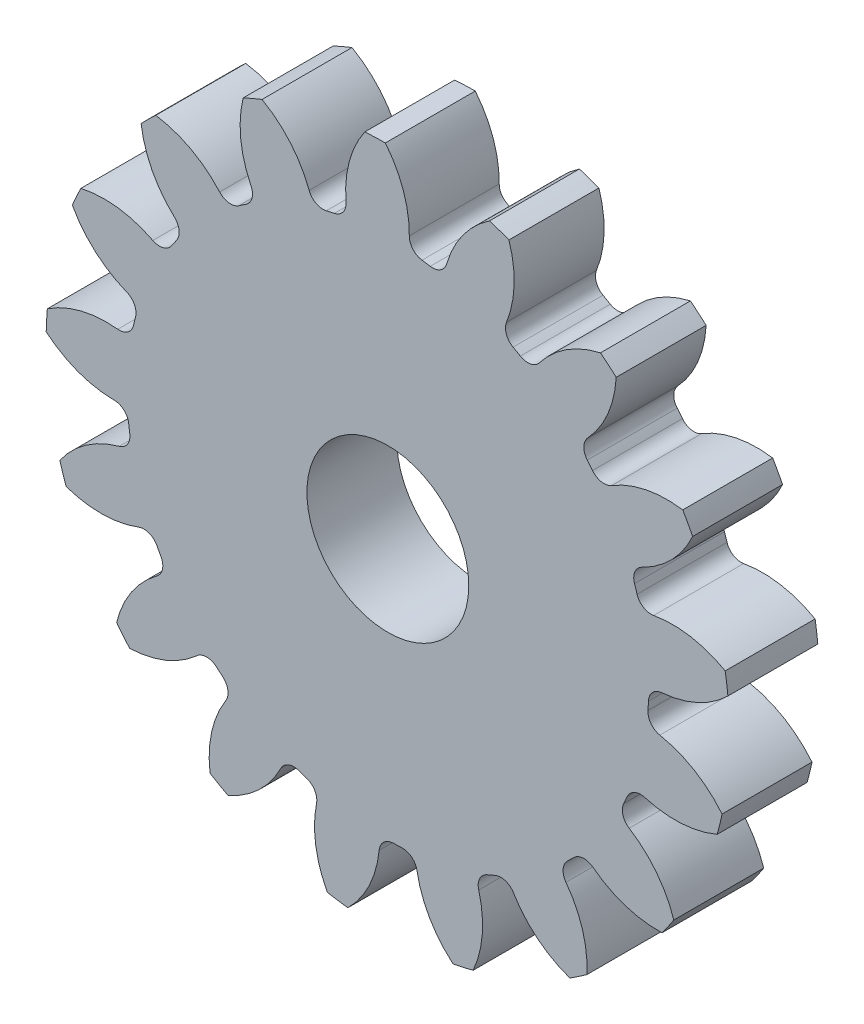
ISO-10303-21;
HEADER;
FILE_DESCRIPTION(('STEP AP214'),'2;1');
FILE_NAME('part.step','',(''),(''),'','','');
FILE_SCHEMA(('AUTOMOTIVE_DESIGN { 1 0 10303 214 1 1 1 1 }'));
ENDSEC;
DATA;
#1=APPLICATION_CONTEXT('core data for automotive mechanical design processes');
#2=APPLICATION_PROTOCOL_DEFINITION('international standard','automotive_design',2000,#1);
#3=PRODUCT_CONTEXT('',#1,'mechanical');
#4=PRODUCT('Part','Part','',(#3));
#5=PRODUCT_RELATED_PRODUCT_CATEGORY('part','',(#4));
#6=PRODUCT_DEFINITION_FORMATION('','',#4);
#7=PRODUCT_DEFINITION_CONTEXT('part definition',#1,'design');
#8=PRODUCT_DEFINITION('design','',#6,#7);
#9=PRODUCT_DEFINITION_SHAPE('','',#8);
#10=(LENGTH_UNIT() NAMED_UNIT(*) SI_UNIT(.MILLI.,.METRE.));
#11=(NAMED_UNIT(*) PLANE_ANGLE_UNIT() SI_UNIT($,.RADIAN.));
#12=(NAMED_UNIT(*) SI_UNIT($,.STERADIAN.) SOLID_ANGLE_UNIT());
#13=UNCERTAINTY_MEASURE_WITH_UNIT(LENGTH_MEASURE(1.E-05),#10,'distance_accuracy_value','');
#14=(GEOMETRIC_REPRESENTATION_CONTEXT(3) GLOBAL_UNCERTAINTY_ASSIGNED_CONTEXT((#13)) GLOBAL_UNIT_ASSIGNED_CONTEXT((#10,
#11,#12)) REPRESENTATION_CONTEXT('',''));
#15=CARTESIAN_POINT('',(0.,0.,0.));
#16=DIRECTION('',(0.,0.,1.));
#17=DIRECTION('',(1.,0.,0.));
#18=AXIS2_PLACEMENT_3D('',#15,#16,#17);
#19=CARTESIAN_POINT('',(0.,0.,127.));
#20=DIRECTION('',(0.,0.,-1.));
#21=DIRECTION('',(-1.,0.,0.));
#22=AXIS2_PLACEMENT_3D('',#19,#20,#21);
#23=CYLINDRICAL_SURFACE('',#22,482.6);
#24=DIRECTION('',(0.,0.,-1.));
#25=VECTOR('',#24,1.);
#26=CARTESIAN_POINT('',(476.438680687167,76.869652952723,63.5));
#27=LINE('',#26,#25);
#28=CARTESIAN_POINT('',(476.438680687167,76.869652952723,127.));
#29=VERTEX_POINT('',#28);
#30=CARTESIAN_POINT('',(476.438680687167,76.869652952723,0.));
#31=VERTEX_POINT('',#30);
#32=EDGE_CURVE('E708',#29,#31,#27,.T.);
#33=ORIENTED_EDGE('',*,*,#32,.F.);
#34=CARTESIAN_POINT('',(0.,0.,127.));
#35=DIRECTION('',(0.,0.,1.));
#36=DIRECTION('',(1.,0.,0.));
#37=AXIS2_PLACEMENT_3D('',#34,#35,#36);
#38=CIRCLE('',#37,482.6);
#39=CARTESIAN_POINT('',(480.20735760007,47.9963926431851,127.));
#40=VERTEX_POINT('',#39);
#41=EDGE_CURVE('E1315',#40,#29,#38,.T.);
#42=ORIENTED_EDGE('',*,*,#41,.F.);
#43=DIRECTION('',(0.,0.,-1.));
#44=VECTOR('',#43,1.);
#45=CARTESIAN_POINT('',(480.20735760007,47.9963926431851,63.5));
#46=LINE('',#45,#44);
#47=CARTESIAN_POINT('',(480.20735760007,47.9963926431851,0.));
#48=VERTEX_POINT('',#47);
#49=EDGE_CURVE('E1309',#48,#40,#46,.F.);
#50=ORIENTED_EDGE('',*,*,#49,.F.);
#51=CARTESIAN_POINT('',(0.,0.,0.));
#52=DIRECTION('',(0.,0.,1.));
#53=DIRECTION('',(1.,0.,0.));
#54=AXIS2_PLACEMENT_3D('',#51,#52,#53);
#55=CIRCLE('',#54,482.6);
#56=EDGE_CURVE('E1320',#48,#31,#55,.T.);
#57=ORIENTED_EDGE('',*,*,#56,.T.);
#58=EDGE_LOOP('',(#33,#42,#50,#57));
#59=FACE_BOUND('',#58,.T.);
#60=ADVANCED_FACE('F33',(#59),#23,.T.);
#61=DIRECTION('',(0.,0.,-1.));
#62=VECTOR('',#61,1.);
#63=CARTESIAN_POINT('',(430.441728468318,218.226209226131,63.5));
#64=LINE('',#63,#62);
#65=CARTESIAN_POINT('',(430.441728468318,218.226209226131,0.));
#66=VERTEX_POINT('',#65);
#67=CARTESIAN_POINT('',(430.441728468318,218.226209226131,127.));
#68=VERTEX_POINT('',#67);
#69=EDGE_CURVE('E679',#66,#68,#64,.F.);
#70=ORIENTED_EDGE('',*,*,#69,.F.);
#71=CARTESIAN_POINT('',(416.497317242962,243.788319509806,0.));
#72=VERTEX_POINT('',#71);
#73=EDGE_CURVE('E1323',#66,#72,#55,.T.);
#74=ORIENTED_EDGE('',*,*,#73,.T.);
#75=DIRECTION('',(0.,0.,-1.));
#76=VECTOR('',#75,1.);
#77=CARTESIAN_POINT('',(416.497317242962,243.788319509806,63.5));
#78=LINE('',#77,#76);
#79=CARTESIAN_POINT('',(416.497317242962,243.788319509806,127.));
#80=VERTEX_POINT('',#79);
#81=EDGE_CURVE('E741',#80,#72,#78,.T.);
#82=ORIENTED_EDGE('',*,*,#81,.F.);
#83=EDGE_CURVE('E1318',#68,#80,#38,.T.);
#84=ORIENTED_EDGE('',*,*,#83,.F.);
#85=EDGE_LOOP('',(#70,#74,#82,#84));
#86=FACE_BOUND('',#85,.T.);
#87=ADVANCED_FACE('F1516',(#86),#23,.T.);
#88=CARTESIAN_POINT('',(0.,0.,127.));
#89=DIRECTION('',(0.,0.,1.));
#90=DIRECTION('',(1.,0.,0.));
#91=AXIS2_PLACEMENT_3D('',#88,#89,#90);
#92=PLANE('',#91);
#93=CARTESIAN_POINT('',(0.,0.,127.000000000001));
#94=DIRECTION('',(0.,0.,1.));
#95=DIRECTION('',(1.,0.,0.));
#96=AXIS2_PLACEMENT_3D('',#93,#94,#95);
#97=CIRCLE('',#96,114.3);
#98=CARTESIAN_POINT('',(114.3,0.,127.000000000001));
#99=VERTEX_POINT('',#98);
#100=EDGE_CURVE('E696',#99,#99,#97,.T.);
#101=ORIENTED_EDGE('',*,*,#100,.F.);
#102=EDGE_LOOP('',(#101));
#103=FACE_BOUND('',#102,.T.);
#104=ORIENTED_EDGE('',*,*,#41,.T.);
#105=CARTESIAN_POINT('',(402.169526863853,-53.8540603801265,127.));
#106=DIRECTION('',(0.,0.,-1.));
#107=DIRECTION('',(0.932472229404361,0.361241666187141,0.));
#108=AXIS2_PLACEMENT_3D('',#105,#106,#107);
#109=CIRCLE('',#108,150.348250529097);
#110=CARTESIAN_POINT('',(375.435144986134,94.0981929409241,127.));
#111=VERTEX_POINT('',#110);
#112=EDGE_CURVE('E688',#111,#29,#109,.T.);
#113=ORIENTED_EDGE('',*,*,#112,.F.);
#114=CARTESIAN_POINT('',(371.758684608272,114.444300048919,127.));
#115=DIRECTION('',(0.,0.,1.));
#116=DIRECTION('',(-0.932472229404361,-0.361241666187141,0.));
#117=AXIS2_PLACEMENT_3D('',#114,#115,#116);
#118=CIRCLE('',#117,20.6756);
#119=CARTESIAN_POINT('',(351.998232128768,108.361130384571,127.));
#120=VERTEX_POINT('',#119);
#121=EDGE_CURVE('E686',#120,#111,#118,.T.);
#122=ORIENTED_EDGE('',*,*,#121,.F.);
#123=CARTESIAN_POINT('',(0.,0.,127.));
#124=DIRECTION('',(0.,0.,-1.));
#125=DIRECTION('',(0.932472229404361,0.361241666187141,0.));
#126=AXIS2_PLACEMENT_3D('',#123,#124,#125);
#127=CIRCLE('',#126,368.3);
#128=CARTESIAN_POINT('',(348.362630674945,119.533959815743,127.));
#129=VERTEX_POINT('',#128);
#130=EDGE_CURVE('E671',#129,#120,#127,.T.);
#131=ORIENTED_EDGE('',*,*,#130,.F.);
#132=CARTESIAN_POINT('',(367.918988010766,126.244349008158,127.));
#133=DIRECTION('',(0.,0.,1.));
#134=DIRECTION('',(-0.932472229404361,-0.361241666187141,0.));
#135=AXIS2_PLACEMENT_3D('',#132,#133,#134);
#136=CIRCLE('',#135,20.6756);
#137=CARTESIAN_POINT('',(358.918103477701,144.857906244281,127.));
#138=VERTEX_POINT('',#137);
#139=EDGE_CURVE('E663',#138,#129,#136,.T.);
#140=ORIENTED_EDGE('',*,*,#139,.F.);
#141=CARTESIAN_POINT('',(293.465722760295,280.211451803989,127.));
#142=DIRECTION('',(0.,0.,-1.));
#143=DIRECTION('',(-0.932472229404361,-0.361241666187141,0.));
#144=AXIS2_PLACEMENT_3D('',#141,#142,#143);
#145=CIRCLE('',#144,150.348250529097);
#146=EDGE_CURVE('E693',#68,#138,#145,.T.);
#147=ORIENTED_EDGE('',*,*,#146,.F.);
#148=ORIENTED_EDGE('',*,*,#83,.T.);
#149=CARTESIAN_POINT('',(394.466245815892,95.0629742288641,127.));
#150=DIRECTION('',(0.,0.,-1.));
#151=DIRECTION('',(0.739008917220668,0.673695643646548,0.));
#152=AXIS2_PLACEMENT_3D('',#149,#150,#151);
#153=CIRCLE('',#152,150.348250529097);
#154=CARTESIAN_POINT('',(316.090658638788,223.366769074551,127.));
#155=VERTEX_POINT('',#154);
#156=EDGE_CURVE('E717',#155,#80,#153,.T.);
#157=ORIENTED_EDGE('',*,*,#156,.F.);
#158=CARTESIAN_POINT('',(305.312599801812,241.010858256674,127.));
#159=DIRECTION('',(0.,0.,1.));
#160=DIRECTION('',(-0.739008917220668,-0.673695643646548,0.));
#161=AXIS2_PLACEMENT_3D('',#158,#159,#160);
#162=CIRCLE('',#161,20.6756);
#163=CARTESIAN_POINT('',(289.084020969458,228.200172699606,127.));
#164=VERTEX_POINT('',#163);
#165=EDGE_CURVE('E715',#164,#155,#162,.T.);
#166=ORIENTED_EDGE('',*,*,#165,.F.);
#167=CARTESIAN_POINT('',(0.,0.,127.));
#168=DIRECTION('',(0.,0.,-1.));
#169=DIRECTION('',(0.739008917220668,0.673695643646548,0.));
#170=AXIS2_PLACEMENT_3D('',#167,#168,#169);
#171=CIRCLE('',#170,368.3);
#172=CARTESIAN_POINT('',(281.657832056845,237.305195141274,127.));
#173=VERTEX_POINT('',#172);
#174=EDGE_CURVE('E712',#173,#164,#171,.T.);
#175=ORIENTED_EDGE('',*,*,#174,.F.);
#176=CARTESIAN_POINT('',(297.469520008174,250.627017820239,127.));
#177=DIRECTION('',(0.,0.,1.));
#178=DIRECTION('',(-0.739008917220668,-0.673695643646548,0.));
#179=AXIS2_PLACEMENT_3D('',#176,#177,#178);
#180=CIRCLE('',#179,20.6756);
#181=CARTESIAN_POINT('',(282.352452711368,264.73214850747,127.));
#182=VERTEX_POINT('',#181);
#183=EDGE_CURVE('E710',#182,#173,#180,.T.);
#184=ORIENTED_EDGE('',*,*,#183,.F.);
#185=CARTESIAN_POINT('',(172.424585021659,367.301443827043,127.));
#186=DIRECTION('',(0.,0.,-1.));
#187=DIRECTION('',(-0.739008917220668,-0.673695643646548,0.));
#188=AXIS2_PLACEMENT_3D('',#185,#186,#187);
#189=CIRCLE('',#188,150.348250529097);
#190=CARTESIAN_POINT('',(322.542558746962,358.983367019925,127.));
#191=VERTEX_POINT('',#190);
#192=EDGE_CURVE('E720',#191,#182,#189,.T.);
#193=ORIENTED_EDGE('',*,*,#192,.F.);
#194=CARTESIAN_POINT('',(300.30568321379,377.782022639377,127.));
#195=VERTEX_POINT('',#194);
#196=EDGE_CURVE('E1365',#191,#195,#38,.T.);
#197=ORIENTED_EDGE('',*,*,#196,.T.);
#198=CARTESIAN_POINT('',(333.48811245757,231.141227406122,127.));
#199=DIRECTION('',(0.,0.,-1.));
#200=DIRECTION('',(0.445738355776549,0.895163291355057,0.));
#201=AXIS2_PLACEMENT_3D('',#198,#199,#200);
#202=CIRCLE('',#201,150.348250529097);
#203=CARTESIAN_POINT('',(214.05637732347,322.468425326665,127.));
#204=VERTEX_POINT('',#203);
#205=EDGE_CURVE('E752',#204,#195,#202,.T.);
#206=ORIENTED_EDGE('',*,*,#205,.F.);
#207=CARTESIAN_POINT('',(197.632356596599,335.027564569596,127.));
#208=DIRECTION('',(0.,0.,1.));
#209=DIRECTION('',(-0.445738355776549,-0.895163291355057,0.));
#210=AXIS2_PLACEMENT_3D('',#207,#208,#209);
#211=CIRCLE('',#210,20.6756);
#212=CARTESIAN_POINT('',(187.127410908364,317.21951719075,127.));
#213=VERTEX_POINT('',#212);
#214=EDGE_CURVE('E750',#213,#204,#211,.T.);
#215=ORIENTED_EDGE('',*,*,#214,.F.);
#216=CARTESIAN_POINT('',(0.,0.,127.));
#217=DIRECTION('',(0.,0.,-1.));
#218=DIRECTION('',(0.445738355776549,0.895163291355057,0.));
#219=AXIS2_PLACEMENT_3D('',#216,#217,#218);
#220=CIRCLE('',#219,368.3);
#221=CARTESIAN_POINT('',(176.913582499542,323.027048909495,127.));
#222=VERTEX_POINT('',#221);
#223=EDGE_CURVE('E747',#222,#213,#220,.T.);
#224=ORIENTED_EDGE('',*,*,#223,.F.);
#225=CARTESIAN_POINT('',(186.845144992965,341.161119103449,127.));
#226=DIRECTION('',(0.,0.,1.));
#227=DIRECTION('',(-0.445738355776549,-0.895163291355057,0.));
#228=AXIS2_PLACEMENT_3D('',#225,#226,#227);
#229=CIRCLE('',#228,20.6756);
#230=CARTESIAN_POINT('',(167.653538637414,348.85284718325,127.));
#231=VERTEX_POINT('',#230);
#232=EDGE_CURVE('E745',#231,#222,#229,.T.);
#233=ORIENTED_EDGE('',*,*,#232,.F.);
#234=CARTESIAN_POINT('',(28.0965516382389,404.785340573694,127.));
#235=DIRECTION('',(0.,0.,-1.));
#236=DIRECTION('',(-0.445738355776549,-0.895163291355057,0.));
#237=AXIS2_PLACEMENT_3D('',#234,#235,#236);
#238=CIRCLE('',#237,150.348250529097);
#239=CARTESIAN_POINT('',(171.082229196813,451.257831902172,127.));
#240=VERTEX_POINT('',#239);
#241=EDGE_CURVE('E755',#240,#231,#238,.T.);
#242=ORIENTED_EDGE('',*,*,#241,.F.);
#243=CARTESIAN_POINT('',(143.556102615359,460.754170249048,127.));
#244=VERTEX_POINT('',#243);
#245=EDGE_CURVE('E1498',#240,#244,#38,.T.);
#246=ORIENTED_EDGE('',*,*,#245,.T.);
#247=CARTESIAN_POINT('',(227.47056159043,336.002577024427,127.));
#248=DIRECTION('',(0.,0.,-1.));
#249=DIRECTION('',(0.092268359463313,0.995734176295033,0.));
#250=AXIS2_PLACEMENT_3D('',#247,#248,#249);
#251=CIRCLE('',#250,150.348250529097);
#252=CARTESIAN_POINT('',(83.1125961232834,378.018933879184,127.));
#253=VERTEX_POINT('',#252);
#254=EDGE_CURVE('E790',#253,#244,#251,.T.);
#255=ORIENTED_EDGE('',*,*,#254,.F.);
#256=CARTESIAN_POINT('',(63.2607685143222,383.796941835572,127.));
#257=DIRECTION('',(0.,0.,1.));
#258=DIRECTION('',(-0.092268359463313,-0.995734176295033,0.));
#259=AXIS2_PLACEMENT_3D('',#256,#257,#258);
#260=CIRCLE('',#259,20.6756);
#261=CARTESIAN_POINT('',(59.8982070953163,363.396608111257,127.));
#262=VERTEX_POINT('',#261);
#263=EDGE_CURVE('E788',#262,#253,#260,.T.);
#264=ORIENTED_EDGE('',*,*,#263,.F.);
#265=CARTESIAN_POINT('',(0.,0.,127.));
#266=DIRECTION('',(0.,0.,-1.));
#267=DIRECTION('',(0.092268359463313,0.995734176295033,0.));
#268=AXIS2_PLACEMENT_3D('',#265,#266,#267);
#269=CIRCLE('',#268,368.3);
#270=CARTESIAN_POINT('',(48.2761733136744,365.12230976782,127.));
#271=VERTEX_POINT('',#270);
#272=EDGE_CURVE('E785',#271,#262,#269,.T.);
#273=ORIENTED_EDGE('',*,*,#272,.F.);
#274=CARTESIAN_POINT('',(50.986297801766,385.619520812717,127.));
#275=DIRECTION('',(0.,0.,1.));
#276=DIRECTION('',(-0.092268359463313,-0.995734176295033,0.));
#277=AXIS2_PLACEMENT_3D('',#274,#275,#276);
#278=CIRCLE('',#277,20.6756);
#279=CARTESIAN_POINT('',(30.3120851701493,385.859035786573,127.));
#280=VERTEX_POINT('',#279);
#281=EDGE_CURVE('E783',#280,#271,#278,.T.);
#282=ORIENTED_EDGE('',*,*,#281,.F.);
#283=CARTESIAN_POINT('',(-120.026076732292,387.600734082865,127.));
#284=DIRECTION('',(0.,0.,-1.));
#285=DIRECTION('',(-0.092268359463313,-0.995734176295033,0.));
#286=AXIS2_PLACEMENT_3D('',#283,#284,#285);
#287=CIRCLE('',#286,150.348250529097);
#288=CARTESIAN_POINT('',(-3.48370340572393,482.587426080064,127.));
#289=VERTEX_POINT('',#288);
#290=EDGE_CURVE('E793',#289,#280,#287,.T.);
#291=ORIENTED_EDGE('',*,*,#290,.F.);
#292=CARTESIAN_POINT('',(-32.5815251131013,481.49891403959,127.));
#293=VERTEX_POINT('',#292);
#294=EDGE_CURVE('E1494',#289,#293,#38,.T.);
#295=ORIENTED_EDGE('',*,*,#294,.T.);
#296=CARTESIAN_POINT('',(90.7318509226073,395.484916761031,127.));
#297=DIRECTION('',(0.,0.,-1.));
#298=DIRECTION('',(-0.273662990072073,0.961825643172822,0.));
#299=AXIS2_PLACEMENT_3D('',#296,#297,#298);
#300=CIRCLE('',#299,150.348250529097);
#301=CARTESIAN_POINT('',(-59.0560017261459,382.515890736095,127.));
#302=VERTEX_POINT('',#301);
#303=EDGE_CURVE('E828',#302,#293,#300,.T.);
#304=ORIENTED_EDGE('',*,*,#303,.F.);
#305=CARTESIAN_POINT('',(-79.6545368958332,380.732415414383,127.));
#306=DIRECTION('',(0.,0.,1.));
#307=DIRECTION('',(0.273662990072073,-0.961825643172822,0.));
#308=AXIS2_PLACEMENT_3D('',#305,#306,#307);
#309=CIRCLE('',#308,20.6756);
#310=CARTESIAN_POINT('',(-75.4205814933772,360.49497345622,127.));
#311=VERTEX_POINT('',#310);
#312=EDGE_CURVE('E826',#311,#302,#309,.T.);
#313=ORIENTED_EDGE('',*,*,#312,.F.);
#314=CARTESIAN_POINT('',(0.,0.,127.));
#315=DIRECTION('',(0.,0.,-1.));
#316=DIRECTION('',(-0.273662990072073,0.961825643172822,0.));
#317=AXIS2_PLACEMENT_3D('',#314,#315,#316);
#318=CIRCLE('',#317,368.3);
#319=CARTESIAN_POINT('',(-86.8812005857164,357.905779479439,127.));
#320=VERTEX_POINT('',#319);
#321=EDGE_CURVE('E823',#320,#311,#318,.T.);
#322=ORIENTED_EDGE('',*,*,#321,.F.);
#323=CARTESIAN_POINT('',(-91.7585314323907,377.997869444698,127.));
#324=DIRECTION('',(0.,0.,1.));
#325=DIRECTION('',(0.273662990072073,-0.961825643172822,0.));
#326=AXIS2_PLACEMENT_3D('',#323,#324,#325);
#327=CIRCLE('',#326,20.6756);
#328=CARTESIAN_POINT('',(-111.123183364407,370.752823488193,127.));
#329=VERTEX_POINT('',#328);
#330=EDGE_CURVE('E821',#329,#320,#327,.T.);
#331=ORIENTED_EDGE('',*,*,#330,.F.);
#332=CARTESIAN_POINT('',(-251.938518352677,318.068500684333,127.));
#333=DIRECTION('',(0.,0.,-1.));
#334=DIRECTION('',(0.273662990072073,-0.961825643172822,0.));
#335=AXIS2_PLACEMENT_3D('',#332,#333,#334);
#336=CIRCLE('',#335,150.348250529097);
#337=CARTESIAN_POINT('',(-177.579142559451,448.740914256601,127.));
#338=VERTEX_POINT('',#337);
#339=EDGE_CURVE('E831',#338,#329,#336,.T.);
#340=ORIENTED_EDGE('',*,*,#339,.F.);
#341=CARTESIAN_POINT('',(-204.318837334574,437.214561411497,127.));
#342=VERTEX_POINT('',#341);
#343=EDGE_CURVE('E1490',#338,#342,#38,.T.);
#344=ORIENTED_EDGE('',*,*,#343,.T.);
#345=CARTESIAN_POINT('',(-58.2606989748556,401.554827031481,127.));
#346=DIRECTION('',(0.,0.,-1.));
#347=DIRECTION('',(-0.602634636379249,0.798017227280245,0.));
#348=AXIS2_PLACEMENT_3D('',#345,#346,#347);
#349=CIRCLE('',#348,150.348250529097);
#350=CARTESIAN_POINT('',(-193.248759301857,335.351956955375,127.));
#351=VERTEX_POINT('',#350);
#352=EDGE_CURVE('E866',#351,#342,#349,.T.);
#353=ORIENTED_EDGE('',*,*,#352,.F.);
#354=CARTESIAN_POINT('',(-211.812055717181,326.247866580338,127.));
#355=DIRECTION('',(0.,0.,1.));
#356=DIRECTION('',(0.602634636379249,-0.798017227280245,0.));
#357=AXIS2_PLACEMENT_3D('',#354,#355,#356);
#358=CIRCLE('',#357,20.6756);
#359=CARTESIAN_POINT('',(-200.553402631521,308.906495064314,127.));
#360=VERTEX_POINT('',#359);
#361=EDGE_CURVE('E864',#360,#351,#358,.T.);
#362=ORIENTED_EDGE('',*,*,#361,.F.);
#363=CARTESIAN_POINT('',(0.,0.,127.));
#364=DIRECTION('',(0.,0.,-1.));
#365=DIRECTION('',(-0.602634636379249,0.798017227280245,0.));
#366=AXIS2_PLACEMENT_3D('',#363,#364,#365);
#367=CIRCLE('',#366,368.3);
#368=CARTESIAN_POINT('',(-210.304786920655,302.352090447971,127.));
#369=VERTEX_POINT('',#368);
#370=EDGE_CURVE('E861',#369,#360,#367,.T.);
#371=ORIENTED_EDGE('',*,*,#370,.F.);
#372=CARTESIAN_POINT('',(-222.110862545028,319.325511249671,127.));
#373=DIRECTION('',(0.,0.,1.));
#374=DIRECTION('',(0.602634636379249,-0.798017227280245,0.));
#375=AXIS2_PLACEMENT_3D('',#372,#373,#374);
#376=CIRCLE('',#375,20.6756);
#377=CARTESIAN_POINT('',(-237.550650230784,305.574387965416,127.));
#378=VERTEX_POINT('',#377);
#379=EDGE_CURVE('E859',#378,#369,#376,.T.);
#380=ORIENTED_EDGE('',*,*,#379,.F.);
#381=CARTESIAN_POINT('',(-349.825267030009,205.579353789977,127.));
#382=DIRECTION('',(0.,0.,-1.));
#383=DIRECTION('',(0.602634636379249,-0.798017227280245,0.));
#384=AXIS2_PLACEMENT_3D('',#381,#382,#383);
#385=CIRCLE('',#384,150.348250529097);
#386=CARTESIAN_POINT('',(-327.691534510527,354.289455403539,127.));
#387=VERTEX_POINT('',#386);
#388=EDGE_CURVE('E869',#387,#378,#385,.T.);
#389=ORIENTED_EDGE('',*,*,#388,.F.);
#390=CARTESIAN_POINT('',(-348.461758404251,333.881959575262,127.));
#391=VERTEX_POINT('',#390);
#392=EDGE_CURVE('E1486',#387,#391,#38,.T.);
#393=ORIENTED_EDGE('',*,*,#392,.T.);
#394=CARTESIAN_POINT('',(-199.384818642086,353.392532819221,127.));
#395=DIRECTION('',(0.,0.,-1.));
#396=DIRECTION('',(-0.85021713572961,0.526432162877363,0.));
#397=AXIS2_PLACEMENT_3D('',#394,#395,#396);
#398=CIRCLE('',#397,150.348250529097);
#399=CARTESIAN_POINT('',(-301.342201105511,242.896883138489,127.));
#400=VERTEX_POINT('',#399);
#401=EDGE_CURVE('E904',#400,#391,#398,.T.);
#402=ORIENTED_EDGE('',*,*,#401,.F.);
#403=CARTESIAN_POINT('',(-315.363182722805,227.701735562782,127.));
#404=DIRECTION('',(0.,0.,1.));
#405=DIRECTION('',(0.85021713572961,-0.526432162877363,0.));
#406=AXIS2_PLACEMENT_3D('',#403,#404,#405);
#407=CIRCLE('',#406,20.6756);
#408=CARTESIAN_POINT('',(-298.60037543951,215.598482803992,127.));
#409=VERTEX_POINT('',#408);
#410=EDGE_CURVE('E902',#409,#400,#407,.T.);
#411=ORIENTED_EDGE('',*,*,#410,.F.);
#412=CARTESIAN_POINT('',(0.,0.,127.));
#413=DIRECTION('',(0.,0.,-1.));
#414=DIRECTION('',(-0.85021713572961,0.526432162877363,0.));
#415=AXIS2_PLACEMENT_3D('',#412,#413,#414);
#416=CIRCLE('',#415,368.3);
#417=CARTESIAN_POINT('',(-305.325546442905,205.964076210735,127.));
#418=VERTEX_POINT('',#417);
#419=EDGE_CURVE('E899',#418,#409,#416,.T.);
#420=ORIENTED_EDGE('',*,*,#419,.F.);
#421=CARTESIAN_POINT('',(-322.465890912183,217.526473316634,127.));
#422=DIRECTION('',(0.,0.,1.));
#423=DIRECTION('',(0.85021713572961,-0.526432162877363,0.));
#424=AXIS2_PLACEMENT_3D('',#421,#422,#423);
#425=CIRCLE('',#424,20.6756);
#426=CARTESIAN_POINT('',(-331.8955854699,199.126438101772,127.));
#427=VERTEX_POINT('',#426);
#428=EDGE_CURVE('E897',#427,#418,#425,.T.);
#429=ORIENTED_EDGE('',*,*,#428,.F.);
#430=CARTESIAN_POINT('',(-400.466174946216,65.3255760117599,127.));
#431=DIRECTION('',(0.,0.,-1.));
#432=DIRECTION('',(0.85021713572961,-0.526432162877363,0.));
#433=AXIS2_PLACEMENT_3D('',#430,#431,#432);
#434=CIRCLE('',#433,150.348250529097);
#435=CARTESIAN_POINT('',(-433.547368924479,211.989242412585,127.));
#436=VERTEX_POINT('',#435);
#437=EDGE_CURVE('E907',#436,#427,#434,.T.);
#438=ORIENTED_EDGE('',*,*,#437,.F.);
#439=CARTESIAN_POINT('',(-445.542988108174,185.456748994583,127.));
#440=VERTEX_POINT('',#439);
#441=EDGE_CURVE('E1482',#436,#440,#38,.T.);
#442=ORIENTED_EDGE('',*,*,#441,.T.);
#443=CARTESIAN_POINT('',(-313.580913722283,257.5026188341,127.));
#444=DIRECTION('',(0.,0.,-1.));
#445=DIRECTION('',(-0.9829730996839,0.183749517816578,0.));
#446=AXIS2_PLACEMENT_3D('',#443,#444,#445);
#447=CIRCLE('',#446,150.348250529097);
#448=CARTESIAN_POINT('',(-368.737708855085,117.637239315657,127.));
#449=VERTEX_POINT('',#448);
#450=EDGE_CURVE('E942',#449,#440,#447,.T.);
#451=ORIENTED_EDGE('',*,*,#450,.F.);
#452=CARTESIAN_POINT('',(-376.322764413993,98.4032234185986,127.));
#453=DIRECTION('',(0.,0.,1.));
#454=DIRECTION('',(0.9829730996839,-0.183749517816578,0.));
#455=AXIS2_PLACEMENT_3D('',#452,#453,#454);
#456=CIRCLE('',#455,20.6756);
#457=CARTESIAN_POINT('',(-356.319712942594,93.172700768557,127.));
#458=VERTEX_POINT('',#457);
#459=EDGE_CURVE('E940',#458,#449,#456,.T.);
#460=ORIENTED_EDGE('',*,*,#459,.F.);
#461=CARTESIAN_POINT('',(0.,0.,127.));
#462=DIRECTION('',(0.,0.,-1.));
#463=DIRECTION('',(-0.9829730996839,0.183749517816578,0.));
#464=AXIS2_PLACEMENT_3D('',#461,#462,#463);
#465=CIRCLE('',#464,368.3);
#466=CARTESIAN_POINT('',(-359.110399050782,81.7594721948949,127.));
#467=VERTEX_POINT('',#466);
#468=EDGE_CURVE('E937',#467,#458,#465,.T.);
#469=ORIENTED_EDGE('',*,*,#468,.F.);
#470=CARTESIAN_POINT('',(-379.270113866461,86.3492798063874,127.));
#471=DIRECTION('',(0.,0.,1.));
#472=DIRECTION('',(0.9829730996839,-0.183749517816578,0.));
#473=AXIS2_PLACEMENT_3D('',#470,#471,#472);
#474=CIRCLE('',#473,20.6756);
#475=CARTESIAN_POINT('',(-381.416182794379,65.7853593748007,127.));
#476=VERTEX_POINT('',#475);
#477=EDGE_CURVE('E935',#476,#467,#474,.T.);
#478=ORIENTED_EDGE('',*,*,#477,.F.);
#479=CARTESIAN_POINT('',(-397.021906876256,-83.7507827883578,127.));
#480=DIRECTION('',(0.,0.,-1.));
#481=DIRECTION('',(0.9829730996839,-0.183749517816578,0.));
#482=AXIS2_PLACEMENT_3D('',#479,#480,#481);
#483=CIRCLE('',#482,150.348250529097);
#484=CARTESIAN_POINT('',(-480.850228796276,41.0587075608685,127.));
#485=VERTEX_POINT('',#484);
#486=EDGE_CURVE('E945',#485,#476,#483,.T.);
#487=ORIENTED_EDGE('',*,*,#486,.F.);
#488=CARTESIAN_POINT('',(-482.451168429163,11.9845768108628,127.));
#489=VERTEX_POINT('',#488);
#490=EDGE_CURVE('E1478',#485,#489,#38,.T.);
#491=ORIENTED_EDGE('',*,*,#490,.T.);
#492=CARTESIAN_POINT('',(-385.426168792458,126.835549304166,127.));
#493=DIRECTION('',(0.,0.,-1.));
#494=DIRECTION('',(-0.982973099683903,-0.183749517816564,0.));
#495=AXIS2_PLACEMENT_3D('',#492,#493,#494);
#496=CIRCLE('',#495,150.348250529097);
#497=CARTESIAN_POINT('',(-386.3331457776,-23.5099655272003,127.));
#498=VERTEX_POINT('',#497);
#499=EDGE_CURVE('E980',#498,#489,#496,.T.);
#500=ORIENTED_EDGE('',*,*,#499,.F.);
#501=CARTESIAN_POINT('',(-386.457871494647,-44.1851893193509,127.));
#502=DIRECTION('',(0.,0.,1.));
#503=DIRECTION('',(0.982973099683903,0.183749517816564,0.));
#504=AXIS2_PLACEMENT_3D('',#501,#502,#503);
#505=CIRCLE('',#504,20.6756);
#506=CARTESIAN_POINT('',(-365.916098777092,-41.8365707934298,127.));
#507=VERTEX_POINT('',#506);
#508=EDGE_CURVE('E978',#507,#498,#505,.T.);
#509=ORIENTED_EDGE('',*,*,#508,.F.);
#510=CARTESIAN_POINT('',(0.,0.,127.));
#511=DIRECTION('',(0.,0.,-1.));
#512=DIRECTION('',(-0.982973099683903,-0.183749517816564,0.));
#513=AXIS2_PLACEMENT_3D('',#510,#511,#512);
#514=CIRCLE('',#513,368.3);
#515=CARTESIAN_POINT('',(-364.395402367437,-53.4872015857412,127.));
#516=VERTEX_POINT('',#515);
#517=EDGE_CURVE('E975',#516,#507,#514,.T.);
#518=ORIENTED_EDGE('',*,*,#517,.F.);
#519=CARTESIAN_POINT('',(-384.851806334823,-56.4898624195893,127.));
#520=DIRECTION('',(0.,0.,1.));
#521=DIRECTION('',(0.982973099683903,0.183749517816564,0.));
#522=AXIS2_PLACEMENT_3D('',#519,#520,#521);
#523=CIRCLE('',#522,20.6756);
#524=CARTESIAN_POINT('',(-379.424411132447,-76.4403966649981,127.));
#525=VERTEX_POINT('',#524);
#526=EDGE_CURVE('E973',#525,#516,#523,.T.);
#527=ORIENTED_EDGE('',*,*,#526,.F.);
#528=CARTESIAN_POINT('',(-339.957630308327,-221.5161342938,127.));
#529=DIRECTION('',(0.,0.,-1.));
#530=DIRECTION('',(0.982973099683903,0.183749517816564,0.));
#531=AXIS2_PLACEMENT_3D('',#528,#529,#530);
#532=CIRCLE('',#531,150.348250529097);
#533=CARTESIAN_POINT('',(-463.211600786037,-135.417033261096,127.));
#534=VERTEX_POINT('',#533);
#535=EDGE_CURVE('E983',#534,#525,#532,.T.);
#536=ORIENTED_EDGE('',*,*,#535,.F.);
#537=CARTESIAN_POINT('',(-454.201645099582,-163.106178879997,127.));
#538=VERTEX_POINT('',#537);
#539=EDGE_CURVE('E1474',#534,#538,#38,.T.);
#540=ORIENTED_EDGE('',*,*,#539,.T.);
#541=CARTESIAN_POINT('',(-405.217484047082,-20.9613639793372,127.));
#542=DIRECTION('',(0.,0.,-1.));
#543=DIRECTION('',(-0.850217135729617,-0.526432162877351,0.));
#544=AXIS2_PLACEMENT_3D('',#541,#542,#543);
#545=CIRCLE('',#544,150.348250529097);
#546=CARTESIAN_POINT('',(-351.752150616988,-161.482019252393,127.));
#547=VERTEX_POINT('',#546);
#548=EDGE_CURVE('E1018',#547,#538,#545,.T.);
#549=ORIENTED_EDGE('',*,*,#548,.F.);
#550=CARTESIAN_POINT('',(-344.399701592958,-180.806147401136,127.));
#551=DIRECTION('',(0.,0.,1.));
#552=DIRECTION('',(0.850217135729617,0.526432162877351,0.));
#553=AXIS2_PLACEMENT_3D('',#550,#551,#552);
#554=CIRCLE('',#553,20.6756);
#555=CARTESIAN_POINT('',(-326.093487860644,-171.195581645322,127.));
#556=VERTEX_POINT('',#555);
#557=EDGE_CURVE('E1016',#556,#547,#554,.T.);
#558=ORIENTED_EDGE('',*,*,#557,.F.);
#559=CARTESIAN_POINT('',(0.,0.,127.));
#560=DIRECTION('',(0.,0.,-1.));
#561=DIRECTION('',(-0.850217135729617,-0.526432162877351,0.));
#562=AXIS2_PLACEMENT_3D('',#559,#560,#561);
#563=CIRCLE('',#562,368.3);
#564=CARTESIAN_POINT('',(-320.46678740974,-181.510132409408,127.));
#565=VERTEX_POINT('',#564);
#566=EDGE_CURVE('E1013',#565,#556,#563,.T.);
#567=ORIENTED_EDGE('',*,*,#566,.F.);
#568=CARTESIAN_POINT('',(-338.45712982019,-191.699735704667,127.));
#569=DIRECTION('',(0.,0.,1.));
#570=DIRECTION('',(0.850217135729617,0.526432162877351,0.));
#571=AXIS2_PLACEMENT_3D('',#568,#569,#570);
#572=CIRCLE('',#571,20.6756);
#573=CARTESIAN_POINT('',(-326.189270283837,-208.342453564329,127.));
#574=VERTEX_POINT('',#573);
#575=EDGE_CURVE('E1011',#574,#565,#572,.T.);
#576=ORIENTED_EDGE('',*,*,#575,.F.);
#577=CARTESIAN_POINT('',(-236.980191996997,-329.36450439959,127.));
#578=DIRECTION('',(0.,0.,-1.));
#579=DIRECTION('',(0.850217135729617,0.526432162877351,0.));
#580=AXIS2_PLACEMENT_3D('',#577,#578,#579);
#581=CIRCLE('',#580,150.348250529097);
#582=CARTESIAN_POINT('',(-383.013679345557,-293.603953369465,127.));
#583=VERTEX_POINT('',#582);
#584=EDGE_CURVE('E1021',#583,#574,#581,.T.);
#585=ORIENTED_EDGE('',*,*,#584,.F.);
#586=CARTESIAN_POINT('',(-364.609672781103,-316.168541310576,127.));
#587=VERTEX_POINT('',#586);
#588=EDGE_CURVE('E1470',#583,#587,#38,.T.);
#589=ORIENTED_EDGE('',*,*,#588,.T.);
#590=CARTESIAN_POINT('',(-370.281932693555,-165.927328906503,127.));
#591=DIRECTION('',(0.,0.,-1.));
#592=DIRECTION('',(-0.602634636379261,-0.798017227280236,0.));
#593=AXIS2_PLACEMENT_3D('',#590,#591,#592);
#594=CIRCLE('',#593,150.348250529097);
#595=CARTESIAN_POINT('',(-269.665078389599,-277.645031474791,127.));
#596=VERTEX_POINT('',#595);
#597=EDGE_CURVE('E1056',#596,#587,#594,.T.);
#598=ORIENTED_EDGE('',*,*,#597,.F.);
#599=CARTESIAN_POINT('',(-255.828443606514,-293.008233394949,127.));
#600=DIRECTION('',(0.,0.,1.));
#601=DIRECTION('',(0.602634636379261,0.798017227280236,0.));
#602=AXIS2_PLACEMENT_3D('',#599,#600,#601);
#603=CIRCLE('',#602,20.6756);
#604=CARTESIAN_POINT('',(-242.230144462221,-277.433680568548,127.));
#605=VERTEX_POINT('',#604);
#606=EDGE_CURVE('E1054',#605,#596,#603,.T.);
#607=ORIENTED_EDGE('',*,*,#606,.F.);
#608=CARTESIAN_POINT('',(0.,0.,127.));
#609=DIRECTION('',(0.,0.,-1.));
#610=DIRECTION('',(-0.602634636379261,-0.798017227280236,0.));
#611=AXIS2_PLACEMENT_3D('',#608,#609,#610);
#612=CIRCLE('',#611,368.3);
#613=CARTESIAN_POINT('',(-233.257357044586,-285.019114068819,127.));
#614=VERTEX_POINT('',#613);
#615=EDGE_CURVE('E1051',#614,#605,#612,.T.);
#616=ORIENTED_EDGE('',*,*,#615,.F.);
#617=CARTESIAN_POINT('',(-246.351942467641,-301.019497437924,127.));
#618=DIRECTION('',(0.,0.,1.));
#619=DIRECTION('',(0.602634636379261,0.798017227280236,0.));
#620=AXIS2_PLACEMENT_3D('',#617,#618,#619);
#621=CIRCLE('',#620,20.6756);
#622=CARTESIAN_POINT('',(-228.900461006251,-312.106707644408,127.));
#623=VERTEX_POINT('',#622);
#624=EDGE_CURVE('E1049',#623,#614,#621,.T.);
#625=ORIENTED_EDGE('',*,*,#624,.F.);
#626=CARTESIAN_POINT('',(-101.997265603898,-392.730373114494,127.));
#627=DIRECTION('',(0.,0.,-1.));
#628=DIRECTION('',(0.602634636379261,0.798017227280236,0.));
#629=AXIS2_PLACEMENT_3D('',#626,#627,#628);
#630=CIRCLE('',#629,150.348250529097);
#631=CARTESIAN_POINT('',(-251.087638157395,-412.138032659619,127.));
#632=VERTEX_POINT('',#631);
#633=EDGE_CURVE('E1059',#632,#623,#630,.T.);
#634=ORIENTED_EDGE('',*,*,#633,.F.);
#635=CARTESIAN_POINT('',(-225.775143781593,-426.530590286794,127.));
#636=VERTEX_POINT('',#635);
#637=EDGE_CURVE('E1466',#632,#636,#38,.T.);
#638=ORIENTED_EDGE('',*,*,#637,.T.);
#639=CARTESIAN_POINT('',(-285.337754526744,-288.483888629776,127.));
#640=DIRECTION('',(0.,0.,-1.));
#641=DIRECTION('',(-0.273662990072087,-0.961825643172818,0.));
#642=AXIS2_PLACEMENT_3D('',#639,#640,#641);
#643=CIRCLE('',#642,150.348250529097);
#644=CARTESIAN_POINT('',(-151.158243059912,-356.310543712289,127.));
#645=VERTEX_POINT('',#644);
#646=EDGE_CURVE('E1094',#645,#636,#643,.T.);
#647=ORIENTED_EDGE('',*,*,#646,.F.);
#648=CARTESIAN_POINT('',(-132.706136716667,-365.637933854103,127.));
#649=DIRECTION('',(0.,0.,1.));
#650=DIRECTION('',(0.273662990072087,0.961825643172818,0.));
#651=AXIS2_PLACEMENT_3D('',#648,#649,#650);
#652=CIRCLE('',#651,20.6756);
#653=CARTESIAN_POINT('',(-125.65227781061,-346.202823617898,127.));
#654=VERTEX_POINT('',#653);
#655=EDGE_CURVE('E1092',#654,#645,#652,.T.);
#656=ORIENTED_EDGE('',*,*,#655,.F.);
#657=CARTESIAN_POINT('',(0.,0.,127.));
#658=DIRECTION('',(0.,0.,-1.));
#659=DIRECTION('',(-0.273662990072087,-0.961825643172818,0.));
#660=AXIS2_PLACEMENT_3D('',#657,#658,#659);
#661=CIRCLE('',#660,368.3);
#662=CARTESIAN_POINT('',(-114.545228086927,-350.034685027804,127.));
#663=VERTEX_POINT('',#662);
#664=EDGE_CURVE('E1089',#663,#654,#661,.T.);
#665=ORIENTED_EDGE('',*,*,#664,.F.);
#666=CARTESIAN_POINT('',(-120.975560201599,-369.684908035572,127.));
#667=DIRECTION('',(0.,0.,1.));
#668=DIRECTION('',(0.273662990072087,0.961825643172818,0.));
#669=AXIS2_PLACEMENT_3D('',#666,#667,#668);
#670=CIRCLE('',#669,20.6756);
#671=CARTESIAN_POINT('',(-100.697376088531,-373.719221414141,127.));
#672=VERTEX_POINT('',#671);
#673=EDGE_CURVE('E1087',#672,#663,#670,.T.);
#674=ORIENTED_EDGE('',*,*,#673,.F.);
#675=CARTESIAN_POINT('',(46.7609566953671,-403.055828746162,127.));
#676=DIRECTION('',(0.,0.,-1.));
#677=DIRECTION('',(0.273662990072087,0.961825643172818,0.));
#678=AXIS2_PLACEMENT_3D('',#675,#676,#677);
#679=CIRCLE('',#678,150.348250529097);
#680=CARTESIAN_POINT('',(-85.2508201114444,-475.010586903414,127.));
#681=VERTEX_POINT('',#680);
#682=EDGE_CURVE('E1097',#681,#672,#679,.T.);
#683=ORIENTED_EDGE('',*,*,#682,.F.);
#684=CARTESIAN_POINT('',(-56.4484305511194,-479.287319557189,127.));
#685=VERTEX_POINT('',#684);
#686=EDGE_CURVE('E1462',#681,#685,#38,.T.);
#687=ORIENTED_EDGE('',*,*,#686,.T.);
#688=CARTESIAN_POINT('',(-161.857131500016,-372.079100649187,127.));
#689=DIRECTION('',(0.,0.,-1.));
#690=DIRECTION('',(0.0922683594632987,-0.995734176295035,0.));
#691=AXIS2_PLACEMENT_3D('',#688,#689,#690);
#692=CIRCLE('',#691,150.348250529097);
#693=CARTESIAN_POINT('',(-12.2366494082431,-386.854342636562,127.));
#694=VERTEX_POINT('',#693);
#695=EDGE_CURVE('E1132',#694,#685,#692,.T.);
#696=ORIENTED_EDGE('',*,*,#695,.F.);
#697=CARTESIAN_POINT('',(8.33886928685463,-388.886205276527,127.));
#698=DIRECTION('',(0.,0.,1.));
#699=DIRECTION('',(-0.0922683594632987,0.995734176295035,0.));
#700=AXIS2_PLACEMENT_3D('',#697,#698,#699);
#701=CIRCLE('',#700,20.6756);
#702=CARTESIAN_POINT('',(7.89562522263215,-368.21535696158,127.));
#703=VERTEX_POINT('',#702);
#704=EDGE_CURVE('E1130',#703,#694,#701,.T.);
#705=ORIENTED_EDGE('',*,*,#704,.F.);
#706=CARTESIAN_POINT('',(0.,0.,127.));
#707=DIRECTION('',(0.,0.,-1.));
#708=DIRECTION('',(0.0922683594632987,-0.995734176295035,0.));
#709=AXIS2_PLACEMENT_3D('',#706,#707,#708);
#710=CIRCLE('',#709,368.3);
#711=CARTESIAN_POINT('',(19.6368686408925,-367.776132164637,127.));
#712=VERTEX_POINT('',#711);
#713=EDGE_CURVE('E1127',#712,#703,#710,.T.);
#714=ORIENTED_EDGE('',*,*,#713,.F.);
#715=CARTESIAN_POINT('',(20.7392418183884,-388.422323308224,127.));
#716=DIRECTION('',(0.,0.,1.));
#717=DIRECTION('',(-0.0922683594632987,0.995734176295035,0.));
#718=AXIS2_PLACEMENT_3D('',#715,#716,#717);
#719=CIRCLE('',#718,20.6756);
#720=CARTESIAN_POINT('',(41.1054474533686,-384.858883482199,127.));
#721=VERTEX_POINT('',#720);
#722=EDGE_CURVE('E1125',#721,#712,#719,.T.);
#723=ORIENTED_EDGE('',*,*,#722,.F.);
#724=CARTESIAN_POINT('',(189.203852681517,-358.946361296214,127.));
#725=DIRECTION('',(0.,0.,-1.));
#726=DIRECTION('',(-0.0922683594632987,0.995734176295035,0.));
#727=AXIS2_PLACEMENT_3D('',#724,#725,#726);
#728=CIRCLE('',#727,150.348250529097);
#729=CARTESIAN_POINT('',(92.099593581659,-473.730329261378,127.));
#730=VERTEX_POINT('',#729);
#731=EDGE_CURVE('E1135',#730,#721,#728,.T.);
#732=ORIENTED_EDGE('',*,*,#731,.F.);
#733=CARTESIAN_POINT('',(120.501956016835,-467.313640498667,127.));
#734=VERTEX_POINT('',#733);
#735=EDGE_CURVE('E1458',#730,#734,#38,.T.);
#736=ORIENTED_EDGE('',*,*,#735,.T.);
#737=CARTESIAN_POINT('',(-16.516805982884,-405.422968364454,127.));
#738=DIRECTION('',(0.,0.,-1.));
#739=DIRECTION('',(0.445738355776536,-0.895163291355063,0.));
#740=AXIS2_PLACEMENT_3D('',#737,#738,#739);
#741=CIRCLE('',#740,150.348250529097);
#742=CARTESIAN_POINT('',(128.337571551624,-365.151318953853,127.));
#743=VERTEX_POINT('',#742);
#744=EDGE_CURVE('E1170',#743,#734,#741,.T.);
#745=ORIENTED_EDGE('',*,*,#744,.F.);
#746=CARTESIAN_POINT('',(148.257664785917,-359.613239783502,127.));
#747=DIRECTION('',(0.,0.,1.));
#748=DIRECTION('',(-0.445738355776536,0.895163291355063,0.));
#749=AXIS2_PLACEMENT_3D('',#746,#747,#748);
#750=CIRCLE('',#749,20.6756);
#751=CARTESIAN_POINT('',(140.377180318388,-340.498365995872,127.));
#752=VERTEX_POINT('',#751);
#753=EDGE_CURVE('E1168',#752,#743,#750,.T.);
#754=ORIENTED_EDGE('',*,*,#753,.F.);
#755=CARTESIAN_POINT('',(0.,0.,127.));
#756=DIRECTION('',(0.,0.,-1.));
#757=DIRECTION('',(0.445738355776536,-0.895163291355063,0.));
#758=AXIS2_PLACEMENT_3D('',#755,#756,#757);
#759=CIRCLE('',#758,368.3);
#760=CARTESIAN_POINT('',(151.166897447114,-335.847374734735,127.));
#761=VERTEX_POINT('',#760);
#762=EDGE_CURVE('E1165',#761,#752,#759,.T.);
#763=ORIENTED_EDGE('',*,*,#762,.F.);
#764=CARTESIAN_POINT('',(159.653094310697,-354.701151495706,127.));
#765=DIRECTION('',(0.,0.,1.));
#766=DIRECTION('',(-0.445738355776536,0.895163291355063,0.));
#767=AXIS2_PLACEMENT_3D('',#764,#765,#766);
#768=CIRCLE('',#767,20.6756);
#769=CARTESIAN_POINT('',(177.356752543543,-344.021220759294,127.));
#770=VERTEX_POINT('',#769);
#771=EDGE_CURVE('E1163',#770,#761,#768,.T.);
#772=ORIENTED_EDGE('',*,*,#771,.F.);
#773=CARTESIAN_POINT('',(306.093719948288,-266.359198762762,127.));
#774=DIRECTION('',(0.,0.,-1.));
#775=DIRECTION('',(-0.445738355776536,0.895163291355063,0.));
#776=AXIS2_PLACEMENT_3D('',#773,#774,#775);
#777=CIRCLE('',#776,150.348250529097);
#778=CARTESIAN_POINT('',(257.011446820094,-408.470165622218,127.));
#779=VERTEX_POINT('',#778);
#780=EDGE_CURVE('E1173',#779,#770,#777,.T.);
#781=ORIENTED_EDGE('',*,*,#780,.F.);
#782=CARTESIAN_POINT('',(281.177885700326,-392.226664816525,127.));
#783=VERTEX_POINT('',#782);
#784=EDGE_CURVE('E1454',#779,#783,#38,.T.);
#785=ORIENTED_EDGE('',*,*,#784,.T.);
#786=CARTESIAN_POINT('',(131.054205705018,-384.012217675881,127.));
#787=DIRECTION('',(0.,0.,-1.));
#788=DIRECTION('',(0.739008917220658,-0.673695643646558,0.));
#789=AXIS2_PLACEMENT_3D('',#786,#787,#788);
#790=CIRCLE('',#789,150.348250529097);
#791=CARTESIAN_POINT('',(251.57909233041,-294.132586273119,127.));
#792=VERTEX_POINT('',#791);
#793=EDGE_CURVE('E1208',#792,#783,#790,.T.);
#794=ORIENTED_EDGE('',*,*,#793,.F.);
#795=CARTESIAN_POINT('',(268.15344113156,-281.772513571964,127.));
#796=DIRECTION('',(0.,0.,1.));
#797=DIRECTION('',(-0.739008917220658,0.673695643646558,0.));
#798=AXIS2_PLACEMENT_3D('',#795,#796,#797);
#799=CIRCLE('',#798,20.6756);
#800=CARTESIAN_POINT('',(253.900019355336,-266.795183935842,127.));
#801=VERTEX_POINT('',#800);
#802=EDGE_CURVE('E1206',#801,#792,#799,.T.);
#803=ORIENTED_EDGE('',*,*,#802,.F.);
#804=CARTESIAN_POINT('',(0.,0.,127.));
#805=DIRECTION('',(0.,0.,-1.));
#806=DIRECTION('',(0.739008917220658,-0.673695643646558,0.));
#807=AXIS2_PLACEMENT_3D('',#804,#805,#806);
#808=CIRCLE('',#807,368.3);
#809=CARTESIAN_POINT('',(262.280999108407,-258.560568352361,127.));
#810=VERTEX_POINT('',#809);
#811=EDGE_CURVE('E1203',#810,#801,#808,.T.);
#812=ORIENTED_EDGE('',*,*,#811,.F.);
#813=CARTESIAN_POINT('',(277.00491174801,-273.075623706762,127.));
#814=DIRECTION('',(0.,0.,1.));
#815=DIRECTION('',(-0.739008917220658,0.673695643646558,0.));
#816=AXIS2_PLACEMENT_3D('',#813,#814,#815);
#817=CIRCLE('',#816,20.6756);
#818=CARTESIAN_POINT('',(289.65504543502,-256.721585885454,127.));
#819=VERTEX_POINT('',#818);
#820=EDGE_CURVE('E1201',#819,#810,#817,.T.);
#821=ORIENTED_EDGE('',*,*,#820,.F.);
#822=CARTESIAN_POINT('',(381.643934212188,-137.798750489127,127.));
#823=DIRECTION('',(0.,0.,-1.));
#824=DIRECTION('',(-0.739008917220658,0.673695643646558,0.));
#825=AXIS2_PLACEMENT_3D('',#822,#823,#824);
#826=CIRCLE('',#825,150.348250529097);
#827=CARTESIAN_POINT('',(387.212480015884,-288.043842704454,127.));
#828=VERTEX_POINT('',#827);
#829=EDGE_CURVE('E1211',#828,#819,#826,.T.);
#830=ORIENTED_EDGE('',*,*,#829,.F.);
#831=CARTESIAN_POINT('',(403.879183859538,-264.167304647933,127.));
#832=VERTEX_POINT('',#831);
#833=EDGE_CURVE('E1453',#828,#832,#38,.T.);
#834=ORIENTED_EDGE('',*,*,#833,.T.);
#835=CARTESIAN_POINT('',(260.925620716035,-310.738489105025,127.));
#836=DIRECTION('',(0.,0.,-1.));
#837=DIRECTION('',(0.932472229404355,-0.361241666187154,0.));
#838=AXIS2_PLACEMENT_3D('',#835,#836,#837);
#839=CIRCLE('',#838,150.348250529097);
#840=CARTESIAN_POINT('',(340.8434626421,-183.389617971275,127.));
#841=VERTEX_POINT('',#840);
#842=EDGE_CURVE('E1246',#841,#832,#839,.T.);
#843=ORIENTED_EDGE('',*,*,#842,.F.);
#844=CARTESIAN_POINT('',(351.833609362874,-165.876848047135,127.));
#845=DIRECTION('',(0.,0.,1.));
#846=DIRECTION('',(-0.932472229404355,0.361241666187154,0.));
#847=AXIS2_PLACEMENT_3D('',#844,#845,#846);
#848=CIRCLE('',#847,20.6756);
#849=CARTESIAN_POINT('',(333.132253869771,-157.059833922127,127.));
#850=VERTEX_POINT('',#849);
#851=EDGE_CURVE('E1244',#850,#841,#848,.T.);
#852=ORIENTED_EDGE('',*,*,#851,.F.);
#853=CARTESIAN_POINT('',(0.,0.,127.));
#854=DIRECTION('',(0.,0.,-1.));
#855=DIRECTION('',(0.932472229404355,-0.361241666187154,0.));
#856=AXIS2_PLACEMENT_3D('',#853,#854,#855);
#857=CIRCLE('',#856,368.3);
#858=CARTESIAN_POINT('',(337.972598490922,-146.353724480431,127.));
#859=VERTEX_POINT('',#858);
#860=EDGE_CURVE('E1241',#859,#850,#857,.T.);
#861=ORIENTED_EDGE('',*,*,#860,.F.);
#862=CARTESIAN_POINT('',(356.945680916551,-154.569719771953,127.));
#863=DIRECTION('',(0.,0.,1.));
#864=DIRECTION('',(-0.932472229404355,0.361241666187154,0.));
#865=AXIS2_PLACEMENT_3D('',#862,#863,#864);
#866=CIRCLE('',#865,20.6756);
#867=CARTESIAN_POINT('',(362.833819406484,-134.750278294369,127.));
#868=VERTEX_POINT('',#867);
#869=EDGE_CURVE('E1239',#868,#859,#866,.T.);
#870=ORIENTED_EDGE('',*,*,#869,.F.);
#871=CARTESIAN_POINT('',(405.651020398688,9.37218260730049,127.));
#872=DIRECTION('',(0.,0.,-1.));
#873=DIRECTION('',(-0.932472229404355,0.361241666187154,0.));
#874=AXIS2_PLACEMENT_3D('',#871,#872,#873);
#875=CIRCLE('',#874,150.348250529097);
#876=CARTESIAN_POINT('',(465.118322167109,-128.715602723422,127.));
#877=VERTEX_POINT('',#876);
#878=EDGE_CURVE('E1249',#877,#868,#875,.T.);
#879=ORIENTED_EDGE('',*,*,#878,.F.);
#880=CARTESIAN_POINT('',(472.034360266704,-100.43068618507,127.));
#881=VERTEX_POINT('',#880);
#882=EDGE_CURVE('E1319',#877,#881,#38,.T.);
#883=ORIENTED_EDGE('',*,*,#882,.T.);
#884=CARTESIAN_POINT('',(355.557584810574,-195.497805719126,127.));
#885=DIRECTION('',(0.,0.,-1.));
#886=DIRECTION('',(1.,0.,0.));
#887=AXIS2_PLACEMENT_3D('',#884,#885,#886);
#888=CIRCLE('',#887,150.348250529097);
#889=CARTESIAN_POINT('',(384.075034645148,-47.8788655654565,127.));
#890=VERTEX_POINT('',#889);
#891=EDGE_CURVE('E1284',#890,#881,#888,.T.);
#892=ORIENTED_EDGE('',*,*,#891,.F.);
#893=CARTESIAN_POINT('',(387.996699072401,-27.5785950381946,127.));
#894=DIRECTION('',(0.,0.,1.));
#895=DIRECTION('',(-1.,0.,0.));
#896=AXIS2_PLACEMENT_3D('',#893,#894,#895);
#897=CIRCLE('',#896,20.6756);
#898=CARTESIAN_POINT('',(367.37313154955,-26.112683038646,127.));
#899=VERTEX_POINT('',#898);
#900=EDGE_CURVE('E1282',#899,#890,#897,.T.);
#901=ORIENTED_EDGE('',*,*,#900,.F.);
#902=CARTESIAN_POINT('',(0.,0.,127.));
#903=DIRECTION('',(0.,0.,-1.));
#904=DIRECTION('',(1.,0.,0.));
#905=AXIS2_PLACEMENT_3D('',#902,#903,#904);
#906=CIRCLE('',#905,368.3);
#907=CARTESIAN_POINT('',(368.01912567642,-14.3809991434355,127.));
#908=VERTEX_POINT('',#907);
#909=EDGE_CURVE('E1279',#908,#899,#906,.T.);
#910=ORIENTED_EDGE('',*,*,#909,.F.);
#911=CARTESIAN_POINT('',(388.678957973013,-15.1883186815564,127.));
#912=DIRECTION('',(0.,0.,1.));
#913=DIRECTION('',(-1.,0.,0.));
#914=AXIS2_PLACEMENT_3D('',#911,#912,#913);
#915=CIRCLE('',#914,20.6756);
#916=CARTESIAN_POINT('',(387.009875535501,5.41980105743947,127.));
#917=VERTEX_POINT('',#916);
#918=EDGE_CURVE('E1277',#917,#908,#915,.T.);
#919=ORIENTED_EDGE('',*,*,#918,.F.);
#920=CARTESIAN_POINT('',(374.872688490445,155.277350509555,127.));
#921=DIRECTION('',(0.,0.,-1.));
#922=DIRECTION('',(-1.,0.,0.));
#923=AXIS2_PLACEMENT_3D('',#920,#921,#922);
#924=CIRCLE('',#923,150.348250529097);
#925=EDGE_CURVE('E1287',#40,#917,#924,.T.);
#926=ORIENTED_EDGE('',*,*,#925,.F.);
#927=EDGE_LOOP('',(#104,#113,#122,#131,#140,#147,#148,#157,#166,#175,#184,#193,#197,#206,#215,
#224,#233,#242,#246,#255,#264,#273,#282,#291,#295,#304,#313,#322,#331,#340,#344,#353,#362,#371,
#380,#389,#393,#402,#411,#420,#429,#438,#442,#451,#460,#469,#478,#487,#491,#500,#509,#518,#527,
#536,#540,#549,#558,#567,#576,#585,#589,#598,#607,#616,#625,#634,#638,#647,#656,#665,#674,#683,
#687,#696,#705,#714,#723,#732,#736,#745,#754,#763,#772,#781,#785,#794,#803,#812,#821,#830,#834,
#843,#852,#861,#870,#879,#883,#892,#901,#910,#919,#926));
#928=FACE_BOUND('',#927,.T.);
#929=ADVANCED_FACE('F684',(#103,#928),#92,.T.);
#930=CARTESIAN_POINT('',(0.,0.,0.));
#931=DIRECTION('',(0.,0.,1.));
#932=DIRECTION('',(1.,0.,0.));
#933=AXIS2_PLACEMENT_3D('',#930,#931,#932);
#934=PLANE('',#933);
#935=CARTESIAN_POINT('',(0.,0.,0.));
#936=DIRECTION('',(0.,0.,1.));
#937=DIRECTION('',(1.,0.,0.));
#938=AXIS2_PLACEMENT_3D('',#935,#936,#937);
#939=CIRCLE('',#938,114.3);
#940=CARTESIAN_POINT('',(114.3,0.,-1.77635683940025E-12));
#941=VERTEX_POINT('',#940);
#942=EDGE_CURVE('E36',#941,#941,#939,.T.);
#943=ORIENTED_EDGE('',*,*,#942,.T.);
#944=EDGE_LOOP('',(#943));
#945=FACE_BOUND('',#944,.T.);
#946=CARTESIAN_POINT('',(402.169526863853,-53.8540603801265,0.));
#947=DIRECTION('',(0.,0.,-1.));
#948=DIRECTION('',(0.932472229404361,0.361241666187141,0.));
#949=AXIS2_PLACEMENT_3D('',#946,#947,#948);
#950=CIRCLE('',#949,150.348250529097);
#951=CARTESIAN_POINT('',(375.435144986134,94.0981929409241,0.));
#952=VERTEX_POINT('',#951);
#953=EDGE_CURVE('E672',#952,#31,#950,.T.);
#954=ORIENTED_EDGE('',*,*,#953,.T.);
#955=ORIENTED_EDGE('',*,*,#56,.F.);
#956=CARTESIAN_POINT('',(374.872688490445,155.277350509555,0.));
#957=DIRECTION('',(0.,0.,1.));
#958=DIRECTION('',(1.,0.,0.));
#959=AXIS2_PLACEMENT_3D('',#956,#957,#958);
#960=CIRCLE('',#959,150.348250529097);
#961=CARTESIAN_POINT('',(387.009875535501,5.41980105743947,0.));
#962=VERTEX_POINT('',#961);
#963=EDGE_CURVE('E1317',#962,#48,#960,.T.);
#964=ORIENTED_EDGE('',*,*,#963,.F.);
#965=CARTESIAN_POINT('',(388.678957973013,-15.1883186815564,0.));
#966=DIRECTION('',(0.,0.,1.));
#967=DIRECTION('',(-1.,0.,0.));
#968=AXIS2_PLACEMENT_3D('',#965,#966,#967);
#969=CIRCLE('',#968,20.6756);
#970=CARTESIAN_POINT('',(368.01912567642,-14.3809991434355,0.));
#971=VERTEX_POINT('',#970);
#972=EDGE_CURVE('E1276',#962,#971,#969,.T.);
#973=ORIENTED_EDGE('',*,*,#972,.T.);
#974=CARTESIAN_POINT('',(0.,0.,0.));
#975=DIRECTION('',(0.,0.,-1.));
#976=DIRECTION('',(1.,0.,0.));
#977=AXIS2_PLACEMENT_3D('',#974,#975,#976);
#978=CIRCLE('',#977,368.3);
#979=CARTESIAN_POINT('',(367.37313154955,-26.112683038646,0.));
#980=VERTEX_POINT('',#979);
#981=EDGE_CURVE('E1292',#971,#980,#978,.T.);
#982=ORIENTED_EDGE('',*,*,#981,.T.);
#983=CARTESIAN_POINT('',(387.996699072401,-27.5785950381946,0.));
#984=DIRECTION('',(0.,0.,1.));
#985=DIRECTION('',(-1.,0.,0.));
#986=AXIS2_PLACEMENT_3D('',#983,#984,#985);
#987=CIRCLE('',#986,20.6756);
#988=CARTESIAN_POINT('',(384.075034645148,-47.8788655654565,0.));
#989=VERTEX_POINT('',#988);
#990=EDGE_CURVE('E1295',#980,#989,#987,.T.);
#991=ORIENTED_EDGE('',*,*,#990,.T.);
#992=CARTESIAN_POINT('',(355.557584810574,-195.497805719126,0.));
#993=DIRECTION('',(0.,0.,-1.));
#994=DIRECTION('',(1.,0.,0.));
#995=AXIS2_PLACEMENT_3D('',#992,#993,#994);
#996=CIRCLE('',#995,150.348250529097);
#997=CARTESIAN_POINT('',(472.034360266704,-100.43068618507,0.));
#998=VERTEX_POINT('',#997);
#999=EDGE_CURVE('E1280',#989,#998,#996,.T.);
#1000=ORIENTED_EDGE('',*,*,#999,.T.);
#1001=CARTESIAN_POINT('',(465.118322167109,-128.715602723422,0.));
#1002=VERTEX_POINT('',#1001);
#1003=EDGE_CURVE('E1314',#1002,#998,#55,.T.);
#1004=ORIENTED_EDGE('',*,*,#1003,.F.);
#1005=CARTESIAN_POINT('',(405.651020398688,9.37218260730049,0.));
#1006=DIRECTION('',(0.,0.,1.));
#1007=DIRECTION('',(1.,0.,0.));
#1008=AXIS2_PLACEMENT_3D('',#1005,#1006,#1007);
#1009=CIRCLE('',#1008,150.348250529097);
#1010=CARTESIAN_POINT('',(362.833819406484,-134.750278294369,0.));
#1011=VERTEX_POINT('',#1010);
#1012=EDGE_CURVE('E1325',#1011,#1002,#1009,.T.);
#1013=ORIENTED_EDGE('',*,*,#1012,.F.);
#1014=CARTESIAN_POINT('',(356.945680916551,-154.569719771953,0.));
#1015=DIRECTION('',(0.,0.,1.));
#1016=DIRECTION('',(-0.932472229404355,0.361241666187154,0.));
#1017=AXIS2_PLACEMENT_3D('',#1014,#1015,#1016);
#1018=CIRCLE('',#1017,20.6756);
#1019=CARTESIAN_POINT('',(337.972598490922,-146.353724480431,0.));
#1020=VERTEX_POINT('',#1019);
#1021=EDGE_CURVE('E1238',#1011,#1020,#1018,.T.);
#1022=ORIENTED_EDGE('',*,*,#1021,.T.);
#1023=CARTESIAN_POINT('',(0.,0.,0.));
#1024=DIRECTION('',(0.,0.,-1.));
#1025=DIRECTION('',(0.932472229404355,-0.361241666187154,0.));
#1026=AXIS2_PLACEMENT_3D('',#1023,#1024,#1025);
#1027=CIRCLE('',#1026,368.3);
#1028=CARTESIAN_POINT('',(333.132253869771,-157.059833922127,0.));
#1029=VERTEX_POINT('',#1028);
#1030=EDGE_CURVE('E1254',#1020,#1029,#1027,.T.);
#1031=ORIENTED_EDGE('',*,*,#1030,.T.);
#1032=CARTESIAN_POINT('',(351.833609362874,-165.876848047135,0.));
#1033=DIRECTION('',(0.,0.,1.));
#1034=DIRECTION('',(-0.932472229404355,0.361241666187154,0.));
#1035=AXIS2_PLACEMENT_3D('',#1032,#1033,#1034);
#1036=CIRCLE('',#1035,20.6756);
#1037=CARTESIAN_POINT('',(340.8434626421,-183.389617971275,0.));
#1038=VERTEX_POINT('',#1037);
#1039=EDGE_CURVE('E1257',#1029,#1038,#1036,.T.);
#1040=ORIENTED_EDGE('',*,*,#1039,.T.);
#1041=CARTESIAN_POINT('',(260.925620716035,-310.738489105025,0.));
#1042=DIRECTION('',(0.,0.,-1.));
#1043=DIRECTION('',(0.932472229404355,-0.361241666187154,0.));
#1044=AXIS2_PLACEMENT_3D('',#1041,#1042,#1043);
#1045=CIRCLE('',#1044,150.348250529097);
#1046=CARTESIAN_POINT('',(403.879183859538,-264.167304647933,0.));
#1047=VERTEX_POINT('',#1046);
#1048=EDGE_CURVE('E1242',#1038,#1047,#1045,.T.);
#1049=ORIENTED_EDGE('',*,*,#1048,.T.);
#1050=CARTESIAN_POINT('',(387.212480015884,-288.043842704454,0.));
#1051=VERTEX_POINT('',#1050);
#1052=EDGE_CURVE('E1424',#1051,#1047,#55,.T.);
#1053=ORIENTED_EDGE('',*,*,#1052,.F.);
#1054=CARTESIAN_POINT('',(381.643934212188,-137.798750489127,0.));
#1055=DIRECTION('',(0.,0.,1.));
#1056=DIRECTION('',(1.,0.,0.));
#1057=AXIS2_PLACEMENT_3D('',#1054,#1055,#1056);
#1058=CIRCLE('',#1057,150.348250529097);
#1059=CARTESIAN_POINT('',(289.65504543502,-256.721585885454,0.));
#1060=VERTEX_POINT('',#1059);
#1061=EDGE_CURVE('E1327',#1060,#1051,#1058,.T.);
#1062=ORIENTED_EDGE('',*,*,#1061,.F.);
#1063=CARTESIAN_POINT('',(277.00491174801,-273.075623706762,0.));
#1064=DIRECTION('',(0.,0.,1.));
#1065=DIRECTION('',(-0.739008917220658,0.673695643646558,0.));
#1066=AXIS2_PLACEMENT_3D('',#1063,#1064,#1065);
#1067=CIRCLE('',#1066,20.6756);
#1068=CARTESIAN_POINT('',(262.280999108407,-258.560568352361,0.));
#1069=VERTEX_POINT('',#1068);
#1070=EDGE_CURVE('E1200',#1060,#1069,#1067,.T.);
#1071=ORIENTED_EDGE('',*,*,#1070,.T.);
#1072=CARTESIAN_POINT('',(0.,0.,0.));
#1073=DIRECTION('',(0.,0.,-1.));
#1074=DIRECTION('',(0.739008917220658,-0.673695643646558,0.));
#1075=AXIS2_PLACEMENT_3D('',#1072,#1073,#1074);
#1076=CIRCLE('',#1075,368.3);
#1077=CARTESIAN_POINT('',(253.900019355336,-266.795183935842,0.));
#1078=VERTEX_POINT('',#1077);
#1079=EDGE_CURVE('E1216',#1069,#1078,#1076,.T.);
#1080=ORIENTED_EDGE('',*,*,#1079,.T.);
#1081=CARTESIAN_POINT('',(268.15344113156,-281.772513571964,0.));
#1082=DIRECTION('',(0.,0.,1.));
#1083=DIRECTION('',(-0.739008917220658,0.673695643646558,0.));
#1084=AXIS2_PLACEMENT_3D('',#1081,#1082,#1083);
#1085=CIRCLE('',#1084,20.6756);
#1086=CARTESIAN_POINT('',(251.57909233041,-294.132586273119,0.));
#1087=VERTEX_POINT('',#1086);
#1088=EDGE_CURVE('E1219',#1078,#1087,#1085,.T.);
#1089=ORIENTED_EDGE('',*,*,#1088,.T.);
#1090=CARTESIAN_POINT('',(131.054205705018,-384.012217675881,0.));
#1091=DIRECTION('',(0.,0.,-1.));
#1092=DIRECTION('',(0.739008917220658,-0.673695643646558,0.));
#1093=AXIS2_PLACEMENT_3D('',#1090,#1091,#1092);
#1094=CIRCLE('',#1093,150.348250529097);
#1095=CARTESIAN_POINT('',(281.177885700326,-392.226664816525,0.));
#1096=VERTEX_POINT('',#1095);
#1097=EDGE_CURVE('E1204',#1087,#1096,#1094,.T.);
#1098=ORIENTED_EDGE('',*,*,#1097,.T.);
#1099=CARTESIAN_POINT('',(257.011446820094,-408.470165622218,0.));
#1100=VERTEX_POINT('',#1099);
#1101=EDGE_CURVE('E1419',#1100,#1096,#55,.T.);
#1102=ORIENTED_EDGE('',*,*,#1101,.F.);
#1103=CARTESIAN_POINT('',(306.093719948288,-266.359198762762,0.));
#1104=DIRECTION('',(0.,0.,1.));
#1105=DIRECTION('',(1.,0.,0.));
#1106=AXIS2_PLACEMENT_3D('',#1103,#1104,#1105);
#1107=CIRCLE('',#1106,150.348250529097);
#1108=CARTESIAN_POINT('',(177.356752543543,-344.021220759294,0.));
#1109=VERTEX_POINT('',#1108);
#1110=EDGE_CURVE('E1329',#1109,#1100,#1107,.T.);
#1111=ORIENTED_EDGE('',*,*,#1110,.F.);
#1112=CARTESIAN_POINT('',(159.653094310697,-354.701151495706,0.));
#1113=DIRECTION('',(0.,0.,1.));
#1114=DIRECTION('',(-0.445738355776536,0.895163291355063,0.));
#1115=AXIS2_PLACEMENT_3D('',#1112,#1113,#1114);
#1116=CIRCLE('',#1115,20.6756);
#1117=CARTESIAN_POINT('',(151.166897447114,-335.847374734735,0.));
#1118=VERTEX_POINT('',#1117);
#1119=EDGE_CURVE('E1162',#1109,#1118,#1116,.T.);
#1120=ORIENTED_EDGE('',*,*,#1119,.T.);
#1121=CARTESIAN_POINT('',(0.,0.,0.));
#1122=DIRECTION('',(0.,0.,-1.));
#1123=DIRECTION('',(0.445738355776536,-0.895163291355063,0.));
#1124=AXIS2_PLACEMENT_3D('',#1121,#1122,#1123);
#1125=CIRCLE('',#1124,368.3);
#1126=CARTESIAN_POINT('',(140.377180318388,-340.498365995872,0.));
#1127=VERTEX_POINT('',#1126);
#1128=EDGE_CURVE('E1178',#1118,#1127,#1125,.T.);
#1129=ORIENTED_EDGE('',*,*,#1128,.T.);
#1130=CARTESIAN_POINT('',(148.257664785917,-359.613239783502,0.));
#1131=DIRECTION('',(0.,0.,1.));
#1132=DIRECTION('',(-0.445738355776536,0.895163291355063,0.));
#1133=AXIS2_PLACEMENT_3D('',#1130,#1131,#1132);
#1134=CIRCLE('',#1133,20.6756);
#1135=CARTESIAN_POINT('',(128.337571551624,-365.151318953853,0.));
#1136=VERTEX_POINT('',#1135);
#1137=EDGE_CURVE('E1181',#1127,#1136,#1134,.T.);
#1138=ORIENTED_EDGE('',*,*,#1137,.T.);
#1139=CARTESIAN_POINT('',(-16.516805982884,-405.422968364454,0.));
#1140=DIRECTION('',(0.,0.,-1.));
#1141=DIRECTION('',(0.445738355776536,-0.895163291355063,0.));
#1142=AXIS2_PLACEMENT_3D('',#1139,#1140,#1141);
#1143=CIRCLE('',#1142,150.348250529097);
#1144=CARTESIAN_POINT('',(120.501956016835,-467.313640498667,0.));
#1145=VERTEX_POINT('',#1144);
#1146=EDGE_CURVE('E1166',#1136,#1145,#1143,.T.);
#1147=ORIENTED_EDGE('',*,*,#1146,.T.);
#1148=CARTESIAN_POINT('',(92.099593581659,-473.730329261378,0.));
#1149=VERTEX_POINT('',#1148);
#1150=EDGE_CURVE('E1414',#1149,#1145,#55,.T.);
#1151=ORIENTED_EDGE('',*,*,#1150,.F.);
#1152=CARTESIAN_POINT('',(189.203852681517,-358.946361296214,0.));
#1153=DIRECTION('',(0.,0.,1.));
#1154=DIRECTION('',(1.,0.,0.));
#1155=AXIS2_PLACEMENT_3D('',#1152,#1153,#1154);
#1156=CIRCLE('',#1155,150.348250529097);
#1157=CARTESIAN_POINT('',(41.1054474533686,-384.858883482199,0.));
#1158=VERTEX_POINT('',#1157);
#1159=EDGE_CURVE('E1331',#1158,#1149,#1156,.T.);
#1160=ORIENTED_EDGE('',*,*,#1159,.F.);
#1161=CARTESIAN_POINT('',(20.7392418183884,-388.422323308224,0.));
#1162=DIRECTION('',(0.,0.,1.));
#1163=DIRECTION('',(-0.0922683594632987,0.995734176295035,0.));
#1164=AXIS2_PLACEMENT_3D('',#1161,#1162,#1163);
#1165=CIRCLE('',#1164,20.6756);
#1166=CARTESIAN_POINT('',(19.6368686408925,-367.776132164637,0.));
#1167=VERTEX_POINT('',#1166);
#1168=EDGE_CURVE('E1124',#1158,#1167,#1165,.T.);
#1169=ORIENTED_EDGE('',*,*,#1168,.T.);
#1170=CARTESIAN_POINT('',(0.,0.,0.));
#1171=DIRECTION('',(0.,0.,-1.));
#1172=DIRECTION('',(0.0922683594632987,-0.995734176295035,0.));
#1173=AXIS2_PLACEMENT_3D('',#1170,#1171,#1172);
#1174=CIRCLE('',#1173,368.3);
#1175=CARTESIAN_POINT('',(7.89562522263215,-368.21535696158,0.));
#1176=VERTEX_POINT('',#1175);
#1177=EDGE_CURVE('E1140',#1167,#1176,#1174,.T.);
#1178=ORIENTED_EDGE('',*,*,#1177,.T.);
#1179=CARTESIAN_POINT('',(8.33886928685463,-388.886205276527,0.));
#1180=DIRECTION('',(0.,0.,1.));
#1181=DIRECTION('',(-0.0922683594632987,0.995734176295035,0.));
#1182=AXIS2_PLACEMENT_3D('',#1179,#1180,#1181);
#1183=CIRCLE('',#1182,20.6756);
#1184=CARTESIAN_POINT('',(-12.2366494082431,-386.854342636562,0.));
#1185=VERTEX_POINT('',#1184);
#1186=EDGE_CURVE('E1143',#1176,#1185,#1183,.T.);
#1187=ORIENTED_EDGE('',*,*,#1186,.T.);
#1188=CARTESIAN_POINT('',(-161.857131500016,-372.079100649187,0.));
#1189=DIRECTION('',(0.,0.,-1.));
#1190=DIRECTION('',(0.0922683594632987,-0.995734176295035,0.));
#1191=AXIS2_PLACEMENT_3D('',#1188,#1189,#1190);
#1192=CIRCLE('',#1191,150.348250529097);
#1193=CARTESIAN_POINT('',(-56.4484305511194,-479.287319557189,0.));
#1194=VERTEX_POINT('',#1193);
#1195=EDGE_CURVE('E1128',#1185,#1194,#1192,.T.);
#1196=ORIENTED_EDGE('',*,*,#1195,.T.);
#1197=CARTESIAN_POINT('',(-85.2508201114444,-475.010586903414,0.));
#1198=VERTEX_POINT('',#1197);
#1199=EDGE_CURVE('E1409',#1198,#1194,#55,.T.);
#1200=ORIENTED_EDGE('',*,*,#1199,.F.);
#1201=CARTESIAN_POINT('',(46.7609566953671,-403.055828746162,0.));
#1202=DIRECTION('',(0.,0.,1.));
#1203=DIRECTION('',(1.,0.,0.));
#1204=AXIS2_PLACEMENT_3D('',#1201,#1202,#1203);
#1205=CIRCLE('',#1204,150.348250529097);
#1206=CARTESIAN_POINT('',(-100.697376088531,-373.719221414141,0.));
#1207=VERTEX_POINT('',#1206);
#1208=EDGE_CURVE('E1333',#1207,#1198,#1205,.T.);
#1209=ORIENTED_EDGE('',*,*,#1208,.F.);
#1210=CARTESIAN_POINT('',(-120.975560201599,-369.684908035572,0.));
#1211=DIRECTION('',(0.,0.,1.));
#1212=DIRECTION('',(0.273662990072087,0.961825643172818,0.));
#1213=AXIS2_PLACEMENT_3D('',#1210,#1211,#1212);
#1214=CIRCLE('',#1213,20.6756);
#1215=CARTESIAN_POINT('',(-114.545228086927,-350.034685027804,0.));
#1216=VERTEX_POINT('',#1215);
#1217=EDGE_CURVE('E1086',#1207,#1216,#1214,.T.);
#1218=ORIENTED_EDGE('',*,*,#1217,.T.);
#1219=CARTESIAN_POINT('',(0.,0.,0.));
#1220=DIRECTION('',(0.,0.,-1.));
#1221=DIRECTION('',(-0.273662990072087,-0.961825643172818,0.));
#1222=AXIS2_PLACEMENT_3D('',#1219,#1220,#1221);
#1223=CIRCLE('',#1222,368.3);
#1224=CARTESIAN_POINT('',(-125.65227781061,-346.202823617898,0.));
#1225=VERTEX_POINT('',#1224);
#1226=EDGE_CURVE('E1102',#1216,#1225,#1223,.T.);
#1227=ORIENTED_EDGE('',*,*,#1226,.T.);
#1228=CARTESIAN_POINT('',(-132.706136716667,-365.637933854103,0.));
#1229=DIRECTION('',(0.,0.,1.));
#1230=DIRECTION('',(0.273662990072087,0.961825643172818,0.));
#1231=AXIS2_PLACEMENT_3D('',#1228,#1229,#1230);
#1232=CIRCLE('',#1231,20.6756);
#1233=CARTESIAN_POINT('',(-151.158243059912,-356.310543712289,0.));
#1234=VERTEX_POINT('',#1233);
#1235=EDGE_CURVE('E1105',#1225,#1234,#1232,.T.);
#1236=ORIENTED_EDGE('',*,*,#1235,.T.);
#1237=CARTESIAN_POINT('',(-285.337754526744,-288.483888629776,0.));
#1238=DIRECTION('',(0.,0.,-1.));
#1239=DIRECTION('',(-0.273662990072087,-0.961825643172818,0.));
#1240=AXIS2_PLACEMENT_3D('',#1237,#1238,#1239);
#1241=CIRCLE('',#1240,150.348250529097);
#1242=CARTESIAN_POINT('',(-225.775143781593,-426.530590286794,0.));
#1243=VERTEX_POINT('',#1242);
#1244=EDGE_CURVE('E1090',#1234,#1243,#1241,.T.);
#1245=ORIENTED_EDGE('',*,*,#1244,.T.);
#1246=CARTESIAN_POINT('',(-251.087638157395,-412.138032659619,0.));
#1247=VERTEX_POINT('',#1246);
#1248=EDGE_CURVE('E1404',#1247,#1243,#55,.T.);
#1249=ORIENTED_EDGE('',*,*,#1248,.F.);
#1250=CARTESIAN_POINT('',(-101.997265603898,-392.730373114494,0.));
#1251=DIRECTION('',(0.,0.,1.));
#1252=DIRECTION('',(1.,0.,0.));
#1253=AXIS2_PLACEMENT_3D('',#1250,#1251,#1252);
#1254=CIRCLE('',#1253,150.348250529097);
#1255=CARTESIAN_POINT('',(-228.900461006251,-312.106707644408,0.));
#1256=VERTEX_POINT('',#1255);
#1257=EDGE_CURVE('E1335',#1256,#1247,#1254,.T.);
#1258=ORIENTED_EDGE('',*,*,#1257,.F.);
#1259=CARTESIAN_POINT('',(-246.351942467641,-301.019497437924,0.));
#1260=DIRECTION('',(0.,0.,1.));
#1261=DIRECTION('',(0.602634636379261,0.798017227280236,0.));
#1262=AXIS2_PLACEMENT_3D('',#1259,#1260,#1261);
#1263=CIRCLE('',#1262,20.6756);
#1264=CARTESIAN_POINT('',(-233.257357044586,-285.019114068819,0.));
#1265=VERTEX_POINT('',#1264);
#1266=EDGE_CURVE('E1048',#1256,#1265,#1263,.T.);
#1267=ORIENTED_EDGE('',*,*,#1266,.T.);
#1268=CARTESIAN_POINT('',(0.,0.,0.));
#1269=DIRECTION('',(0.,0.,-1.));
#1270=DIRECTION('',(-0.602634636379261,-0.798017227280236,0.));
#1271=AXIS2_PLACEMENT_3D('',#1268,#1269,#1270);
#1272=CIRCLE('',#1271,368.3);
#1273=CARTESIAN_POINT('',(-242.230144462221,-277.433680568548,0.));
#1274=VERTEX_POINT('',#1273);
#1275=EDGE_CURVE('E1064',#1265,#1274,#1272,.T.);
#1276=ORIENTED_EDGE('',*,*,#1275,.T.);
#1277=CARTESIAN_POINT('',(-255.828443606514,-293.008233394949,0.));
#1278=DIRECTION('',(0.,0.,1.));
#1279=DIRECTION('',(0.602634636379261,0.798017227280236,0.));
#1280=AXIS2_PLACEMENT_3D('',#1277,#1278,#1279);
#1281=CIRCLE('',#1280,20.6756);
#1282=CARTESIAN_POINT('',(-269.665078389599,-277.645031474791,0.));
#1283=VERTEX_POINT('',#1282);
#1284=EDGE_CURVE('E1067',#1274,#1283,#1281,.T.);
#1285=ORIENTED_EDGE('',*,*,#1284,.T.);
#1286=CARTESIAN_POINT('',(-370.281932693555,-165.927328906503,0.));
#1287=DIRECTION('',(0.,0.,-1.));
#1288=DIRECTION('',(-0.602634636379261,-0.798017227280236,0.));
#1289=AXIS2_PLACEMENT_3D('',#1286,#1287,#1288);
#1290=CIRCLE('',#1289,150.348250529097);
#1291=CARTESIAN_POINT('',(-364.609672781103,-316.168541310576,0.));
#1292=VERTEX_POINT('',#1291);
#1293=EDGE_CURVE('E1052',#1283,#1292,#1290,.T.);
#1294=ORIENTED_EDGE('',*,*,#1293,.T.);
#1295=CARTESIAN_POINT('',(-383.013679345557,-293.603953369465,0.));
#1296=VERTEX_POINT('',#1295);
#1297=EDGE_CURVE('E1399',#1296,#1292,#55,.T.);
#1298=ORIENTED_EDGE('',*,*,#1297,.F.);
#1299=CARTESIAN_POINT('',(-236.980191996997,-329.36450439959,0.));
#1300=DIRECTION('',(0.,0.,1.));
#1301=DIRECTION('',(1.,0.,0.));
#1302=AXIS2_PLACEMENT_3D('',#1299,#1300,#1301);
#1303=CIRCLE('',#1302,150.348250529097);
#1304=CARTESIAN_POINT('',(-326.189270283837,-208.342453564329,0.));
#1305=VERTEX_POINT('',#1304);
#1306=EDGE_CURVE('E1337',#1305,#1296,#1303,.T.);
#1307=ORIENTED_EDGE('',*,*,#1306,.F.);
#1308=CARTESIAN_POINT('',(-338.45712982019,-191.699735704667,0.));
#1309=DIRECTION('',(0.,0.,1.));
#1310=DIRECTION('',(0.850217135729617,0.526432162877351,0.));
#1311=AXIS2_PLACEMENT_3D('',#1308,#1309,#1310);
#1312=CIRCLE('',#1311,20.6756);
#1313=CARTESIAN_POINT('',(-320.46678740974,-181.510132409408,0.));
#1314=VERTEX_POINT('',#1313);
#1315=EDGE_CURVE('E1010',#1305,#1314,#1312,.T.);
#1316=ORIENTED_EDGE('',*,*,#1315,.T.);
#1317=CARTESIAN_POINT('',(0.,0.,0.));
#1318=DIRECTION('',(0.,0.,-1.));
#1319=DIRECTION('',(-0.850217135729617,-0.526432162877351,0.));
#1320=AXIS2_PLACEMENT_3D('',#1317,#1318,#1319);
#1321=CIRCLE('',#1320,368.3);
#1322=CARTESIAN_POINT('',(-326.093487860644,-171.195581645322,0.));
#1323=VERTEX_POINT('',#1322);
#1324=EDGE_CURVE('E1026',#1314,#1323,#1321,.T.);
#1325=ORIENTED_EDGE('',*,*,#1324,.T.);
#1326=CARTESIAN_POINT('',(-344.399701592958,-180.806147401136,0.));
#1327=DIRECTION('',(0.,0.,1.));
#1328=DIRECTION('',(0.850217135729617,0.526432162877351,0.));
#1329=AXIS2_PLACEMENT_3D('',#1326,#1327,#1328);
#1330=CIRCLE('',#1329,20.6756);
#1331=CARTESIAN_POINT('',(-351.752150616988,-161.482019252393,0.));
#1332=VERTEX_POINT('',#1331);
#1333=EDGE_CURVE('E1029',#1323,#1332,#1330,.T.);
#1334=ORIENTED_EDGE('',*,*,#1333,.T.);
#1335=CARTESIAN_POINT('',(-405.217484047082,-20.9613639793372,0.));
#1336=DIRECTION('',(0.,0.,-1.));
#1337=DIRECTION('',(-0.850217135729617,-0.526432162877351,0.));
#1338=AXIS2_PLACEMENT_3D('',#1335,#1336,#1337);
#1339=CIRCLE('',#1338,150.348250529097);
#1340=CARTESIAN_POINT('',(-454.201645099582,-163.106178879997,0.));
#1341=VERTEX_POINT('',#1340);
#1342=EDGE_CURVE('E1014',#1332,#1341,#1339,.T.);
#1343=ORIENTED_EDGE('',*,*,#1342,.T.);
#1344=CARTESIAN_POINT('',(-463.211600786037,-135.417033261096,0.));
#1345=VERTEX_POINT('',#1344);
#1346=EDGE_CURVE('E1394',#1345,#1341,#55,.T.);
#1347=ORIENTED_EDGE('',*,*,#1346,.F.);
#1348=CARTESIAN_POINT('',(-339.957630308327,-221.5161342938,0.));
#1349=DIRECTION('',(0.,0.,1.));
#1350=DIRECTION('',(1.,0.,0.));
#1351=AXIS2_PLACEMENT_3D('',#1348,#1349,#1350);
#1352=CIRCLE('',#1351,150.348250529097);
#1353=CARTESIAN_POINT('',(-379.424411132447,-76.4403966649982,0.));
#1354=VERTEX_POINT('',#1353);
#1355=EDGE_CURVE('E1339',#1354,#1345,#1352,.T.);
#1356=ORIENTED_EDGE('',*,*,#1355,.F.);
#1357=CARTESIAN_POINT('',(-384.851806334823,-56.4898624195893,0.));
#1358=DIRECTION('',(0.,0.,1.));
#1359=DIRECTION('',(0.982973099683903,0.183749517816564,0.));
#1360=AXIS2_PLACEMENT_3D('',#1357,#1358,#1359);
#1361=CIRCLE('',#1360,20.6756);
#1362=CARTESIAN_POINT('',(-364.395402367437,-53.4872015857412,0.));
#1363=VERTEX_POINT('',#1362);
#1364=EDGE_CURVE('E972',#1354,#1363,#1361,.T.);
#1365=ORIENTED_EDGE('',*,*,#1364,.T.);
#1366=CARTESIAN_POINT('',(0.,0.,0.));
#1367=DIRECTION('',(0.,0.,-1.));
#1368=DIRECTION('',(-0.982973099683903,-0.183749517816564,0.));
#1369=AXIS2_PLACEMENT_3D('',#1366,#1367,#1368);
#1370=CIRCLE('',#1369,368.3);
#1371=CARTESIAN_POINT('',(-365.916098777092,-41.8365707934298,0.));
#1372=VERTEX_POINT('',#1371);
#1373=EDGE_CURVE('E988',#1363,#1372,#1370,.T.);
#1374=ORIENTED_EDGE('',*,*,#1373,.T.);
#1375=CARTESIAN_POINT('',(-386.457871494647,-44.1851893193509,0.));
#1376=DIRECTION('',(0.,0.,1.));
#1377=DIRECTION('',(0.982973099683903,0.183749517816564,0.));
#1378=AXIS2_PLACEMENT_3D('',#1375,#1376,#1377);
#1379=CIRCLE('',#1378,20.6756);
#1380=CARTESIAN_POINT('',(-386.3331457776,-23.5099655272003,0.));
#1381=VERTEX_POINT('',#1380);
#1382=EDGE_CURVE('E991',#1372,#1381,#1379,.T.);
#1383=ORIENTED_EDGE('',*,*,#1382,.T.);
#1384=CARTESIAN_POINT('',(-385.426168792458,126.835549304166,0.));
#1385=DIRECTION('',(0.,0.,-1.));
#1386=DIRECTION('',(-0.982973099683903,-0.183749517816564,0.));
#1387=AXIS2_PLACEMENT_3D('',#1384,#1385,#1386);
#1388=CIRCLE('',#1387,150.348250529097);
#1389=CARTESIAN_POINT('',(-482.451168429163,11.9845768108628,0.));
#1390=VERTEX_POINT('',#1389);
#1391=EDGE_CURVE('E976',#1381,#1390,#1388,.T.);
#1392=ORIENTED_EDGE('',*,*,#1391,.T.);
#1393=CARTESIAN_POINT('',(-480.850228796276,41.0587075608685,0.));
#1394=VERTEX_POINT('',#1393);
#1395=EDGE_CURVE('E1389',#1394,#1390,#55,.T.);
#1396=ORIENTED_EDGE('',*,*,#1395,.F.);
#1397=CARTESIAN_POINT('',(-397.021906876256,-83.7507827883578,0.));
#1398=DIRECTION('',(0.,0.,1.));
#1399=DIRECTION('',(1.,0.,0.));
#1400=AXIS2_PLACEMENT_3D('',#1397,#1398,#1399);
#1401=CIRCLE('',#1400,150.348250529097);
#1402=CARTESIAN_POINT('',(-381.416182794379,65.7853593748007,0.));
#1403=VERTEX_POINT('',#1402);
#1404=EDGE_CURVE('E1341',#1403,#1394,#1401,.T.);
#1405=ORIENTED_EDGE('',*,*,#1404,.F.);
#1406=CARTESIAN_POINT('',(-379.270113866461,86.3492798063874,0.));
#1407=DIRECTION('',(0.,0.,1.));
#1408=DIRECTION('',(0.9829730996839,-0.183749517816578,0.));
#1409=AXIS2_PLACEMENT_3D('',#1406,#1407,#1408);
#1410=CIRCLE('',#1409,20.6756);
#1411=CARTESIAN_POINT('',(-359.110399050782,81.7594721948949,0.));
#1412=VERTEX_POINT('',#1411);
#1413=EDGE_CURVE('E934',#1403,#1412,#1410,.T.);
#1414=ORIENTED_EDGE('',*,*,#1413,.T.);
#1415=CARTESIAN_POINT('',(0.,0.,0.));
#1416=DIRECTION('',(0.,0.,-1.));
#1417=DIRECTION('',(-0.9829730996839,0.183749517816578,0.));
#1418=AXIS2_PLACEMENT_3D('',#1415,#1416,#1417);
#1419=CIRCLE('',#1418,368.3);
#1420=CARTESIAN_POINT('',(-356.319712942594,93.172700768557,0.));
#1421=VERTEX_POINT('',#1420);
#1422=EDGE_CURVE('E950',#1412,#1421,#1419,.T.);
#1423=ORIENTED_EDGE('',*,*,#1422,.T.);
#1424=CARTESIAN_POINT('',(-376.322764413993,98.4032234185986,0.));
#1425=DIRECTION('',(0.,0.,1.));
#1426=DIRECTION('',(0.9829730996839,-0.183749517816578,0.));
#1427=AXIS2_PLACEMENT_3D('',#1424,#1425,#1426);
#1428=CIRCLE('',#1427,20.6756);
#1429=CARTESIAN_POINT('',(-368.737708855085,117.637239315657,0.));
#1430=VERTEX_POINT('',#1429);
#1431=EDGE_CURVE('E953',#1421,#1430,#1428,.T.);
#1432=ORIENTED_EDGE('',*,*,#1431,.T.);
#1433=CARTESIAN_POINT('',(-313.580913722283,257.5026188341,0.));
#1434=DIRECTION('',(0.,0.,-1.));
#1435=DIRECTION('',(-0.9829730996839,0.183749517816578,0.));
#1436=AXIS2_PLACEMENT_3D('',#1433,#1434,#1435);
#1437=CIRCLE('',#1436,150.348250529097);
#1438=CARTESIAN_POINT('',(-445.542988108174,185.456748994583,0.));
#1439=VERTEX_POINT('',#1438);
#1440=EDGE_CURVE('E938',#1430,#1439,#1437,.T.);
#1441=ORIENTED_EDGE('',*,*,#1440,.T.);
#1442=CARTESIAN_POINT('',(-433.547368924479,211.989242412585,0.));
#1443=VERTEX_POINT('',#1442);
#1444=EDGE_CURVE('E1384',#1443,#1439,#55,.T.);
#1445=ORIENTED_EDGE('',*,*,#1444,.F.);
#1446=CARTESIAN_POINT('',(-400.466174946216,65.3255760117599,0.));
#1447=DIRECTION('',(0.,0.,1.));
#1448=DIRECTION('',(1.,0.,0.));
#1449=AXIS2_PLACEMENT_3D('',#1446,#1447,#1448);
#1450=CIRCLE('',#1449,150.348250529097);
#1451=CARTESIAN_POINT('',(-331.8955854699,199.126438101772,0.));
#1452=VERTEX_POINT('',#1451);
#1453=EDGE_CURVE('E1343',#1452,#1443,#1450,.T.);
#1454=ORIENTED_EDGE('',*,*,#1453,.F.);
#1455=CARTESIAN_POINT('',(-322.465890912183,217.526473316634,0.));
#1456=DIRECTION('',(0.,0.,1.));
#1457=DIRECTION('',(0.85021713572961,-0.526432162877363,0.));
#1458=AXIS2_PLACEMENT_3D('',#1455,#1456,#1457);
#1459=CIRCLE('',#1458,20.6756);
#1460=CARTESIAN_POINT('',(-305.325546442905,205.964076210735,0.));
#1461=VERTEX_POINT('',#1460);
#1462=EDGE_CURVE('E896',#1452,#1461,#1459,.T.);
#1463=ORIENTED_EDGE('',*,*,#1462,.T.);
#1464=CARTESIAN_POINT('',(0.,0.,0.));
#1465=DIRECTION('',(0.,0.,-1.));
#1466=DIRECTION('',(-0.85021713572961,0.526432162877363,0.));
#1467=AXIS2_PLACEMENT_3D('',#1464,#1465,#1466);
#1468=CIRCLE('',#1467,368.3);
#1469=CARTESIAN_POINT('',(-298.60037543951,215.598482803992,0.));
#1470=VERTEX_POINT('',#1469);
#1471=EDGE_CURVE('E912',#1461,#1470,#1468,.T.);
#1472=ORIENTED_EDGE('',*,*,#1471,.T.);
#1473=CARTESIAN_POINT('',(-315.363182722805,227.701735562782,0.));
#1474=DIRECTION('',(0.,0.,1.));
#1475=DIRECTION('',(0.85021713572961,-0.526432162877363,0.));
#1476=AXIS2_PLACEMENT_3D('',#1473,#1474,#1475);
#1477=CIRCLE('',#1476,20.6756);
#1478=CARTESIAN_POINT('',(-301.342201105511,242.896883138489,0.));
#1479=VERTEX_POINT('',#1478);
#1480=EDGE_CURVE('E915',#1470,#1479,#1477,.T.);
#1481=ORIENTED_EDGE('',*,*,#1480,.T.);
#1482=CARTESIAN_POINT('',(-199.384818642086,353.392532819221,0.));
#1483=DIRECTION('',(0.,0.,-1.));
#1484=DIRECTION('',(-0.85021713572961,0.526432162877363,0.));
#1485=AXIS2_PLACEMENT_3D('',#1482,#1483,#1484);
#1486=CIRCLE('',#1485,150.348250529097);
#1487=CARTESIAN_POINT('',(-348.461758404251,333.881959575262,0.));
#1488=VERTEX_POINT('',#1487);
#1489=EDGE_CURVE('E900',#1479,#1488,#1486,.T.);
#1490=ORIENTED_EDGE('',*,*,#1489,.T.);
#1491=CARTESIAN_POINT('',(-327.691534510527,354.289455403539,0.));
#1492=VERTEX_POINT('',#1491);
#1493=EDGE_CURVE('E1379',#1492,#1488,#55,.T.);
#1494=ORIENTED_EDGE('',*,*,#1493,.F.);
#1495=CARTESIAN_POINT('',(-349.825267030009,205.579353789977,0.));
#1496=DIRECTION('',(0.,0.,1.));
#1497=DIRECTION('',(1.,0.,0.));
#1498=AXIS2_PLACEMENT_3D('',#1495,#1496,#1497);
#1499=CIRCLE('',#1498,150.348250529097);
#1500=CARTESIAN_POINT('',(-237.550650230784,305.574387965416,0.));
#1501=VERTEX_POINT('',#1500);
#1502=EDGE_CURVE('E1345',#1501,#1492,#1499,.T.);
#1503=ORIENTED_EDGE('',*,*,#1502,.F.);
#1504=CARTESIAN_POINT('',(-222.110862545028,319.325511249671,0.));
#1505=DIRECTION('',(0.,0.,1.));
#1506=DIRECTION('',(0.602634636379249,-0.798017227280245,0.));
#1507=AXIS2_PLACEMENT_3D('',#1504,#1505,#1506);
#1508=CIRCLE('',#1507,20.6756);
#1509=CARTESIAN_POINT('',(-210.304786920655,302.352090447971,0.));
#1510=VERTEX_POINT('',#1509);
#1511=EDGE_CURVE('E858',#1501,#1510,#1508,.T.);
#1512=ORIENTED_EDGE('',*,*,#1511,.T.);
#1513=CARTESIAN_POINT('',(0.,0.,0.));
#1514=DIRECTION('',(0.,0.,-1.));
#1515=DIRECTION('',(-0.602634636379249,0.798017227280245,0.));
#1516=AXIS2_PLACEMENT_3D('',#1513,#1514,#1515);
#1517=CIRCLE('',#1516,368.3);
#1518=CARTESIAN_POINT('',(-200.553402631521,308.906495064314,0.));
#1519=VERTEX_POINT('',#1518);
#1520=EDGE_CURVE('E874',#1510,#1519,#1517,.T.);
#1521=ORIENTED_EDGE('',*,*,#1520,.T.);
#1522=CARTESIAN_POINT('',(-211.812055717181,326.247866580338,0.));
#1523=DIRECTION('',(0.,0.,1.));
#1524=DIRECTION('',(0.602634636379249,-0.798017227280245,0.));
#1525=AXIS2_PLACEMENT_3D('',#1522,#1523,#1524);
#1526=CIRCLE('',#1525,20.6756);
#1527=CARTESIAN_POINT('',(-193.248759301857,335.351956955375,0.));
#1528=VERTEX_POINT('',#1527);
#1529=EDGE_CURVE('E877',#1519,#1528,#1526,.T.);
#1530=ORIENTED_EDGE('',*,*,#1529,.T.);
#1531=CARTESIAN_POINT('',(-58.2606989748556,401.554827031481,0.));
#1532=DIRECTION('',(0.,0.,-1.));
#1533=DIRECTION('',(-0.602634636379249,0.798017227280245,0.));
#1534=AXIS2_PLACEMENT_3D('',#1531,#1532,#1533);
#1535=CIRCLE('',#1534,150.348250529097);
#1536=CARTESIAN_POINT('',(-204.318837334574,437.214561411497,0.));
#1537=VERTEX_POINT('',#1536);
#1538=EDGE_CURVE('E862',#1528,#1537,#1535,.T.);
#1539=ORIENTED_EDGE('',*,*,#1538,.T.);
#1540=CARTESIAN_POINT('',(-177.579142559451,448.740914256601,0.));
#1541=VERTEX_POINT('',#1540);
#1542=EDGE_CURVE('E1374',#1541,#1537,#55,.T.);
#1543=ORIENTED_EDGE('',*,*,#1542,.F.);
#1544=CARTESIAN_POINT('',(-251.938518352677,318.068500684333,0.));
#1545=DIRECTION('',(0.,0.,1.));
#1546=DIRECTION('',(1.,0.,0.));
#1547=AXIS2_PLACEMENT_3D('',#1544,#1545,#1546);
#1548=CIRCLE('',#1547,150.348250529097);
#1549=CARTESIAN_POINT('',(-111.123183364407,370.752823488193,0.));
#1550=VERTEX_POINT('',#1549);
#1551=EDGE_CURVE('E1347',#1550,#1541,#1548,.T.);
#1552=ORIENTED_EDGE('',*,*,#1551,.F.);
#1553=CARTESIAN_POINT('',(-91.7585314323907,377.997869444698,0.));
#1554=DIRECTION('',(0.,0.,1.));
#1555=DIRECTION('',(0.273662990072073,-0.961825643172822,0.));
#1556=AXIS2_PLACEMENT_3D('',#1553,#1554,#1555);
#1557=CIRCLE('',#1556,20.6756);
#1558=CARTESIAN_POINT('',(-86.8812005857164,357.905779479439,0.));
#1559=VERTEX_POINT('',#1558);
#1560=EDGE_CURVE('E820',#1550,#1559,#1557,.T.);
#1561=ORIENTED_EDGE('',*,*,#1560,.T.);
#1562=CARTESIAN_POINT('',(0.,0.,0.));
#1563=DIRECTION('',(0.,0.,-1.));
#1564=DIRECTION('',(-0.273662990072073,0.961825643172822,0.));
#1565=AXIS2_PLACEMENT_3D('',#1562,#1563,#1564);
#1566=CIRCLE('',#1565,368.3);
#1567=CARTESIAN_POINT('',(-75.4205814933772,360.49497345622,0.));
#1568=VERTEX_POINT('',#1567);
#1569=EDGE_CURVE('E836',#1559,#1568,#1566,.T.);
#1570=ORIENTED_EDGE('',*,*,#1569,.T.);
#1571=CARTESIAN_POINT('',(-79.6545368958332,380.732415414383,0.));
#1572=DIRECTION('',(0.,0.,1.));
#1573=DIRECTION('',(0.273662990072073,-0.961825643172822,0.));
#1574=AXIS2_PLACEMENT_3D('',#1571,#1572,#1573);
#1575=CIRCLE('',#1574,20.6756);
#1576=CARTESIAN_POINT('',(-59.0560017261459,382.515890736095,0.));
#1577=VERTEX_POINT('',#1576);
#1578=EDGE_CURVE('E839',#1568,#1577,#1575,.T.);
#1579=ORIENTED_EDGE('',*,*,#1578,.T.);
#1580=CARTESIAN_POINT('',(90.7318509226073,395.484916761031,0.));
#1581=DIRECTION('',(0.,0.,-1.));
#1582=DIRECTION('',(-0.273662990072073,0.961825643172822,0.));
#1583=AXIS2_PLACEMENT_3D('',#1580,#1581,#1582);
#1584=CIRCLE('',#1583,150.348250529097);
#1585=CARTESIAN_POINT('',(-32.5815251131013,481.49891403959,0.));
#1586=VERTEX_POINT('',#1585);
#1587=EDGE_CURVE('E824',#1577,#1586,#1584,.T.);
#1588=ORIENTED_EDGE('',*,*,#1587,.T.);
#1589=CARTESIAN_POINT('',(-3.48370340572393,482.587426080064,0.));
#1590=VERTEX_POINT('',#1589);
#1591=EDGE_CURVE('E1369',#1590,#1586,#55,.T.);
#1592=ORIENTED_EDGE('',*,*,#1591,.F.);
#1593=CARTESIAN_POINT('',(-120.026076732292,387.600734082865,0.));
#1594=DIRECTION('',(0.,0.,1.));
#1595=DIRECTION('',(1.,0.,0.));
#1596=AXIS2_PLACEMENT_3D('',#1593,#1594,#1595);
#1597=CIRCLE('',#1596,150.348250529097);
#1598=CARTESIAN_POINT('',(30.3120851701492,385.859035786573,0.));
#1599=VERTEX_POINT('',#1598);
#1600=EDGE_CURVE('E1349',#1599,#1590,#1597,.T.);
#1601=ORIENTED_EDGE('',*,*,#1600,.F.);
#1602=CARTESIAN_POINT('',(50.986297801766,385.619520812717,0.));
#1603=DIRECTION('',(0.,0.,1.));
#1604=DIRECTION('',(-0.092268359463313,-0.995734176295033,0.));
#1605=AXIS2_PLACEMENT_3D('',#1602,#1603,#1604);
#1606=CIRCLE('',#1605,20.6756);
#1607=CARTESIAN_POINT('',(48.2761733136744,365.12230976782,0.));
#1608=VERTEX_POINT('',#1607);
#1609=EDGE_CURVE('E782',#1599,#1608,#1606,.T.);
#1610=ORIENTED_EDGE('',*,*,#1609,.T.);
#1611=CARTESIAN_POINT('',(0.,0.,0.));
#1612=DIRECTION('',(0.,0.,-1.));
#1613=DIRECTION('',(0.092268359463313,0.995734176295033,0.));
#1614=AXIS2_PLACEMENT_3D('',#1611,#1612,#1613);
#1615=CIRCLE('',#1614,368.3);
#1616=CARTESIAN_POINT('',(59.8982070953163,363.396608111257,0.));
#1617=VERTEX_POINT('',#1616);
#1618=EDGE_CURVE('E798',#1608,#1617,#1615,.T.);
#1619=ORIENTED_EDGE('',*,*,#1618,.T.);
#1620=CARTESIAN_POINT('',(63.2607685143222,383.796941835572,0.));
#1621=DIRECTION('',(0.,0.,1.));
#1622=DIRECTION('',(-0.092268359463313,-0.995734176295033,0.));
#1623=AXIS2_PLACEMENT_3D('',#1620,#1621,#1622);
#1624=CIRCLE('',#1623,20.6756);
#1625=CARTESIAN_POINT('',(83.1125961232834,378.018933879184,0.));
#1626=VERTEX_POINT('',#1625);
#1627=EDGE_CURVE('E801',#1617,#1626,#1624,.T.);
#1628=ORIENTED_EDGE('',*,*,#1627,.T.);
#1629=CARTESIAN_POINT('',(227.47056159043,336.002577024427,0.));
#1630=DIRECTION('',(0.,0.,-1.));
#1631=DIRECTION('',(0.092268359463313,0.995734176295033,0.));
#1632=AXIS2_PLACEMENT_3D('',#1629,#1630,#1631);
#1633=CIRCLE('',#1632,150.348250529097);
#1634=CARTESIAN_POINT('',(143.556102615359,460.754170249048,0.));
#1635=VERTEX_POINT('',#1634);
#1636=EDGE_CURVE('E786',#1626,#1635,#1633,.T.);
#1637=ORIENTED_EDGE('',*,*,#1636,.T.);
#1638=CARTESIAN_POINT('',(171.082229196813,451.257831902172,0.));
#1639=VERTEX_POINT('',#1638);
#1640=EDGE_CURVE('E1368',#1639,#1635,#55,.T.);
#1641=ORIENTED_EDGE('',*,*,#1640,.F.);
#1642=CARTESIAN_POINT('',(28.0965516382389,404.785340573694,0.));
#1643=DIRECTION('',(0.,0.,1.));
#1644=DIRECTION('',(1.,0.,0.));
#1645=AXIS2_PLACEMENT_3D('',#1642,#1643,#1644);
#1646=CIRCLE('',#1645,150.348250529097);
#1647=CARTESIAN_POINT('',(167.653538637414,348.85284718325,0.));
#1648=VERTEX_POINT('',#1647);
#1649=EDGE_CURVE('E1351',#1648,#1639,#1646,.T.);
#1650=ORIENTED_EDGE('',*,*,#1649,.F.);
#1651=CARTESIAN_POINT('',(186.845144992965,341.161119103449,0.));
#1652=DIRECTION('',(0.,0.,1.));
#1653=DIRECTION('',(-0.445738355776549,-0.895163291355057,0.));
#1654=AXIS2_PLACEMENT_3D('',#1651,#1652,#1653);
#1655=CIRCLE('',#1654,20.6756);
#1656=CARTESIAN_POINT('',(176.913582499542,323.027048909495,0.));
#1657=VERTEX_POINT('',#1656);
#1658=EDGE_CURVE('E744',#1648,#1657,#1655,.T.);
#1659=ORIENTED_EDGE('',*,*,#1658,.T.);
#1660=CARTESIAN_POINT('',(0.,0.,0.));
#1661=DIRECTION('',(0.,0.,-1.));
#1662=DIRECTION('',(0.445738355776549,0.895163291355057,0.));
#1663=AXIS2_PLACEMENT_3D('',#1660,#1661,#1662);
#1664=CIRCLE('',#1663,368.3);
#1665=CARTESIAN_POINT('',(187.127410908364,317.21951719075,0.));
#1666=VERTEX_POINT('',#1665);
#1667=EDGE_CURVE('E760',#1657,#1666,#1664,.T.);
#1668=ORIENTED_EDGE('',*,*,#1667,.T.);
#1669=CARTESIAN_POINT('',(197.632356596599,335.027564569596,0.));
#1670=DIRECTION('',(0.,0.,1.));
#1671=DIRECTION('',(-0.445738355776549,-0.895163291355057,0.));
#1672=AXIS2_PLACEMENT_3D('',#1669,#1670,#1671);
#1673=CIRCLE('',#1672,20.6756);
#1674=CARTESIAN_POINT('',(214.05637732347,322.468425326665,0.));
#1675=VERTEX_POINT('',#1674);
#1676=EDGE_CURVE('E763',#1666,#1675,#1673,.T.);
#1677=ORIENTED_EDGE('',*,*,#1676,.T.);
#1678=CARTESIAN_POINT('',(333.48811245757,231.141227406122,0.));
#1679=DIRECTION('',(0.,0.,-1.));
#1680=DIRECTION('',(0.445738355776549,0.895163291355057,0.));
#1681=AXIS2_PLACEMENT_3D('',#1678,#1679,#1680);
#1682=CIRCLE('',#1681,150.348250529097);
#1683=CARTESIAN_POINT('',(300.30568321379,377.782022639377,0.));
#1684=VERTEX_POINT('',#1683);
#1685=EDGE_CURVE('E748',#1675,#1684,#1682,.T.);
#1686=ORIENTED_EDGE('',*,*,#1685,.T.);
#1687=CARTESIAN_POINT('',(322.542558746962,358.983367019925,0.));
#1688=VERTEX_POINT('',#1687);
#1689=EDGE_CURVE('E1364',#1688,#1684,#55,.T.);
#1690=ORIENTED_EDGE('',*,*,#1689,.F.);
#1691=CARTESIAN_POINT('',(172.424585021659,367.301443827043,0.));
#1692=DIRECTION('',(0.,0.,1.));
#1693=DIRECTION('',(1.,0.,0.));
#1694=AXIS2_PLACEMENT_3D('',#1691,#1692,#1693);
#1695=CIRCLE('',#1694,150.348250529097);
#1696=CARTESIAN_POINT('',(282.352452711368,264.73214850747,0.));
#1697=VERTEX_POINT('',#1696);
#1698=EDGE_CURVE('E41',#1697,#1688,#1695,.T.);
#1699=ORIENTED_EDGE('',*,*,#1698,.F.);
#1700=CARTESIAN_POINT('',(297.469520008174,250.627017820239,0.));
#1701=DIRECTION('',(0.,0.,1.));
#1702=DIRECTION('',(-0.739008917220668,-0.673695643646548,0.));
#1703=AXIS2_PLACEMENT_3D('',#1700,#1701,#1702);
#1704=CIRCLE('',#1703,20.6756);
#1705=CARTESIAN_POINT('',(281.657832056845,237.305195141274,0.));
#1706=VERTEX_POINT('',#1705);
#1707=EDGE_CURVE('E56',#1697,#1706,#1704,.T.);
#1708=ORIENTED_EDGE('',*,*,#1707,.T.);
#1709=CARTESIAN_POINT('',(0.,0.,0.));
#1710=DIRECTION('',(0.,0.,-1.));
#1711=DIRECTION('',(0.739008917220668,0.673695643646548,0.));
#1712=AXIS2_PLACEMENT_3D('',#1709,#1710,#1711);
#1713=CIRCLE('',#1712,368.3);
#1714=CARTESIAN_POINT('',(289.084020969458,228.200172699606,0.));
#1715=VERTEX_POINT('',#1714);
#1716=EDGE_CURVE('E724',#1706,#1715,#1713,.T.);
#1717=ORIENTED_EDGE('',*,*,#1716,.T.);
#1718=CARTESIAN_POINT('',(305.312599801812,241.010858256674,0.));
#1719=DIRECTION('',(0.,0.,1.));
#1720=DIRECTION('',(-0.739008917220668,-0.673695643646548,0.));
#1721=AXIS2_PLACEMENT_3D('',#1718,#1719,#1720);
#1722=CIRCLE('',#1721,20.6756);
#1723=CARTESIAN_POINT('',(316.090658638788,223.366769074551,0.));
#1724=VERTEX_POINT('',#1723);
#1725=EDGE_CURVE('E727',#1715,#1724,#1722,.T.);
#1726=ORIENTED_EDGE('',*,*,#1725,.T.);
#1727=CARTESIAN_POINT('',(394.466245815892,95.0629742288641,0.));
#1728=DIRECTION('',(0.,0.,-1.));
#1729=DIRECTION('',(0.739008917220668,0.673695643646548,0.));
#1730=AXIS2_PLACEMENT_3D('',#1727,#1728,#1729);
#1731=CIRCLE('',#1730,150.348250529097);
#1732=EDGE_CURVE('E713',#1724,#72,#1731,.T.);
#1733=ORIENTED_EDGE('',*,*,#1732,.T.);
#1734=ORIENTED_EDGE('',*,*,#73,.F.);
#1735=CARTESIAN_POINT('',(293.465722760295,280.211451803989,0.));
#1736=DIRECTION('',(0.,0.,1.));
#1737=DIRECTION('',(1.,0.,0.));
#1738=AXIS2_PLACEMENT_3D('',#1735,#1736,#1737);
#1739=CIRCLE('',#1738,150.348250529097);
#1740=CARTESIAN_POINT('',(358.918103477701,144.857906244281,0.));
#1741=VERTEX_POINT('',#1740);
#1742=EDGE_CURVE('E11',#1741,#66,#1739,.T.);
#1743=ORIENTED_EDGE('',*,*,#1742,.F.);
#1744=CARTESIAN_POINT('',(367.918988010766,126.244349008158,0.));
#1745=DIRECTION('',(0.,0.,1.));
#1746=DIRECTION('',(-0.932472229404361,-0.361241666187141,0.));
#1747=AXIS2_PLACEMENT_3D('',#1744,#1745,#1746);
#1748=CIRCLE('',#1747,20.6756);
#1749=CARTESIAN_POINT('',(348.362630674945,119.533959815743,0.));
#1750=VERTEX_POINT('',#1749);
#1751=EDGE_CURVE('E48',#1741,#1750,#1748,.T.);
#1752=ORIENTED_EDGE('',*,*,#1751,.T.);
#1753=CARTESIAN_POINT('',(0.,0.,0.));
#1754=DIRECTION('',(0.,0.,-1.));
#1755=DIRECTION('',(0.932472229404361,0.361241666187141,0.));
#1756=AXIS2_PLACEMENT_3D('',#1753,#1754,#1755);
#1757=CIRCLE('',#1756,368.3);
#1758=CARTESIAN_POINT('',(351.998232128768,108.361130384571,0.));
#1759=VERTEX_POINT('',#1758);
#1760=EDGE_CURVE('E678',#1750,#1759,#1757,.T.);
#1761=ORIENTED_EDGE('',*,*,#1760,.T.);
#1762=CARTESIAN_POINT('',(371.758684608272,114.444300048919,0.));
#1763=DIRECTION('',(0.,0.,1.));
#1764=DIRECTION('',(-0.932472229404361,-0.361241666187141,0.));
#1765=AXIS2_PLACEMENT_3D('',#1762,#1763,#1764);
#1766=CIRCLE('',#1765,20.6756);
#1767=EDGE_CURVE('E698',#1759,#952,#1766,.T.);
#1768=ORIENTED_EDGE('',*,*,#1767,.T.);
#1769=EDGE_LOOP('',(#954,#955,#964,#973,#982,#991,#1000,#1004,#1013,#1022,#1031,#1040,#1049,
#1053,#1062,#1071,#1080,#1089,#1098,#1102,#1111,#1120,#1129,#1138,#1147,#1151,#1160,#1169,#1178,
#1187,#1196,#1200,#1209,#1218,#1227,#1236,#1245,#1249,#1258,#1267,#1276,#1285,#1294,#1298,#1307,
#1316,#1325,#1334,#1343,#1347,#1356,#1365,#1374,#1383,#1392,#1396,#1405,#1414,#1423,#1432,#1441,
#1445,#1454,#1463,#1472,#1481,#1490,#1494,#1503,#1512,#1521,#1530,#1539,#1543,#1552,#1561,#1570,
#1579,#1588,#1592,#1601,#1610,#1619,#1628,#1637,#1641,#1650,#1659,#1668,#1677,#1686,#1690,#1699,
#1708,#1717,#1726,#1733,#1734,#1743,#1752,#1761,#1768));
#1770=FACE_BOUND('',#1769,.T.);
#1771=ADVANCED_FACE('F1366',(#945,#1770),#934,.F.);
#1772=DIRECTION('',(0.,0.,-1.));
#1773=VECTOR('',#1772,1.);
#1774=CARTESIAN_POINT('',(322.542558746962,358.983367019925,63.5));
#1775=LINE('',#1774,#1773);
#1776=EDGE_CURVE('E739',#1688,#191,#1775,.F.);
#1777=ORIENTED_EDGE('',*,*,#1776,.F.);
#1778=ORIENTED_EDGE('',*,*,#1689,.T.);
#1779=DIRECTION('',(0.,0.,-1.));
#1780=VECTOR('',#1779,1.);
#1781=CARTESIAN_POINT('',(300.30568321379,377.782022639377,63.5));
#1782=LINE('',#1781,#1780);
#1783=EDGE_CURVE('E779',#195,#1684,#1782,.T.);
#1784=ORIENTED_EDGE('',*,*,#1783,.F.);
#1785=ORIENTED_EDGE('',*,*,#196,.F.);
#1786=EDGE_LOOP('',(#1777,#1778,#1784,#1785));
#1787=FACE_BOUND('',#1786,.T.);
#1788=ADVANCED_FACE('F1362',(#1787),#23,.T.);
#1789=DIRECTION('',(0.,0.,-1.));
#1790=VECTOR('',#1789,1.);
#1791=CARTESIAN_POINT('',(171.082229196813,451.257831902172,63.5));
#1792=LINE('',#1791,#1790);
#1793=EDGE_CURVE('E777',#1639,#240,#1792,.F.);
#1794=ORIENTED_EDGE('',*,*,#1793,.F.);
#1795=ORIENTED_EDGE('',*,*,#1640,.T.);
#1796=DIRECTION('',(0.,0.,-1.));
#1797=VECTOR('',#1796,1.);
#1798=CARTESIAN_POINT('',(143.556102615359,460.754170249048,63.5));
#1799=LINE('',#1798,#1797);
#1800=EDGE_CURVE('E817',#244,#1635,#1799,.T.);
#1801=ORIENTED_EDGE('',*,*,#1800,.F.);
#1802=ORIENTED_EDGE('',*,*,#245,.F.);
#1803=EDGE_LOOP('',(#1794,#1795,#1801,#1802));
#1804=FACE_BOUND('',#1803,.T.);
#1805=ADVANCED_FACE('F1614',(#1804),#23,.T.);
#1806=DIRECTION('',(0.,0.,-1.));
#1807=VECTOR('',#1806,1.);
#1808=CARTESIAN_POINT('',(-3.48370340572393,482.587426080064,63.5));
#1809=LINE('',#1808,#1807);
#1810=EDGE_CURVE('E815',#1590,#289,#1809,.F.);
#1811=ORIENTED_EDGE('',*,*,#1810,.F.);
#1812=ORIENTED_EDGE('',*,*,#1591,.T.);
#1813=DIRECTION('',(0.,0.,-1.));
#1814=VECTOR('',#1813,1.);
#1815=CARTESIAN_POINT('',(-32.5815251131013,481.49891403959,63.5));
#1816=LINE('',#1815,#1814);
#1817=EDGE_CURVE('E855',#293,#1586,#1816,.T.);
#1818=ORIENTED_EDGE('',*,*,#1817,.F.);
#1819=ORIENTED_EDGE('',*,*,#294,.F.);
#1820=EDGE_LOOP('',(#1811,#1812,#1818,#1819));
#1821=FACE_BOUND('',#1820,.T.);
#1822=ADVANCED_FACE('F1702',(#1821),#23,.T.);
#1823=DIRECTION('',(0.,0.,-1.));
#1824=VECTOR('',#1823,1.);
#1825=CARTESIAN_POINT('',(-177.579142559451,448.740914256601,63.5));
#1826=LINE('',#1825,#1824);
#1827=EDGE_CURVE('E853',#1541,#338,#1826,.F.);
#1828=ORIENTED_EDGE('',*,*,#1827,.F.);
#1829=ORIENTED_EDGE('',*,*,#1542,.T.);
#1830=DIRECTION('',(0.,0.,-1.));
#1831=VECTOR('',#1830,1.);
#1832=CARTESIAN_POINT('',(-204.318837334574,437.214561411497,63.5));
#1833=LINE('',#1832,#1831);
#1834=EDGE_CURVE('E893',#342,#1537,#1833,.T.);
#1835=ORIENTED_EDGE('',*,*,#1834,.F.);
#1836=ORIENTED_EDGE('',*,*,#343,.F.);
#1837=EDGE_LOOP('',(#1828,#1829,#1835,#1836));
#1838=FACE_BOUND('',#1837,.T.);
#1839=ADVANCED_FACE('F1709',(#1838),#23,.T.);
#1840=DIRECTION('',(0.,0.,-1.));
#1841=VECTOR('',#1840,1.);
#1842=CARTESIAN_POINT('',(-327.691534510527,354.289455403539,63.5));
#1843=LINE('',#1842,#1841);
#1844=EDGE_CURVE('E891',#1492,#387,#1843,.F.);
#1845=ORIENTED_EDGE('',*,*,#1844,.F.);
#1846=ORIENTED_EDGE('',*,*,#1493,.T.);
#1847=DIRECTION('',(0.,0.,-1.));
#1848=VECTOR('',#1847,1.);
#1849=CARTESIAN_POINT('',(-348.461758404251,333.881959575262,63.5));
#1850=LINE('',#1849,#1848);
#1851=EDGE_CURVE('E931',#391,#1488,#1850,.T.);
#1852=ORIENTED_EDGE('',*,*,#1851,.F.);
#1853=ORIENTED_EDGE('',*,*,#392,.F.);
#1854=EDGE_LOOP('',(#1845,#1846,#1852,#1853));
#1855=FACE_BOUND('',#1854,.T.);
#1856=ADVANCED_FACE('F1716',(#1855),#23,.T.);
#1857=DIRECTION('',(0.,0.,-1.));
#1858=VECTOR('',#1857,1.);
#1859=CARTESIAN_POINT('',(-433.547368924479,211.989242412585,63.5));
#1860=LINE('',#1859,#1858);
#1861=EDGE_CURVE('E929',#1443,#436,#1860,.F.);
#1862=ORIENTED_EDGE('',*,*,#1861,.F.);
#1863=ORIENTED_EDGE('',*,*,#1444,.T.);
#1864=DIRECTION('',(0.,0.,-1.));
#1865=VECTOR('',#1864,1.);
#1866=CARTESIAN_POINT('',(-445.542988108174,185.456748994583,63.5));
#1867=LINE('',#1866,#1865);
#1868=EDGE_CURVE('E969',#440,#1439,#1867,.T.);
#1869=ORIENTED_EDGE('',*,*,#1868,.F.);
#1870=ORIENTED_EDGE('',*,*,#441,.F.);
#1871=EDGE_LOOP('',(#1862,#1863,#1869,#1870));
#1872=FACE_BOUND('',#1871,.T.);
#1873=ADVANCED_FACE('F1723',(#1872),#23,.T.);
#1874=DIRECTION('',(0.,0.,-1.));
#1875=VECTOR('',#1874,1.);
#1876=CARTESIAN_POINT('',(-480.850228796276,41.0587075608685,63.5));
#1877=LINE('',#1876,#1875);
#1878=EDGE_CURVE('E967',#1394,#485,#1877,.F.);
#1879=ORIENTED_EDGE('',*,*,#1878,.F.);
#1880=ORIENTED_EDGE('',*,*,#1395,.T.);
#1881=DIRECTION('',(0.,0.,-1.));
#1882=VECTOR('',#1881,1.);
#1883=CARTESIAN_POINT('',(-482.451168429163,11.9845768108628,63.5));
#1884=LINE('',#1883,#1882);
#1885=EDGE_CURVE('E1007',#489,#1390,#1884,.T.);
#1886=ORIENTED_EDGE('',*,*,#1885,.F.);
#1887=ORIENTED_EDGE('',*,*,#490,.F.);
#1888=EDGE_LOOP('',(#1879,#1880,#1886,#1887));
#1889=FACE_BOUND('',#1888,.T.);
#1890=ADVANCED_FACE('F1730',(#1889),#23,.T.);
#1891=DIRECTION('',(0.,0.,-1.));
#1892=VECTOR('',#1891,1.);
#1893=CARTESIAN_POINT('',(-463.211600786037,-135.417033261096,63.5));
#1894=LINE('',#1893,#1892);
#1895=EDGE_CURVE('E1005',#1345,#534,#1894,.F.);
#1896=ORIENTED_EDGE('',*,*,#1895,.F.);
#1897=ORIENTED_EDGE('',*,*,#1346,.T.);
#1898=DIRECTION('',(0.,0.,-1.));
#1899=VECTOR('',#1898,1.);
#1900=CARTESIAN_POINT('',(-454.201645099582,-163.106178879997,63.5));
#1901=LINE('',#1900,#1899);
#1902=EDGE_CURVE('E1045',#538,#1341,#1901,.T.);
#1903=ORIENTED_EDGE('',*,*,#1902,.F.);
#1904=ORIENTED_EDGE('',*,*,#539,.F.);
#1905=EDGE_LOOP('',(#1896,#1897,#1903,#1904));
#1906=FACE_BOUND('',#1905,.T.);
#1907=ADVANCED_FACE('F1737',(#1906),#23,.T.);
#1908=DIRECTION('',(0.,0.,-1.));
#1909=VECTOR('',#1908,1.);
#1910=CARTESIAN_POINT('',(-383.013679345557,-293.603953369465,63.5));
#1911=LINE('',#1910,#1909);
#1912=EDGE_CURVE('E1043',#1296,#583,#1911,.F.);
#1913=ORIENTED_EDGE('',*,*,#1912,.F.);
#1914=ORIENTED_EDGE('',*,*,#1297,.T.);
#1915=DIRECTION('',(0.,0.,-1.));
#1916=VECTOR('',#1915,1.);
#1917=CARTESIAN_POINT('',(-364.609672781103,-316.168541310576,63.5));
#1918=LINE('',#1917,#1916);
#1919=EDGE_CURVE('E1083',#587,#1292,#1918,.T.);
#1920=ORIENTED_EDGE('',*,*,#1919,.F.);
#1921=ORIENTED_EDGE('',*,*,#588,.F.);
#1922=EDGE_LOOP('',(#1913,#1914,#1920,#1921));
#1923=FACE_BOUND('',#1922,.T.);
#1924=ADVANCED_FACE('F1744',(#1923),#23,.T.);
#1925=DIRECTION('',(0.,0.,-1.));
#1926=VECTOR('',#1925,1.);
#1927=CARTESIAN_POINT('',(-251.087638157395,-412.138032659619,63.5));
#1928=LINE('',#1927,#1926);
#1929=EDGE_CURVE('E1081',#1247,#632,#1928,.F.);
#1930=ORIENTED_EDGE('',*,*,#1929,.F.);
#1931=ORIENTED_EDGE('',*,*,#1248,.T.);
#1932=DIRECTION('',(0.,0.,-1.));
#1933=VECTOR('',#1932,1.);
#1934=CARTESIAN_POINT('',(-225.775143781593,-426.530590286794,63.5));
#1935=LINE('',#1934,#1933);
#1936=EDGE_CURVE('E1121',#636,#1243,#1935,.T.);
#1937=ORIENTED_EDGE('',*,*,#1936,.F.);
#1938=ORIENTED_EDGE('',*,*,#637,.F.);
#1939=EDGE_LOOP('',(#1930,#1931,#1937,#1938));
#1940=FACE_BOUND('',#1939,.T.);
#1941=ADVANCED_FACE('F1751',(#1940),#23,.T.);
#1942=DIRECTION('',(0.,0.,-1.));
#1943=VECTOR('',#1942,1.);
#1944=CARTESIAN_POINT('',(-85.2508201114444,-475.010586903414,63.5));
#1945=LINE('',#1944,#1943);
#1946=EDGE_CURVE('E1119',#1198,#681,#1945,.F.);
#1947=ORIENTED_EDGE('',*,*,#1946,.F.);
#1948=ORIENTED_EDGE('',*,*,#1199,.T.);
#1949=DIRECTION('',(0.,0.,-1.));
#1950=VECTOR('',#1949,1.);
#1951=CARTESIAN_POINT('',(-56.4484305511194,-479.287319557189,63.5));
#1952=LINE('',#1951,#1950);
#1953=EDGE_CURVE('E1159',#685,#1194,#1952,.T.);
#1954=ORIENTED_EDGE('',*,*,#1953,.F.);
#1955=ORIENTED_EDGE('',*,*,#686,.F.);
#1956=EDGE_LOOP('',(#1947,#1948,#1954,#1955));
#1957=FACE_BOUND('',#1956,.T.);
#1958=ADVANCED_FACE('F1758',(#1957),#23,.T.);
#1959=DIRECTION('',(0.,0.,-1.));
#1960=VECTOR('',#1959,1.);
#1961=CARTESIAN_POINT('',(92.099593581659,-473.730329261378,63.5));
#1962=LINE('',#1961,#1960);
#1963=EDGE_CURVE('E1157',#1149,#730,#1962,.F.);
#1964=ORIENTED_EDGE('',*,*,#1963,.F.);
#1965=ORIENTED_EDGE('',*,*,#1150,.T.);
#1966=DIRECTION('',(0.,0.,-1.));
#1967=VECTOR('',#1966,1.);
#1968=CARTESIAN_POINT('',(120.501956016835,-467.313640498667,63.5));
#1969=LINE('',#1968,#1967);
#1970=EDGE_CURVE('E1197',#734,#1145,#1969,.T.);
#1971=ORIENTED_EDGE('',*,*,#1970,.F.);
#1972=ORIENTED_EDGE('',*,*,#735,.F.);
#1973=EDGE_LOOP('',(#1964,#1965,#1971,#1972));
#1974=FACE_BOUND('',#1973,.T.);
#1975=ADVANCED_FACE('F1556',(#1974),#23,.T.);
#1976=DIRECTION('',(0.,0.,-1.));
#1977=VECTOR('',#1976,1.);
#1978=CARTESIAN_POINT('',(257.011446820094,-408.470165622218,63.5));
#1979=LINE('',#1978,#1977);
#1980=EDGE_CURVE('E1195',#1100,#779,#1979,.F.);
#1981=ORIENTED_EDGE('',*,*,#1980,.F.);
#1982=ORIENTED_EDGE('',*,*,#1101,.T.);
#1983=DIRECTION('',(0.,0.,-1.));
#1984=VECTOR('',#1983,1.);
#1985=CARTESIAN_POINT('',(281.177885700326,-392.226664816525,63.5));
#1986=LINE('',#1985,#1984);
#1987=EDGE_CURVE('E1235',#783,#1096,#1986,.T.);
#1988=ORIENTED_EDGE('',*,*,#1987,.F.);
#1989=ORIENTED_EDGE('',*,*,#784,.F.);
#1990=EDGE_LOOP('',(#1981,#1982,#1988,#1989));
#1991=FACE_BOUND('',#1990,.T.);
#1992=ADVANCED_FACE('F1552',(#1991),#23,.T.);
#1993=DIRECTION('',(0.,0.,-1.));
#1994=VECTOR('',#1993,1.);
#1995=CARTESIAN_POINT('',(387.212480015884,-288.043842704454,63.5));
#1996=LINE('',#1995,#1994);
#1997=EDGE_CURVE('E1233',#1051,#828,#1996,.F.);
#1998=ORIENTED_EDGE('',*,*,#1997,.F.);
#1999=ORIENTED_EDGE('',*,*,#1052,.T.);
#2000=DIRECTION('',(0.,0.,-1.));
#2001=VECTOR('',#2000,1.);
#2002=CARTESIAN_POINT('',(403.879183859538,-264.167304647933,63.5));
#2003=LINE('',#2002,#2001);
#2004=EDGE_CURVE('E1273',#832,#1047,#2003,.T.);
#2005=ORIENTED_EDGE('',*,*,#2004,.F.);
#2006=ORIENTED_EDGE('',*,*,#833,.F.);
#2007=EDGE_LOOP('',(#1998,#1999,#2005,#2006));
#2008=FACE_BOUND('',#2007,.T.);
#2009=ADVANCED_FACE('F1545',(#2008),#23,.T.);
#2010=DIRECTION('',(0.,0.,-1.));
#2011=VECTOR('',#2010,1.);
#2012=CARTESIAN_POINT('',(465.118322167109,-128.715602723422,63.5));
#2013=LINE('',#2012,#2011);
#2014=EDGE_CURVE('E1271',#1002,#877,#2013,.F.);
#2015=ORIENTED_EDGE('',*,*,#2014,.F.);
#2016=ORIENTED_EDGE('',*,*,#1003,.T.);
#2017=DIRECTION('',(0.,0.,-1.));
#2018=VECTOR('',#2017,1.);
#2019=CARTESIAN_POINT('',(472.034360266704,-100.43068618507,63.5));
#2020=LINE('',#2019,#2018);
#2021=EDGE_CURVE('E1311',#881,#998,#2020,.T.);
#2022=ORIENTED_EDGE('',*,*,#2021,.F.);
#2023=ORIENTED_EDGE('',*,*,#882,.F.);
#2024=EDGE_LOOP('',(#2015,#2016,#2022,#2023));
#2025=FACE_BOUND('',#2024,.T.);
#2026=ADVANCED_FACE('F1437',(#2025),#23,.T.);
#2027=CARTESIAN_POINT('',(355.557584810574,-195.497805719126,127.));
#2028=DIRECTION('',(0.,0.,-1.));
#2029=DIRECTION('',(-1.,0.,0.));
#2030=AXIS2_PLACEMENT_3D('',#2027,#2028,#2029);
#2031=CYLINDRICAL_SURFACE('',#2030,150.348250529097);
#2032=ORIENTED_EDGE('',*,*,#2021,.T.);
#2033=ORIENTED_EDGE('',*,*,#999,.F.);
#2034=DIRECTION('',(0.,0.,-1.));
#2035=VECTOR('',#2034,1.);
#2036=CARTESIAN_POINT('',(384.075034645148,-47.8788655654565,127.));
#2037=LINE('',#2036,#2035);
#2038=EDGE_CURVE('E1302',#890,#989,#2037,.T.);
#2039=ORIENTED_EDGE('',*,*,#2038,.F.);
#2040=ORIENTED_EDGE('',*,*,#891,.T.);
#2041=EDGE_LOOP('',(#2032,#2033,#2039,#2040));
#2042=FACE_BOUND('',#2041,.T.);
#2043=ADVANCED_FACE('F1442',(#2042),#2031,.T.);
#2044=CARTESIAN_POINT('',(374.872688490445,155.277350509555,127.));
#2045=DIRECTION('',(0.,0.,-1.));
#2046=DIRECTION('',(-1.,0.,0.));
#2047=AXIS2_PLACEMENT_3D('',#2044,#2045,#2046);
#2048=CYLINDRICAL_SURFACE('',#2047,150.348250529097);
#2049=ORIENTED_EDGE('',*,*,#49,.T.);
#2050=ORIENTED_EDGE('',*,*,#925,.T.);
#2051=DIRECTION('',(0.,0.,-1.));
#2052=VECTOR('',#2051,1.);
#2053=CARTESIAN_POINT('',(387.009875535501,5.41980105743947,127.));
#2054=LINE('',#2053,#2052);
#2055=EDGE_CURVE('E1289',#917,#962,#2054,.T.);
#2056=ORIENTED_EDGE('',*,*,#2055,.T.);
#2057=ORIENTED_EDGE('',*,*,#963,.T.);
#2058=EDGE_LOOP('',(#2049,#2050,#2056,#2057));
#2059=FACE_BOUND('',#2058,.T.);
#2060=ADVANCED_FACE('F1550',(#2059),#2048,.T.);
#2061=CARTESIAN_POINT('',(388.678957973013,-15.1883186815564,127.));
#2062=DIRECTION('',(0.,0.,-1.));
#2063=DIRECTION('',(-1.,0.,0.));
#2064=AXIS2_PLACEMENT_3D('',#2061,#2062,#2063);
#2065=CYLINDRICAL_SURFACE('',#2064,20.6756);
#2066=ORIENTED_EDGE('',*,*,#972,.F.);
#2067=ORIENTED_EDGE('',*,*,#2055,.F.);
#2068=ORIENTED_EDGE('',*,*,#918,.T.);
#2069=DIRECTION('',(0.,0.,-1.));
#2070=VECTOR('',#2069,1.);
#2071=CARTESIAN_POINT('',(368.01912567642,-14.3809991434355,127.));
#2072=LINE('',#2071,#2070);
#2073=EDGE_CURVE('E1306',#908,#971,#2072,.T.);
#2074=ORIENTED_EDGE('',*,*,#2073,.T.);
#2075=EDGE_LOOP('',(#2066,#2067,#2068,#2074));
#2076=FACE_BOUND('',#2075,.T.);
#2077=ADVANCED_FACE('F1595',(#2076),#2065,.F.);
#2078=CARTESIAN_POINT('',(0.,0.,127.));
#2079=DIRECTION('',(0.,0.,-1.));
#2080=DIRECTION('',(-1.,0.,0.));
#2081=AXIS2_PLACEMENT_3D('',#2078,#2079,#2080);
#2082=CYLINDRICAL_SURFACE('',#2081,368.3);
#2083=ORIENTED_EDGE('',*,*,#981,.F.);
#2084=ORIENTED_EDGE('',*,*,#2073,.F.);
#2085=ORIENTED_EDGE('',*,*,#909,.T.);
#2086=DIRECTION('',(0.,0.,-1.));
#2087=VECTOR('',#2086,1.);
#2088=CARTESIAN_POINT('',(367.37313154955,-26.112683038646,127.));
#2089=LINE('',#2088,#2087);
#2090=EDGE_CURVE('E1304',#899,#980,#2089,.T.);
#2091=ORIENTED_EDGE('',*,*,#2090,.T.);
#2092=EDGE_LOOP('',(#2083,#2084,#2085,#2091));
#2093=FACE_BOUND('',#2092,.T.);
#2094=ADVANCED_FACE('F1600',(#2093),#2082,.T.);
#2095=CARTESIAN_POINT('',(387.996699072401,-27.5785950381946,127.));
#2096=DIRECTION('',(0.,0.,-1.));
#2097=DIRECTION('',(-1.,0.,0.));
#2098=AXIS2_PLACEMENT_3D('',#2095,#2096,#2097);
#2099=CYLINDRICAL_SURFACE('',#2098,20.6756);
#2100=ORIENTED_EDGE('',*,*,#990,.F.);
#2101=ORIENTED_EDGE('',*,*,#2090,.F.);
#2102=ORIENTED_EDGE('',*,*,#900,.T.);
#2103=ORIENTED_EDGE('',*,*,#2038,.T.);
#2104=EDGE_LOOP('',(#2100,#2101,#2102,#2103));
#2105=FACE_BOUND('',#2104,.T.);
#2106=ADVANCED_FACE('F1448',(#2105),#2099,.F.);
#2107=CARTESIAN_POINT('',(260.925620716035,-310.738489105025,127.));
#2108=DIRECTION('',(0.,0.,-1.));
#2109=DIRECTION('',(-1.,0.,0.));
#2110=AXIS2_PLACEMENT_3D('',#2107,#2108,#2109);
#2111=CYLINDRICAL_SURFACE('',#2110,150.348250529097);
#2112=ORIENTED_EDGE('',*,*,#2004,.T.);
#2113=ORIENTED_EDGE('',*,*,#1048,.F.);
#2114=DIRECTION('',(0.,0.,-1.));
#2115=VECTOR('',#2114,1.);
#2116=CARTESIAN_POINT('',(340.8434626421,-183.389617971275,127.));
#2117=LINE('',#2116,#2115);
#2118=EDGE_CURVE('E1264',#841,#1038,#2117,.T.);
#2119=ORIENTED_EDGE('',*,*,#2118,.F.);
#2120=ORIENTED_EDGE('',*,*,#842,.T.);
#2121=EDGE_LOOP('',(#2112,#2113,#2119,#2120));
#2122=FACE_BOUND('',#2121,.T.);
#2123=ADVANCED_FACE('F1563',(#2122),#2111,.T.);
#2124=CARTESIAN_POINT('',(405.651020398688,9.37218260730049,127.));
#2125=DIRECTION('',(0.,0.,-1.));
#2126=DIRECTION('',(-1.,0.,0.));
#2127=AXIS2_PLACEMENT_3D('',#2124,#2125,#2126);
#2128=CYLINDRICAL_SURFACE('',#2127,150.348250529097);
#2129=ORIENTED_EDGE('',*,*,#2014,.T.);
#2130=ORIENTED_EDGE('',*,*,#878,.T.);
#2131=DIRECTION('',(0.,0.,-1.));
#2132=VECTOR('',#2131,1.);
#2133=CARTESIAN_POINT('',(362.833819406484,-134.750278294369,127.));
#2134=LINE('',#2133,#2132);
#2135=EDGE_CURVE('E1251',#868,#1011,#2134,.T.);
#2136=ORIENTED_EDGE('',*,*,#2135,.T.);
#2137=ORIENTED_EDGE('',*,*,#1012,.T.);
#2138=EDGE_LOOP('',(#2129,#2130,#2136,#2137));
#2139=FACE_BOUND('',#2138,.T.);
#2140=ADVANCED_FACE('F1576',(#2139),#2128,.T.);
#2141=CARTESIAN_POINT('',(356.945680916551,-154.569719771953,127.));
#2142=DIRECTION('',(0.,0.,-1.));
#2143=DIRECTION('',(-1.,0.,0.));
#2144=AXIS2_PLACEMENT_3D('',#2141,#2142,#2143);
#2145=CYLINDRICAL_SURFACE('',#2144,20.6756);
#2146=ORIENTED_EDGE('',*,*,#1021,.F.);
#2147=ORIENTED_EDGE('',*,*,#2135,.F.);
#2148=ORIENTED_EDGE('',*,*,#869,.T.);
#2149=DIRECTION('',(0.,0.,-1.));
#2150=VECTOR('',#2149,1.);
#2151=CARTESIAN_POINT('',(337.972598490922,-146.353724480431,127.));
#2152=LINE('',#2151,#2150);
#2153=EDGE_CURVE('E1268',#859,#1020,#2152,.T.);
#2154=ORIENTED_EDGE('',*,*,#2153,.T.);
#2155=EDGE_LOOP('',(#2146,#2147,#2148,#2154));
#2156=FACE_BOUND('',#2155,.T.);
#2157=ADVANCED_FACE('F1573',(#2156),#2145,.F.);
#2158=CARTESIAN_POINT('',(0.,0.,127.));
#2159=DIRECTION('',(0.,0.,-1.));
#2160=DIRECTION('',(-1.,0.,0.));
#2161=AXIS2_PLACEMENT_3D('',#2158,#2159,#2160);
#2162=CYLINDRICAL_SURFACE('',#2161,368.3);
#2163=ORIENTED_EDGE('',*,*,#1030,.F.);
#2164=ORIENTED_EDGE('',*,*,#2153,.F.);
#2165=ORIENTED_EDGE('',*,*,#860,.T.);
#2166=DIRECTION('',(0.,0.,-1.));
#2167=VECTOR('',#2166,1.);
#2168=CARTESIAN_POINT('',(333.132253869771,-157.059833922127,127.));
#2169=LINE('',#2168,#2167);
#2170=EDGE_CURVE('E1266',#850,#1029,#2169,.T.);
#2171=ORIENTED_EDGE('',*,*,#2170,.T.);
#2172=EDGE_LOOP('',(#2163,#2164,#2165,#2171));
#2173=FACE_BOUND('',#2172,.T.);
#2174=ADVANCED_FACE('F1570',(#2173),#2162,.T.);
#2175=CARTESIAN_POINT('',(351.833609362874,-165.876848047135,127.));
#2176=DIRECTION('',(0.,0.,-1.));
#2177=DIRECTION('',(-1.,0.,0.));
#2178=AXIS2_PLACEMENT_3D('',#2175,#2176,#2177);
#2179=CYLINDRICAL_SURFACE('',#2178,20.6756);
#2180=ORIENTED_EDGE('',*,*,#1039,.F.);
#2181=ORIENTED_EDGE('',*,*,#2170,.F.);
#2182=ORIENTED_EDGE('',*,*,#851,.T.);
#2183=ORIENTED_EDGE('',*,*,#2118,.T.);
#2184=EDGE_LOOP('',(#2180,#2181,#2182,#2183));
#2185=FACE_BOUND('',#2184,.T.);
#2186=ADVANCED_FACE('F1568',(#2185),#2179,.F.);
#2187=CARTESIAN_POINT('',(131.054205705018,-384.012217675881,127.));
#2188=DIRECTION('',(0.,0.,-1.));
#2189=DIRECTION('',(-1.,0.,0.));
#2190=AXIS2_PLACEMENT_3D('',#2187,#2188,#2189);
#2191=CYLINDRICAL_SURFACE('',#2190,150.348250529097);
#2192=ORIENTED_EDGE('',*,*,#1987,.T.);
#2193=ORIENTED_EDGE('',*,*,#1097,.F.);
#2194=DIRECTION('',(0.,0.,-1.));
#2195=VECTOR('',#2194,1.);
#2196=CARTESIAN_POINT('',(251.57909233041,-294.132586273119,127.));
#2197=LINE('',#2196,#2195);
#2198=EDGE_CURVE('E1226',#792,#1087,#2197,.T.);
#2199=ORIENTED_EDGE('',*,*,#2198,.F.);
#2200=ORIENTED_EDGE('',*,*,#793,.T.);
#2201=EDGE_LOOP('',(#2192,#2193,#2199,#2200));
#2202=FACE_BOUND('',#2201,.T.);
#2203=ADVANCED_FACE('F1591',(#2202),#2191,.T.);
#2204=CARTESIAN_POINT('',(381.643934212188,-137.798750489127,127.));
#2205=DIRECTION('',(0.,0.,-1.));
#2206=DIRECTION('',(-1.,0.,0.));
#2207=AXIS2_PLACEMENT_3D('',#2204,#2205,#2206);
#2208=CYLINDRICAL_SURFACE('',#2207,150.348250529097);
#2209=ORIENTED_EDGE('',*,*,#1997,.T.);
#2210=ORIENTED_EDGE('',*,*,#829,.T.);
#2211=DIRECTION('',(0.,0.,-1.));
#2212=VECTOR('',#2211,1.);
#2213=CARTESIAN_POINT('',(289.65504543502,-256.721585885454,127.));
#2214=LINE('',#2213,#2212);
#2215=EDGE_CURVE('E1213',#819,#1060,#2214,.T.);
#2216=ORIENTED_EDGE('',*,*,#2215,.T.);
#2217=ORIENTED_EDGE('',*,*,#1061,.T.);
#2218=EDGE_LOOP('',(#2209,#2210,#2216,#2217));
#2219=FACE_BOUND('',#2218,.T.);
#2220=ADVANCED_FACE('F1848',(#2219),#2208,.T.);
#2221=CARTESIAN_POINT('',(277.00491174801,-273.075623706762,127.));
#2222=DIRECTION('',(0.,0.,-1.));
#2223=DIRECTION('',(-1.,0.,0.));
#2224=AXIS2_PLACEMENT_3D('',#2221,#2222,#2223);
#2225=CYLINDRICAL_SURFACE('',#2224,20.6756);
#2226=ORIENTED_EDGE('',*,*,#1070,.F.);
#2227=ORIENTED_EDGE('',*,*,#2215,.F.);
#2228=ORIENTED_EDGE('',*,*,#820,.T.);
#2229=DIRECTION('',(0.,0.,-1.));
#2230=VECTOR('',#2229,1.);
#2231=CARTESIAN_POINT('',(262.280999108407,-258.560568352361,127.));
#2232=LINE('',#2231,#2230);
#2233=EDGE_CURVE('E1230',#810,#1069,#2232,.T.);
#2234=ORIENTED_EDGE('',*,*,#2233,.T.);
#2235=EDGE_LOOP('',(#2226,#2227,#2228,#2234));
#2236=FACE_BOUND('',#2235,.T.);
#2237=ADVANCED_FACE('F1586',(#2236),#2225,.F.);
#2238=CARTESIAN_POINT('',(0.,0.,127.));
#2239=DIRECTION('',(0.,0.,-1.));
#2240=DIRECTION('',(-1.,0.,0.));
#2241=AXIS2_PLACEMENT_3D('',#2238,#2239,#2240);
#2242=CYLINDRICAL_SURFACE('',#2241,368.3);
#2243=ORIENTED_EDGE('',*,*,#1079,.F.);
#2244=ORIENTED_EDGE('',*,*,#2233,.F.);
#2245=ORIENTED_EDGE('',*,*,#811,.T.);
#2246=DIRECTION('',(0.,0.,-1.));
#2247=VECTOR('',#2246,1.);
#2248=CARTESIAN_POINT('',(253.900019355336,-266.795183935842,127.));
#2249=LINE('',#2248,#2247);
#2250=EDGE_CURVE('E1228',#801,#1078,#2249,.T.);
#2251=ORIENTED_EDGE('',*,*,#2250,.T.);
#2252=EDGE_LOOP('',(#2243,#2244,#2245,#2251));
#2253=FACE_BOUND('',#2252,.T.);
#2254=ADVANCED_FACE('F1866',(#2253),#2242,.T.);
#2255=CARTESIAN_POINT('',(268.15344113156,-281.772513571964,127.));
#2256=DIRECTION('',(0.,0.,-1.));
#2257=DIRECTION('',(-1.,0.,0.));
#2258=AXIS2_PLACEMENT_3D('',#2255,#2256,#2257);
#2259=CYLINDRICAL_SURFACE('',#2258,20.6756);
#2260=ORIENTED_EDGE('',*,*,#1088,.F.);
#2261=ORIENTED_EDGE('',*,*,#2250,.F.);
#2262=ORIENTED_EDGE('',*,*,#802,.T.);
#2263=ORIENTED_EDGE('',*,*,#2198,.T.);
#2264=EDGE_LOOP('',(#2260,#2261,#2262,#2263));
#2265=FACE_BOUND('',#2264,.T.);
#2266=ADVANCED_FACE('F1875',(#2265),#2259,.F.);
#2267=CARTESIAN_POINT('',(-16.516805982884,-405.422968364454,127.));
#2268=DIRECTION('',(0.,0.,-1.));
#2269=DIRECTION('',(-1.,0.,0.));
#2270=AXIS2_PLACEMENT_3D('',#2267,#2268,#2269);
#2271=CYLINDRICAL_SURFACE('',#2270,150.348250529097);
#2272=ORIENTED_EDGE('',*,*,#1970,.T.);
#2273=ORIENTED_EDGE('',*,*,#1146,.F.);
#2274=DIRECTION('',(0.,0.,-1.));
#2275=VECTOR('',#2274,1.);
#2276=CARTESIAN_POINT('',(128.337571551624,-365.151318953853,127.));
#2277=LINE('',#2276,#2275);
#2278=EDGE_CURVE('E1188',#743,#1136,#2277,.T.);
#2279=ORIENTED_EDGE('',*,*,#2278,.F.);
#2280=ORIENTED_EDGE('',*,*,#744,.T.);
#2281=EDGE_LOOP('',(#2272,#2273,#2279,#2280));
#2282=FACE_BOUND('',#2281,.T.);
#2283=ADVANCED_FACE('F1884',(#2282),#2271,.T.);
#2284=CARTESIAN_POINT('',(306.093719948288,-266.359198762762,127.));
#2285=DIRECTION('',(0.,0.,-1.));
#2286=DIRECTION('',(-1.,0.,0.));
#2287=AXIS2_PLACEMENT_3D('',#2284,#2285,#2286);
#2288=CYLINDRICAL_SURFACE('',#2287,150.348250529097);
#2289=ORIENTED_EDGE('',*,*,#1980,.T.);
#2290=ORIENTED_EDGE('',*,*,#780,.T.);
#2291=DIRECTION('',(0.,0.,-1.));
#2292=VECTOR('',#2291,1.);
#2293=CARTESIAN_POINT('',(177.356752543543,-344.021220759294,127.));
#2294=LINE('',#2293,#2292);
#2295=EDGE_CURVE('E1175',#770,#1109,#2294,.T.);
#2296=ORIENTED_EDGE('',*,*,#2295,.T.);
#2297=ORIENTED_EDGE('',*,*,#1110,.T.);
#2298=EDGE_LOOP('',(#2289,#2290,#2296,#2297));
#2299=FACE_BOUND('',#2298,.T.);
#2300=ADVANCED_FACE('F1894',(#2299),#2288,.T.);
#2301=CARTESIAN_POINT('',(159.653094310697,-354.701151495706,127.));
#2302=DIRECTION('',(0.,0.,-1.));
#2303=DIRECTION('',(-1.,0.,0.));
#2304=AXIS2_PLACEMENT_3D('',#2301,#2302,#2303);
#2305=CYLINDRICAL_SURFACE('',#2304,20.6756);
#2306=ORIENTED_EDGE('',*,*,#1119,.F.);
#2307=ORIENTED_EDGE('',*,*,#2295,.F.);
#2308=ORIENTED_EDGE('',*,*,#771,.T.);
#2309=DIRECTION('',(0.,0.,-1.));
#2310=VECTOR('',#2309,1.);
#2311=CARTESIAN_POINT('',(151.166897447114,-335.847374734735,127.));
#2312=LINE('',#2311,#2310);
#2313=EDGE_CURVE('E1192',#761,#1118,#2312,.T.);
#2314=ORIENTED_EDGE('',*,*,#2313,.T.);
#2315=EDGE_LOOP('',(#2306,#2307,#2308,#2314));
#2316=FACE_BOUND('',#2315,.T.);
#2317=ADVANCED_FACE('F1904',(#2316),#2305,.F.);
#2318=CARTESIAN_POINT('',(0.,0.,127.));
#2319=DIRECTION('',(0.,0.,-1.));
#2320=DIRECTION('',(-1.,0.,0.));
#2321=AXIS2_PLACEMENT_3D('',#2318,#2319,#2320);
#2322=CYLINDRICAL_SURFACE('',#2321,368.3);
#2323=ORIENTED_EDGE('',*,*,#1128,.F.);
#2324=ORIENTED_EDGE('',*,*,#2313,.F.);
#2325=ORIENTED_EDGE('',*,*,#762,.T.);
#2326=DIRECTION('',(0.,0.,-1.));
#2327=VECTOR('',#2326,1.);
#2328=CARTESIAN_POINT('',(140.377180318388,-340.498365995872,127.));
#2329=LINE('',#2328,#2327);
#2330=EDGE_CURVE('E1190',#752,#1127,#2329,.T.);
#2331=ORIENTED_EDGE('',*,*,#2330,.T.);
#2332=EDGE_LOOP('',(#2323,#2324,#2325,#2331));
#2333=FACE_BOUND('',#2332,.T.);
#2334=ADVANCED_FACE('F1914',(#2333),#2322,.T.);
#2335=CARTESIAN_POINT('',(148.257664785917,-359.613239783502,127.));
#2336=DIRECTION('',(0.,0.,-1.));
#2337=DIRECTION('',(-1.,0.,0.));
#2338=AXIS2_PLACEMENT_3D('',#2335,#2336,#2337);
#2339=CYLINDRICAL_SURFACE('',#2338,20.6756);
#2340=ORIENTED_EDGE('',*,*,#1137,.F.);
#2341=ORIENTED_EDGE('',*,*,#2330,.F.);
#2342=ORIENTED_EDGE('',*,*,#753,.T.);
#2343=ORIENTED_EDGE('',*,*,#2278,.T.);
#2344=EDGE_LOOP('',(#2340,#2341,#2342,#2343));
#2345=FACE_BOUND('',#2344,.T.);
#2346=ADVANCED_FACE('F1924',(#2345),#2339,.F.);
#2347=CARTESIAN_POINT('',(-161.857131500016,-372.079100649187,127.));
#2348=DIRECTION('',(0.,0.,-1.));
#2349=DIRECTION('',(-1.,0.,0.));
#2350=AXIS2_PLACEMENT_3D('',#2347,#2348,#2349);
#2351=CYLINDRICAL_SURFACE('',#2350,150.348250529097);
#2352=ORIENTED_EDGE('',*,*,#1953,.T.);
#2353=ORIENTED_EDGE('',*,*,#1195,.F.);
#2354=DIRECTION('',(0.,0.,-1.));
#2355=VECTOR('',#2354,1.);
#2356=CARTESIAN_POINT('',(-12.2366494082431,-386.854342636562,127.));
#2357=LINE('',#2356,#2355);
#2358=EDGE_CURVE('E1150',#694,#1185,#2357,.T.);
#2359=ORIENTED_EDGE('',*,*,#2358,.F.);
#2360=ORIENTED_EDGE('',*,*,#695,.T.);
#2361=EDGE_LOOP('',(#2352,#2353,#2359,#2360));
#2362=FACE_BOUND('',#2361,.T.);
#2363=ADVANCED_FACE('F1934',(#2362),#2351,.T.);
#2364=CARTESIAN_POINT('',(189.203852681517,-358.946361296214,127.));
#2365=DIRECTION('',(0.,0.,-1.));
#2366=DIRECTION('',(-1.,0.,0.));
#2367=AXIS2_PLACEMENT_3D('',#2364,#2365,#2366);
#2368=CYLINDRICAL_SURFACE('',#2367,150.348250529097);
#2369=ORIENTED_EDGE('',*,*,#1963,.T.);
#2370=ORIENTED_EDGE('',*,*,#731,.T.);
#2371=DIRECTION('',(0.,0.,-1.));
#2372=VECTOR('',#2371,1.);
#2373=CARTESIAN_POINT('',(41.1054474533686,-384.858883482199,127.));
#2374=LINE('',#2373,#2372);
#2375=EDGE_CURVE('E1137',#721,#1158,#2374,.T.);
#2376=ORIENTED_EDGE('',*,*,#2375,.T.);
#2377=ORIENTED_EDGE('',*,*,#1159,.T.);
#2378=EDGE_LOOP('',(#2369,#2370,#2376,#2377));
#2379=FACE_BOUND('',#2378,.T.);
#2380=ADVANCED_FACE('F1944',(#2379),#2368,.T.);
#2381=CARTESIAN_POINT('',(20.7392418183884,-388.422323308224,127.));
#2382=DIRECTION('',(0.,0.,-1.));
#2383=DIRECTION('',(-1.,0.,0.));
#2384=AXIS2_PLACEMENT_3D('',#2381,#2382,#2383);
#2385=CYLINDRICAL_SURFACE('',#2384,20.6756);
#2386=ORIENTED_EDGE('',*,*,#1168,.F.);
#2387=ORIENTED_EDGE('',*,*,#2375,.F.);
#2388=ORIENTED_EDGE('',*,*,#722,.T.);
#2389=DIRECTION('',(0.,0.,-1.));
#2390=VECTOR('',#2389,1.);
#2391=CARTESIAN_POINT('',(19.6368686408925,-367.776132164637,127.));
#2392=LINE('',#2391,#2390);
#2393=EDGE_CURVE('E1154',#712,#1167,#2392,.T.);
#2394=ORIENTED_EDGE('',*,*,#2393,.T.);
#2395=EDGE_LOOP('',(#2386,#2387,#2388,#2394));
#2396=FACE_BOUND('',#2395,.T.);
#2397=ADVANCED_FACE('F1954',(#2396),#2385,.F.);
#2398=CARTESIAN_POINT('',(0.,0.,127.));
#2399=DIRECTION('',(0.,0.,-1.));
#2400=DIRECTION('',(-1.,0.,0.));
#2401=AXIS2_PLACEMENT_3D('',#2398,#2399,#2400);
#2402=CYLINDRICAL_SURFACE('',#2401,368.3);
#2403=ORIENTED_EDGE('',*,*,#1177,.F.);
#2404=ORIENTED_EDGE('',*,*,#2393,.F.);
#2405=ORIENTED_EDGE('',*,*,#713,.T.);
#2406=DIRECTION('',(0.,0.,-1.));
#2407=VECTOR('',#2406,1.);
#2408=CARTESIAN_POINT('',(7.89562522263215,-368.21535696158,127.));
#2409=LINE('',#2408,#2407);
#2410=EDGE_CURVE('E1152',#703,#1176,#2409,.T.);
#2411=ORIENTED_EDGE('',*,*,#2410,.T.);
#2412=EDGE_LOOP('',(#2403,#2404,#2405,#2411));
#2413=FACE_BOUND('',#2412,.T.);
#2414=ADVANCED_FACE('F1964',(#2413),#2402,.T.);
#2415=CARTESIAN_POINT('',(8.33886928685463,-388.886205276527,127.));
#2416=DIRECTION('',(0.,0.,-1.));
#2417=DIRECTION('',(-1.,0.,0.));
#2418=AXIS2_PLACEMENT_3D('',#2415,#2416,#2417);
#2419=CYLINDRICAL_SURFACE('',#2418,20.6756);
#2420=ORIENTED_EDGE('',*,*,#1186,.F.);
#2421=ORIENTED_EDGE('',*,*,#2410,.F.);
#2422=ORIENTED_EDGE('',*,*,#704,.T.);
#2423=ORIENTED_EDGE('',*,*,#2358,.T.);
#2424=EDGE_LOOP('',(#2420,#2421,#2422,#2423));
#2425=FACE_BOUND('',#2424,.T.);
#2426=ADVANCED_FACE('F1974',(#2425),#2419,.F.);
#2427=CARTESIAN_POINT('',(-285.337754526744,-288.483888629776,127.));
#2428=DIRECTION('',(0.,0.,-1.));
#2429=DIRECTION('',(-1.,0.,0.));
#2430=AXIS2_PLACEMENT_3D('',#2427,#2428,#2429);
#2431=CYLINDRICAL_SURFACE('',#2430,150.348250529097);
#2432=ORIENTED_EDGE('',*,*,#1936,.T.);
#2433=ORIENTED_EDGE('',*,*,#1244,.F.);
#2434=DIRECTION('',(0.,0.,-1.));
#2435=VECTOR('',#2434,1.);
#2436=CARTESIAN_POINT('',(-151.158243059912,-356.310543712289,127.));
#2437=LINE('',#2436,#2435);
#2438=EDGE_CURVE('E1112',#645,#1234,#2437,.T.);
#2439=ORIENTED_EDGE('',*,*,#2438,.F.);
#2440=ORIENTED_EDGE('',*,*,#646,.T.);
#2441=EDGE_LOOP('',(#2432,#2433,#2439,#2440));
#2442=FACE_BOUND('',#2441,.T.);
#2443=ADVANCED_FACE('F1984',(#2442),#2431,.T.);
#2444=CARTESIAN_POINT('',(46.7609566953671,-403.055828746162,127.));
#2445=DIRECTION('',(0.,0.,-1.));
#2446=DIRECTION('',(-1.,0.,0.));
#2447=AXIS2_PLACEMENT_3D('',#2444,#2445,#2446);
#2448=CYLINDRICAL_SURFACE('',#2447,150.348250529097);
#2449=ORIENTED_EDGE('',*,*,#1946,.T.);
#2450=ORIENTED_EDGE('',*,*,#682,.T.);
#2451=DIRECTION('',(0.,0.,-1.));
#2452=VECTOR('',#2451,1.);
#2453=CARTESIAN_POINT('',(-100.697376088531,-373.719221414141,127.));
#2454=LINE('',#2453,#2452);
#2455=EDGE_CURVE('E1099',#672,#1207,#2454,.T.);
#2456=ORIENTED_EDGE('',*,*,#2455,.T.);
#2457=ORIENTED_EDGE('',*,*,#1208,.T.);
#2458=EDGE_LOOP('',(#2449,#2450,#2456,#2457));
#2459=FACE_BOUND('',#2458,.T.);
#2460=ADVANCED_FACE('F1994',(#2459),#2448,.T.);
#2461=CARTESIAN_POINT('',(-120.975560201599,-369.684908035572,127.));
#2462=DIRECTION('',(0.,0.,-1.));
#2463=DIRECTION('',(-1.,0.,0.));
#2464=AXIS2_PLACEMENT_3D('',#2461,#2462,#2463);
#2465=CYLINDRICAL_SURFACE('',#2464,20.6756);
#2466=ORIENTED_EDGE('',*,*,#1217,.F.);
#2467=ORIENTED_EDGE('',*,*,#2455,.F.);
#2468=ORIENTED_EDGE('',*,*,#673,.T.);
#2469=DIRECTION('',(0.,0.,-1.));
#2470=VECTOR('',#2469,1.);
#2471=CARTESIAN_POINT('',(-114.545228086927,-350.034685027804,127.));
#2472=LINE('',#2471,#2470);
#2473=EDGE_CURVE('E1116',#663,#1216,#2472,.T.);
#2474=ORIENTED_EDGE('',*,*,#2473,.T.);
#2475=EDGE_LOOP('',(#2466,#2467,#2468,#2474));
#2476=FACE_BOUND('',#2475,.T.);
#2477=ADVANCED_FACE('F2004',(#2476),#2465,.F.);
#2478=CARTESIAN_POINT('',(0.,0.,127.));
#2479=DIRECTION('',(0.,0.,-1.));
#2480=DIRECTION('',(-1.,0.,0.));
#2481=AXIS2_PLACEMENT_3D('',#2478,#2479,#2480);
#2482=CYLINDRICAL_SURFACE('',#2481,368.3);
#2483=ORIENTED_EDGE('',*,*,#1226,.F.);
#2484=ORIENTED_EDGE('',*,*,#2473,.F.);
#2485=ORIENTED_EDGE('',*,*,#664,.T.);
#2486=DIRECTION('',(0.,0.,-1.));
#2487=VECTOR('',#2486,1.);
#2488=CARTESIAN_POINT('',(-125.65227781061,-346.202823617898,127.));
#2489=LINE('',#2488,#2487);
#2490=EDGE_CURVE('E1114',#654,#1225,#2489,.T.);
#2491=ORIENTED_EDGE('',*,*,#2490,.T.);
#2492=EDGE_LOOP('',(#2483,#2484,#2485,#2491));
#2493=FACE_BOUND('',#2492,.T.);
#2494=ADVANCED_FACE('F2014',(#2493),#2482,.T.);
#2495=CARTESIAN_POINT('',(-132.706136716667,-365.637933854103,127.));
#2496=DIRECTION('',(0.,0.,-1.));
#2497=DIRECTION('',(-1.,0.,0.));
#2498=AXIS2_PLACEMENT_3D('',#2495,#2496,#2497);
#2499=CYLINDRICAL_SURFACE('',#2498,20.6756);
#2500=ORIENTED_EDGE('',*,*,#1235,.F.);
#2501=ORIENTED_EDGE('',*,*,#2490,.F.);
#2502=ORIENTED_EDGE('',*,*,#655,.T.);
#2503=ORIENTED_EDGE('',*,*,#2438,.T.);
#2504=EDGE_LOOP('',(#2500,#2501,#2502,#2503));
#2505=FACE_BOUND('',#2504,.T.);
#2506=ADVANCED_FACE('F2024',(#2505),#2499,.F.);
#2507=CARTESIAN_POINT('',(-370.281932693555,-165.927328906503,127.));
#2508=DIRECTION('',(0.,0.,-1.));
#2509=DIRECTION('',(-1.,0.,0.));
#2510=AXIS2_PLACEMENT_3D('',#2507,#2508,#2509);
#2511=CYLINDRICAL_SURFACE('',#2510,150.348250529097);
#2512=ORIENTED_EDGE('',*,*,#1919,.T.);
#2513=ORIENTED_EDGE('',*,*,#1293,.F.);
#2514=DIRECTION('',(0.,0.,-1.));
#2515=VECTOR('',#2514,1.);
#2516=CARTESIAN_POINT('',(-269.665078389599,-277.645031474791,127.));
#2517=LINE('',#2516,#2515);
#2518=EDGE_CURVE('E1074',#596,#1283,#2517,.T.);
#2519=ORIENTED_EDGE('',*,*,#2518,.F.);
#2520=ORIENTED_EDGE('',*,*,#597,.T.);
#2521=EDGE_LOOP('',(#2512,#2513,#2519,#2520));
#2522=FACE_BOUND('',#2521,.T.);
#2523=ADVANCED_FACE('F2034',(#2522),#2511,.T.);
#2524=CARTESIAN_POINT('',(-101.997265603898,-392.730373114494,127.));
#2525=DIRECTION('',(0.,0.,-1.));
#2526=DIRECTION('',(-1.,0.,0.));
#2527=AXIS2_PLACEMENT_3D('',#2524,#2525,#2526);
#2528=CYLINDRICAL_SURFACE('',#2527,150.348250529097);
#2529=ORIENTED_EDGE('',*,*,#1929,.T.);
#2530=ORIENTED_EDGE('',*,*,#633,.T.);
#2531=DIRECTION('',(0.,0.,-1.));
#2532=VECTOR('',#2531,1.);
#2533=CARTESIAN_POINT('',(-228.900461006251,-312.106707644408,127.));
#2534=LINE('',#2533,#2532);
#2535=EDGE_CURVE('E1061',#623,#1256,#2534,.T.);
#2536=ORIENTED_EDGE('',*,*,#2535,.T.);
#2537=ORIENTED_EDGE('',*,*,#1257,.T.);
#2538=EDGE_LOOP('',(#2529,#2530,#2536,#2537));
#2539=FACE_BOUND('',#2538,.T.);
#2540=ADVANCED_FACE('F2044',(#2539),#2528,.T.);
#2541=CARTESIAN_POINT('',(-246.351942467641,-301.019497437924,127.));
#2542=DIRECTION('',(0.,0.,-1.));
#2543=DIRECTION('',(-1.,0.,0.));
#2544=AXIS2_PLACEMENT_3D('',#2541,#2542,#2543);
#2545=CYLINDRICAL_SURFACE('',#2544,20.6756);
#2546=ORIENTED_EDGE('',*,*,#1266,.F.);
#2547=ORIENTED_EDGE('',*,*,#2535,.F.);
#2548=ORIENTED_EDGE('',*,*,#624,.T.);
#2549=DIRECTION('',(0.,0.,-1.));
#2550=VECTOR('',#2549,1.);
#2551=CARTESIAN_POINT('',(-233.257357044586,-285.019114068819,127.));
#2552=LINE('',#2551,#2550);
#2553=EDGE_CURVE('E1078',#614,#1265,#2552,.T.);
#2554=ORIENTED_EDGE('',*,*,#2553,.T.);
#2555=EDGE_LOOP('',(#2546,#2547,#2548,#2554));
#2556=FACE_BOUND('',#2555,.T.);
#2557=ADVANCED_FACE('F2054',(#2556),#2545,.F.);
#2558=CARTESIAN_POINT('',(0.,0.,127.));
#2559=DIRECTION('',(0.,0.,-1.));
#2560=DIRECTION('',(-1.,0.,0.));
#2561=AXIS2_PLACEMENT_3D('',#2558,#2559,#2560);
#2562=CYLINDRICAL_SURFACE('',#2561,368.3);
#2563=ORIENTED_EDGE('',*,*,#1275,.F.);
#2564=ORIENTED_EDGE('',*,*,#2553,.F.);
#2565=ORIENTED_EDGE('',*,*,#615,.T.);
#2566=DIRECTION('',(0.,0.,-1.));
#2567=VECTOR('',#2566,1.);
#2568=CARTESIAN_POINT('',(-242.230144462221,-277.433680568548,127.));
#2569=LINE('',#2568,#2567);
#2570=EDGE_CURVE('E1076',#605,#1274,#2569,.T.);
#2571=ORIENTED_EDGE('',*,*,#2570,.T.);
#2572=EDGE_LOOP('',(#2563,#2564,#2565,#2571));
#2573=FACE_BOUND('',#2572,.T.);
#2574=ADVANCED_FACE('F2064',(#2573),#2562,.T.);
#2575=CARTESIAN_POINT('',(-255.828443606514,-293.008233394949,127.));
#2576=DIRECTION('',(0.,0.,-1.));
#2577=DIRECTION('',(-1.,0.,0.));
#2578=AXIS2_PLACEMENT_3D('',#2575,#2576,#2577);
#2579=CYLINDRICAL_SURFACE('',#2578,20.6756);
#2580=ORIENTED_EDGE('',*,*,#1284,.F.);
#2581=ORIENTED_EDGE('',*,*,#2570,.F.);
#2582=ORIENTED_EDGE('',*,*,#606,.T.);
#2583=ORIENTED_EDGE('',*,*,#2518,.T.);
#2584=EDGE_LOOP('',(#2580,#2581,#2582,#2583));
#2585=FACE_BOUND('',#2584,.T.);
#2586=ADVANCED_FACE('F2074',(#2585),#2579,.F.);
#2587=CARTESIAN_POINT('',(-405.217484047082,-20.9613639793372,127.));
#2588=DIRECTION('',(0.,0.,-1.));
#2589=DIRECTION('',(-1.,0.,0.));
#2590=AXIS2_PLACEMENT_3D('',#2587,#2588,#2589);
#2591=CYLINDRICAL_SURFACE('',#2590,150.348250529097);
#2592=ORIENTED_EDGE('',*,*,#1902,.T.);
#2593=ORIENTED_EDGE('',*,*,#1342,.F.);
#2594=DIRECTION('',(0.,0.,-1.));
#2595=VECTOR('',#2594,1.);
#2596=CARTESIAN_POINT('',(-351.752150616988,-161.482019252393,127.));
#2597=LINE('',#2596,#2595);
#2598=EDGE_CURVE('E1036',#547,#1332,#2597,.T.);
#2599=ORIENTED_EDGE('',*,*,#2598,.F.);
#2600=ORIENTED_EDGE('',*,*,#548,.T.);
#2601=EDGE_LOOP('',(#2592,#2593,#2599,#2600));
#2602=FACE_BOUND('',#2601,.T.);
#2603=ADVANCED_FACE('F2084',(#2602),#2591,.T.);
#2604=CARTESIAN_POINT('',(-236.980191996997,-329.36450439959,127.));
#2605=DIRECTION('',(0.,0.,-1.));
#2606=DIRECTION('',(-1.,0.,0.));
#2607=AXIS2_PLACEMENT_3D('',#2604,#2605,#2606);
#2608=CYLINDRICAL_SURFACE('',#2607,150.348250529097);
#2609=ORIENTED_EDGE('',*,*,#1912,.T.);
#2610=ORIENTED_EDGE('',*,*,#584,.T.);
#2611=DIRECTION('',(0.,0.,-1.));
#2612=VECTOR('',#2611,1.);
#2613=CARTESIAN_POINT('',(-326.189270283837,-208.342453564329,127.));
#2614=LINE('',#2613,#2612);
#2615=EDGE_CURVE('E1023',#574,#1305,#2614,.T.);
#2616=ORIENTED_EDGE('',*,*,#2615,.T.);
#2617=ORIENTED_EDGE('',*,*,#1306,.T.);
#2618=EDGE_LOOP('',(#2609,#2610,#2616,#2617));
#2619=FACE_BOUND('',#2618,.T.);
#2620=ADVANCED_FACE('F2094',(#2619),#2608,.T.);
#2621=CARTESIAN_POINT('',(-338.45712982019,-191.699735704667,127.));
#2622=DIRECTION('',(0.,0.,-1.));
#2623=DIRECTION('',(-1.,0.,0.));
#2624=AXIS2_PLACEMENT_3D('',#2621,#2622,#2623);
#2625=CYLINDRICAL_SURFACE('',#2624,20.6756);
#2626=ORIENTED_EDGE('',*,*,#1315,.F.);
#2627=ORIENTED_EDGE('',*,*,#2615,.F.);
#2628=ORIENTED_EDGE('',*,*,#575,.T.);
#2629=DIRECTION('',(0.,0.,-1.));
#2630=VECTOR('',#2629,1.);
#2631=CARTESIAN_POINT('',(-320.46678740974,-181.510132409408,127.));
#2632=LINE('',#2631,#2630);
#2633=EDGE_CURVE('E1040',#565,#1314,#2632,.T.);
#2634=ORIENTED_EDGE('',*,*,#2633,.T.);
#2635=EDGE_LOOP('',(#2626,#2627,#2628,#2634));
#2636=FACE_BOUND('',#2635,.T.);
#2637=ADVANCED_FACE('F2104',(#2636),#2625,.F.);
#2638=CARTESIAN_POINT('',(0.,0.,127.));
#2639=DIRECTION('',(0.,0.,-1.));
#2640=DIRECTION('',(-1.,0.,0.));
#2641=AXIS2_PLACEMENT_3D('',#2638,#2639,#2640);
#2642=CYLINDRICAL_SURFACE('',#2641,368.3);
#2643=ORIENTED_EDGE('',*,*,#1324,.F.);
#2644=ORIENTED_EDGE('',*,*,#2633,.F.);
#2645=ORIENTED_EDGE('',*,*,#566,.T.);
#2646=DIRECTION('',(0.,0.,-1.));
#2647=VECTOR('',#2646,1.);
#2648=CARTESIAN_POINT('',(-326.093487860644,-171.195581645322,127.));
#2649=LINE('',#2648,#2647);
#2650=EDGE_CURVE('E1038',#556,#1323,#2649,.T.);
#2651=ORIENTED_EDGE('',*,*,#2650,.T.);
#2652=EDGE_LOOP('',(#2643,#2644,#2645,#2651));
#2653=FACE_BOUND('',#2652,.T.);
#2654=ADVANCED_FACE('F2114',(#2653),#2642,.T.);
#2655=CARTESIAN_POINT('',(-344.399701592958,-180.806147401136,127.));
#2656=DIRECTION('',(0.,0.,-1.));
#2657=DIRECTION('',(-1.,0.,0.));
#2658=AXIS2_PLACEMENT_3D('',#2655,#2656,#2657);
#2659=CYLINDRICAL_SURFACE('',#2658,20.6756);
#2660=ORIENTED_EDGE('',*,*,#1333,.F.);
#2661=ORIENTED_EDGE('',*,*,#2650,.F.);
#2662=ORIENTED_EDGE('',*,*,#557,.T.);
#2663=ORIENTED_EDGE('',*,*,#2598,.T.);
#2664=EDGE_LOOP('',(#2660,#2661,#2662,#2663));
#2665=FACE_BOUND('',#2664,.T.);
#2666=ADVANCED_FACE('F2124',(#2665),#2659,.F.);
#2667=CARTESIAN_POINT('',(-385.426168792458,126.835549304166,127.));
#2668=DIRECTION('',(0.,0.,-1.));
#2669=DIRECTION('',(-1.,0.,0.));
#2670=AXIS2_PLACEMENT_3D('',#2667,#2668,#2669);
#2671=CYLINDRICAL_SURFACE('',#2670,150.348250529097);
#2672=ORIENTED_EDGE('',*,*,#1885,.T.);
#2673=ORIENTED_EDGE('',*,*,#1391,.F.);
#2674=DIRECTION('',(0.,0.,-1.));
#2675=VECTOR('',#2674,1.);
#2676=CARTESIAN_POINT('',(-386.3331457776,-23.5099655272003,127.));
#2677=LINE('',#2676,#2675);
#2678=EDGE_CURVE('E998',#498,#1381,#2677,.T.);
#2679=ORIENTED_EDGE('',*,*,#2678,.F.);
#2680=ORIENTED_EDGE('',*,*,#499,.T.);
#2681=EDGE_LOOP('',(#2672,#2673,#2679,#2680));
#2682=FACE_BOUND('',#2681,.T.);
#2683=ADVANCED_FACE('F2134',(#2682),#2671,.T.);
#2684=CARTESIAN_POINT('',(-339.957630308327,-221.5161342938,127.));
#2685=DIRECTION('',(0.,0.,-1.));
#2686=DIRECTION('',(-1.,0.,0.));
#2687=AXIS2_PLACEMENT_3D('',#2684,#2685,#2686);
#2688=CYLINDRICAL_SURFACE('',#2687,150.348250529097);
#2689=ORIENTED_EDGE('',*,*,#1895,.T.);
#2690=ORIENTED_EDGE('',*,*,#535,.T.);
#2691=DIRECTION('',(0.,0.,-1.));
#2692=VECTOR('',#2691,1.);
#2693=CARTESIAN_POINT('',(-379.424411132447,-76.4403966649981,127.));
#2694=LINE('',#2693,#2692);
#2695=EDGE_CURVE('E985',#525,#1354,#2694,.T.);
#2696=ORIENTED_EDGE('',*,*,#2695,.T.);
#2697=ORIENTED_EDGE('',*,*,#1355,.T.);
#2698=EDGE_LOOP('',(#2689,#2690,#2696,#2697));
#2699=FACE_BOUND('',#2698,.T.);
#2700=ADVANCED_FACE('F2144',(#2699),#2688,.T.);
#2701=CARTESIAN_POINT('',(-384.851806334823,-56.4898624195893,127.));
#2702=DIRECTION('',(0.,0.,-1.));
#2703=DIRECTION('',(-1.,0.,0.));
#2704=AXIS2_PLACEMENT_3D('',#2701,#2702,#2703);
#2705=CYLINDRICAL_SURFACE('',#2704,20.6756);
#2706=ORIENTED_EDGE('',*,*,#1364,.F.);
#2707=ORIENTED_EDGE('',*,*,#2695,.F.);
#2708=ORIENTED_EDGE('',*,*,#526,.T.);
#2709=DIRECTION('',(0.,0.,-1.));
#2710=VECTOR('',#2709,1.);
#2711=CARTESIAN_POINT('',(-364.395402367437,-53.4872015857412,127.));
#2712=LINE('',#2711,#2710);
#2713=EDGE_CURVE('E1002',#516,#1363,#2712,.T.);
#2714=ORIENTED_EDGE('',*,*,#2713,.T.);
#2715=EDGE_LOOP('',(#2706,#2707,#2708,#2714));
#2716=FACE_BOUND('',#2715,.T.);
#2717=ADVANCED_FACE('F2154',(#2716),#2705,.F.);
#2718=CARTESIAN_POINT('',(0.,0.,127.));
#2719=DIRECTION('',(0.,0.,-1.));
#2720=DIRECTION('',(-1.,0.,0.));
#2721=AXIS2_PLACEMENT_3D('',#2718,#2719,#2720);
#2722=CYLINDRICAL_SURFACE('',#2721,368.3);
#2723=ORIENTED_EDGE('',*,*,#1373,.F.);
#2724=ORIENTED_EDGE('',*,*,#2713,.F.);
#2725=ORIENTED_EDGE('',*,*,#517,.T.);
#2726=DIRECTION('',(0.,0.,-1.));
#2727=VECTOR('',#2726,1.);
#2728=CARTESIAN_POINT('',(-365.916098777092,-41.8365707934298,127.));
#2729=LINE('',#2728,#2727);
#2730=EDGE_CURVE('E1000',#507,#1372,#2729,.T.);
#2731=ORIENTED_EDGE('',*,*,#2730,.T.);
#2732=EDGE_LOOP('',(#2723,#2724,#2725,#2731));
#2733=FACE_BOUND('',#2732,.T.);
#2734=ADVANCED_FACE('F2164',(#2733),#2722,.T.);
#2735=CARTESIAN_POINT('',(-386.457871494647,-44.1851893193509,127.));
#2736=DIRECTION('',(0.,0.,-1.));
#2737=DIRECTION('',(-1.,0.,0.));
#2738=AXIS2_PLACEMENT_3D('',#2735,#2736,#2737);
#2739=CYLINDRICAL_SURFACE('',#2738,20.6756);
#2740=ORIENTED_EDGE('',*,*,#1382,.F.);
#2741=ORIENTED_EDGE('',*,*,#2730,.F.);
#2742=ORIENTED_EDGE('',*,*,#508,.T.);
#2743=ORIENTED_EDGE('',*,*,#2678,.T.);
#2744=EDGE_LOOP('',(#2740,#2741,#2742,#2743));
#2745=FACE_BOUND('',#2744,.T.);
#2746=ADVANCED_FACE('F2174',(#2745),#2739,.F.);
#2747=CARTESIAN_POINT('',(-313.580913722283,257.5026188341,127.));
#2748=DIRECTION('',(0.,0.,-1.));
#2749=DIRECTION('',(-1.,0.,0.));
#2750=AXIS2_PLACEMENT_3D('',#2747,#2748,#2749);
#2751=CYLINDRICAL_SURFACE('',#2750,150.348250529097);
#2752=ORIENTED_EDGE('',*,*,#1868,.T.);
#2753=ORIENTED_EDGE('',*,*,#1440,.F.);
#2754=DIRECTION('',(0.,0.,-1.));
#2755=VECTOR('',#2754,1.);
#2756=CARTESIAN_POINT('',(-368.737708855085,117.637239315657,127.));
#2757=LINE('',#2756,#2755);
#2758=EDGE_CURVE('E960',#449,#1430,#2757,.T.);
#2759=ORIENTED_EDGE('',*,*,#2758,.F.);
#2760=ORIENTED_EDGE('',*,*,#450,.T.);
#2761=EDGE_LOOP('',(#2752,#2753,#2759,#2760));
#2762=FACE_BOUND('',#2761,.T.);
#2763=ADVANCED_FACE('F2184',(#2762),#2751,.T.);
#2764=CARTESIAN_POINT('',(-397.021906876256,-83.7507827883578,127.));
#2765=DIRECTION('',(0.,0.,-1.));
#2766=DIRECTION('',(-1.,0.,0.));
#2767=AXIS2_PLACEMENT_3D('',#2764,#2765,#2766);
#2768=CYLINDRICAL_SURFACE('',#2767,150.348250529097);
#2769=ORIENTED_EDGE('',*,*,#1878,.T.);
#2770=ORIENTED_EDGE('',*,*,#486,.T.);
#2771=DIRECTION('',(0.,0.,-1.));
#2772=VECTOR('',#2771,1.);
#2773=CARTESIAN_POINT('',(-381.416182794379,65.7853593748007,127.));
#2774=LINE('',#2773,#2772);
#2775=EDGE_CURVE('E947',#476,#1403,#2774,.T.);
#2776=ORIENTED_EDGE('',*,*,#2775,.T.);
#2777=ORIENTED_EDGE('',*,*,#1404,.T.);
#2778=EDGE_LOOP('',(#2769,#2770,#2776,#2777));
#2779=FACE_BOUND('',#2778,.T.);
#2780=ADVANCED_FACE('F2194',(#2779),#2768,.T.);
#2781=CARTESIAN_POINT('',(-379.270113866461,86.3492798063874,127.));
#2782=DIRECTION('',(0.,0.,-1.));
#2783=DIRECTION('',(-1.,0.,0.));
#2784=AXIS2_PLACEMENT_3D('',#2781,#2782,#2783);
#2785=CYLINDRICAL_SURFACE('',#2784,20.6756);
#2786=ORIENTED_EDGE('',*,*,#1413,.F.);
#2787=ORIENTED_EDGE('',*,*,#2775,.F.);
#2788=ORIENTED_EDGE('',*,*,#477,.T.);
#2789=DIRECTION('',(0.,0.,-1.));
#2790=VECTOR('',#2789,1.);
#2791=CARTESIAN_POINT('',(-359.110399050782,81.7594721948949,127.));
#2792=LINE('',#2791,#2790);
#2793=EDGE_CURVE('E964',#467,#1412,#2792,.T.);
#2794=ORIENTED_EDGE('',*,*,#2793,.T.);
#2795=EDGE_LOOP('',(#2786,#2787,#2788,#2794));
#2796=FACE_BOUND('',#2795,.T.);
#2797=ADVANCED_FACE('F2204',(#2796),#2785,.F.);
#2798=CARTESIAN_POINT('',(0.,0.,127.));
#2799=DIRECTION('',(0.,0.,-1.));
#2800=DIRECTION('',(-1.,0.,0.));
#2801=AXIS2_PLACEMENT_3D('',#2798,#2799,#2800);
#2802=CYLINDRICAL_SURFACE('',#2801,368.3);
#2803=ORIENTED_EDGE('',*,*,#1422,.F.);
#2804=ORIENTED_EDGE('',*,*,#2793,.F.);
#2805=ORIENTED_EDGE('',*,*,#468,.T.);
#2806=DIRECTION('',(0.,0.,-1.));
#2807=VECTOR('',#2806,1.);
#2808=CARTESIAN_POINT('',(-356.319712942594,93.172700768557,127.));
#2809=LINE('',#2808,#2807);
#2810=EDGE_CURVE('E962',#458,#1421,#2809,.T.);
#2811=ORIENTED_EDGE('',*,*,#2810,.T.);
#2812=EDGE_LOOP('',(#2803,#2804,#2805,#2811));
#2813=FACE_BOUND('',#2812,.T.);
#2814=ADVANCED_FACE('F2214',(#2813),#2802,.T.);
#2815=CARTESIAN_POINT('',(-376.322764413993,98.4032234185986,127.));
#2816=DIRECTION('',(0.,0.,-1.));
#2817=DIRECTION('',(-1.,0.,0.));
#2818=AXIS2_PLACEMENT_3D('',#2815,#2816,#2817);
#2819=CYLINDRICAL_SURFACE('',#2818,20.6756);
#2820=ORIENTED_EDGE('',*,*,#1431,.F.);
#2821=ORIENTED_EDGE('',*,*,#2810,.F.);
#2822=ORIENTED_EDGE('',*,*,#459,.T.);
#2823=ORIENTED_EDGE('',*,*,#2758,.T.);
#2824=EDGE_LOOP('',(#2820,#2821,#2822,#2823));
#2825=FACE_BOUND('',#2824,.T.);
#2826=ADVANCED_FACE('F2224',(#2825),#2819,.F.);
#2827=CARTESIAN_POINT('',(-199.384818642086,353.392532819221,127.));
#2828=DIRECTION('',(0.,0.,-1.));
#2829=DIRECTION('',(-1.,0.,0.));
#2830=AXIS2_PLACEMENT_3D('',#2827,#2828,#2829);
#2831=CYLINDRICAL_SURFACE('',#2830,150.348250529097);
#2832=ORIENTED_EDGE('',*,*,#1851,.T.);
#2833=ORIENTED_EDGE('',*,*,#1489,.F.);
#2834=DIRECTION('',(0.,0.,-1.));
#2835=VECTOR('',#2834,1.);
#2836=CARTESIAN_POINT('',(-301.342201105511,242.896883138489,127.));
#2837=LINE('',#2836,#2835);
#2838=EDGE_CURVE('E922',#400,#1479,#2837,.T.);
#2839=ORIENTED_EDGE('',*,*,#2838,.F.);
#2840=ORIENTED_EDGE('',*,*,#401,.T.);
#2841=EDGE_LOOP('',(#2832,#2833,#2839,#2840));
#2842=FACE_BOUND('',#2841,.T.);
#2843=ADVANCED_FACE('F2234',(#2842),#2831,.T.);
#2844=CARTESIAN_POINT('',(-400.466174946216,65.3255760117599,127.));
#2845=DIRECTION('',(0.,0.,-1.));
#2846=DIRECTION('',(-1.,0.,0.));
#2847=AXIS2_PLACEMENT_3D('',#2844,#2845,#2846);
#2848=CYLINDRICAL_SURFACE('',#2847,150.348250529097);
#2849=ORIENTED_EDGE('',*,*,#1861,.T.);
#2850=ORIENTED_EDGE('',*,*,#437,.T.);
#2851=DIRECTION('',(0.,0.,-1.));
#2852=VECTOR('',#2851,1.);
#2853=CARTESIAN_POINT('',(-331.8955854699,199.126438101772,127.));
#2854=LINE('',#2853,#2852);
#2855=EDGE_CURVE('E909',#427,#1452,#2854,.T.);
#2856=ORIENTED_EDGE('',*,*,#2855,.T.);
#2857=ORIENTED_EDGE('',*,*,#1453,.T.);
#2858=EDGE_LOOP('',(#2849,#2850,#2856,#2857));
#2859=FACE_BOUND('',#2858,.T.);
#2860=ADVANCED_FACE('F2244',(#2859),#2848,.T.);
#2861=CARTESIAN_POINT('',(-322.465890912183,217.526473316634,127.));
#2862=DIRECTION('',(0.,0.,-1.));
#2863=DIRECTION('',(-1.,0.,0.));
#2864=AXIS2_PLACEMENT_3D('',#2861,#2862,#2863);
#2865=CYLINDRICAL_SURFACE('',#2864,20.6756);
#2866=ORIENTED_EDGE('',*,*,#1462,.F.);
#2867=ORIENTED_EDGE('',*,*,#2855,.F.);
#2868=ORIENTED_EDGE('',*,*,#428,.T.);
#2869=DIRECTION('',(0.,0.,-1.));
#2870=VECTOR('',#2869,1.);
#2871=CARTESIAN_POINT('',(-305.325546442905,205.964076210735,127.));
#2872=LINE('',#2871,#2870);
#2873=EDGE_CURVE('E926',#418,#1461,#2872,.T.);
#2874=ORIENTED_EDGE('',*,*,#2873,.T.);
#2875=EDGE_LOOP('',(#2866,#2867,#2868,#2874));
#2876=FACE_BOUND('',#2875,.T.);
#2877=ADVANCED_FACE('F2254',(#2876),#2865,.F.);
#2878=CARTESIAN_POINT('',(0.,0.,127.));
#2879=DIRECTION('',(0.,0.,-1.));
#2880=DIRECTION('',(-1.,0.,0.));
#2881=AXIS2_PLACEMENT_3D('',#2878,#2879,#2880);
#2882=CYLINDRICAL_SURFACE('',#2881,368.3);
#2883=ORIENTED_EDGE('',*,*,#1471,.F.);
#2884=ORIENTED_EDGE('',*,*,#2873,.F.);
#2885=ORIENTED_EDGE('',*,*,#419,.T.);
#2886=DIRECTION('',(0.,0.,-1.));
#2887=VECTOR('',#2886,1.);
#2888=CARTESIAN_POINT('',(-298.60037543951,215.598482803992,127.));
#2889=LINE('',#2888,#2887);
#2890=EDGE_CURVE('E924',#409,#1470,#2889,.T.);
#2891=ORIENTED_EDGE('',*,*,#2890,.T.);
#2892=EDGE_LOOP('',(#2883,#2884,#2885,#2891));
#2893=FACE_BOUND('',#2892,.T.);
#2894=ADVANCED_FACE('F2264',(#2893),#2882,.T.);
#2895=CARTESIAN_POINT('',(-315.363182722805,227.701735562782,127.));
#2896=DIRECTION('',(0.,0.,-1.));
#2897=DIRECTION('',(-1.,0.,0.));
#2898=AXIS2_PLACEMENT_3D('',#2895,#2896,#2897);
#2899=CYLINDRICAL_SURFACE('',#2898,20.6756);
#2900=ORIENTED_EDGE('',*,*,#1480,.F.);
#2901=ORIENTED_EDGE('',*,*,#2890,.F.);
#2902=ORIENTED_EDGE('',*,*,#410,.T.);
#2903=ORIENTED_EDGE('',*,*,#2838,.T.);
#2904=EDGE_LOOP('',(#2900,#2901,#2902,#2903));
#2905=FACE_BOUND('',#2904,.T.);
#2906=ADVANCED_FACE('F2274',(#2905),#2899,.F.);
#2907=CARTESIAN_POINT('',(-58.2606989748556,401.554827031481,127.));
#2908=DIRECTION('',(0.,0.,-1.));
#2909=DIRECTION('',(-1.,0.,0.));
#2910=AXIS2_PLACEMENT_3D('',#2907,#2908,#2909);
#2911=CYLINDRICAL_SURFACE('',#2910,150.348250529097);
#2912=ORIENTED_EDGE('',*,*,#1834,.T.);
#2913=ORIENTED_EDGE('',*,*,#1538,.F.);
#2914=DIRECTION('',(0.,0.,-1.));
#2915=VECTOR('',#2914,1.);
#2916=CARTESIAN_POINT('',(-193.248759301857,335.351956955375,127.));
#2917=LINE('',#2916,#2915);
#2918=EDGE_CURVE('E884',#351,#1528,#2917,.T.);
#2919=ORIENTED_EDGE('',*,*,#2918,.F.);
#2920=ORIENTED_EDGE('',*,*,#352,.T.);
#2921=EDGE_LOOP('',(#2912,#2913,#2919,#2920));
#2922=FACE_BOUND('',#2921,.T.);
#2923=ADVANCED_FACE('F2284',(#2922),#2911,.T.);
#2924=CARTESIAN_POINT('',(-349.825267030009,205.579353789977,127.));
#2925=DIRECTION('',(0.,0.,-1.));
#2926=DIRECTION('',(-1.,0.,0.));
#2927=AXIS2_PLACEMENT_3D('',#2924,#2925,#2926);
#2928=CYLINDRICAL_SURFACE('',#2927,150.348250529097);
#2929=ORIENTED_EDGE('',*,*,#1844,.T.);
#2930=ORIENTED_EDGE('',*,*,#388,.T.);
#2931=DIRECTION('',(0.,0.,-1.));
#2932=VECTOR('',#2931,1.);
#2933=CARTESIAN_POINT('',(-237.550650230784,305.574387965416,127.));
#2934=LINE('',#2933,#2932);
#2935=EDGE_CURVE('E871',#378,#1501,#2934,.T.);
#2936=ORIENTED_EDGE('',*,*,#2935,.T.);
#2937=ORIENTED_EDGE('',*,*,#1502,.T.);
#2938=EDGE_LOOP('',(#2929,#2930,#2936,#2937));
#2939=FACE_BOUND('',#2938,.T.);
#2940=ADVANCED_FACE('F2294',(#2939),#2928,.T.);
#2941=CARTESIAN_POINT('',(-222.110862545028,319.325511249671,127.));
#2942=DIRECTION('',(0.,0.,-1.));
#2943=DIRECTION('',(-1.,0.,0.));
#2944=AXIS2_PLACEMENT_3D('',#2941,#2942,#2943);
#2945=CYLINDRICAL_SURFACE('',#2944,20.6756);
#2946=ORIENTED_EDGE('',*,*,#1511,.F.);
#2947=ORIENTED_EDGE('',*,*,#2935,.F.);
#2948=ORIENTED_EDGE('',*,*,#379,.T.);
#2949=DIRECTION('',(0.,0.,-1.));
#2950=VECTOR('',#2949,1.);
#2951=CARTESIAN_POINT('',(-210.304786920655,302.352090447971,127.));
#2952=LINE('',#2951,#2950);
#2953=EDGE_CURVE('E888',#369,#1510,#2952,.T.);
#2954=ORIENTED_EDGE('',*,*,#2953,.T.);
#2955=EDGE_LOOP('',(#2946,#2947,#2948,#2954));
#2956=FACE_BOUND('',#2955,.T.);
#2957=ADVANCED_FACE('F2304',(#2956),#2945,.F.);
#2958=CARTESIAN_POINT('',(0.,0.,127.));
#2959=DIRECTION('',(0.,0.,-1.));
#2960=DIRECTION('',(-1.,0.,0.));
#2961=AXIS2_PLACEMENT_3D('',#2958,#2959,#2960);
#2962=CYLINDRICAL_SURFACE('',#2961,368.3);
#2963=ORIENTED_EDGE('',*,*,#1520,.F.);
#2964=ORIENTED_EDGE('',*,*,#2953,.F.);
#2965=ORIENTED_EDGE('',*,*,#370,.T.);
#2966=DIRECTION('',(0.,0.,-1.));
#2967=VECTOR('',#2966,1.);
#2968=CARTESIAN_POINT('',(-200.553402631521,308.906495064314,127.));
#2969=LINE('',#2968,#2967);
#2970=EDGE_CURVE('E886',#360,#1519,#2969,.T.);
#2971=ORIENTED_EDGE('',*,*,#2970,.T.);
#2972=EDGE_LOOP('',(#2963,#2964,#2965,#2971));
#2973=FACE_BOUND('',#2972,.T.);
#2974=ADVANCED_FACE('F2314',(#2973),#2962,.T.);
#2975=CARTESIAN_POINT('',(-211.812055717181,326.247866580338,127.));
#2976=DIRECTION('',(0.,0.,-1.));
#2977=DIRECTION('',(-1.,0.,0.));
#2978=AXIS2_PLACEMENT_3D('',#2975,#2976,#2977);
#2979=CYLINDRICAL_SURFACE('',#2978,20.6756);
#2980=ORIENTED_EDGE('',*,*,#1529,.F.);
#2981=ORIENTED_EDGE('',*,*,#2970,.F.);
#2982=ORIENTED_EDGE('',*,*,#361,.T.);
#2983=ORIENTED_EDGE('',*,*,#2918,.T.);
#2984=EDGE_LOOP('',(#2980,#2981,#2982,#2983));
#2985=FACE_BOUND('',#2984,.T.);
#2986=ADVANCED_FACE('F2324',(#2985),#2979,.F.);
#2987=CARTESIAN_POINT('',(90.7318509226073,395.484916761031,127.));
#2988=DIRECTION('',(0.,0.,-1.));
#2989=DIRECTION('',(-1.,0.,0.));
#2990=AXIS2_PLACEMENT_3D('',#2987,#2988,#2989);
#2991=CYLINDRICAL_SURFACE('',#2990,150.348250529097);
#2992=ORIENTED_EDGE('',*,*,#1817,.T.);
#2993=ORIENTED_EDGE('',*,*,#1587,.F.);
#2994=DIRECTION('',(0.,0.,-1.));
#2995=VECTOR('',#2994,1.);
#2996=CARTESIAN_POINT('',(-59.0560017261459,382.515890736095,127.));
#2997=LINE('',#2996,#2995);
#2998=EDGE_CURVE('E846',#302,#1577,#2997,.T.);
#2999=ORIENTED_EDGE('',*,*,#2998,.F.);
#3000=ORIENTED_EDGE('',*,*,#303,.T.);
#3001=EDGE_LOOP('',(#2992,#2993,#2999,#3000));
#3002=FACE_BOUND('',#3001,.T.);
#3003=ADVANCED_FACE('F2334',(#3002),#2991,.T.);
#3004=CARTESIAN_POINT('',(-251.938518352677,318.068500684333,127.));
#3005=DIRECTION('',(0.,0.,-1.));
#3006=DIRECTION('',(-1.,0.,0.));
#3007=AXIS2_PLACEMENT_3D('',#3004,#3005,#3006);
#3008=CYLINDRICAL_SURFACE('',#3007,150.348250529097);
#3009=ORIENTED_EDGE('',*,*,#1827,.T.);
#3010=ORIENTED_EDGE('',*,*,#339,.T.);
#3011=DIRECTION('',(0.,0.,-1.));
#3012=VECTOR('',#3011,1.);
#3013=CARTESIAN_POINT('',(-111.123183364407,370.752823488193,127.));
#3014=LINE('',#3013,#3012);
#3015=EDGE_CURVE('E833',#329,#1550,#3014,.T.);
#3016=ORIENTED_EDGE('',*,*,#3015,.T.);
#3017=ORIENTED_EDGE('',*,*,#1551,.T.);
#3018=EDGE_LOOP('',(#3009,#3010,#3016,#3017));
#3019=FACE_BOUND('',#3018,.T.);
#3020=ADVANCED_FACE('F2344',(#3019),#3008,.T.);
#3021=CARTESIAN_POINT('',(-91.7585314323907,377.997869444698,127.));
#3022=DIRECTION('',(0.,0.,-1.));
#3023=DIRECTION('',(-1.,0.,0.));
#3024=AXIS2_PLACEMENT_3D('',#3021,#3022,#3023);
#3025=CYLINDRICAL_SURFACE('',#3024,20.6756);
#3026=ORIENTED_EDGE('',*,*,#1560,.F.);
#3027=ORIENTED_EDGE('',*,*,#3015,.F.);
#3028=ORIENTED_EDGE('',*,*,#330,.T.);
#3029=DIRECTION('',(0.,0.,-1.));
#3030=VECTOR('',#3029,1.);
#3031=CARTESIAN_POINT('',(-86.8812005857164,357.905779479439,127.));
#3032=LINE('',#3031,#3030);
#3033=EDGE_CURVE('E850',#320,#1559,#3032,.T.);
#3034=ORIENTED_EDGE('',*,*,#3033,.T.);
#3035=EDGE_LOOP('',(#3026,#3027,#3028,#3034));
#3036=FACE_BOUND('',#3035,.T.);
#3037=ADVANCED_FACE('F2354',(#3036),#3025,.F.);
#3038=CARTESIAN_POINT('',(0.,0.,127.));
#3039=DIRECTION('',(0.,0.,-1.));
#3040=DIRECTION('',(-1.,0.,0.));
#3041=AXIS2_PLACEMENT_3D('',#3038,#3039,#3040);
#3042=CYLINDRICAL_SURFACE('',#3041,368.3);
#3043=ORIENTED_EDGE('',*,*,#1569,.F.);
#3044=ORIENTED_EDGE('',*,*,#3033,.F.);
#3045=ORIENTED_EDGE('',*,*,#321,.T.);
#3046=DIRECTION('',(0.,0.,-1.));
#3047=VECTOR('',#3046,1.);
#3048=CARTESIAN_POINT('',(-75.4205814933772,360.49497345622,127.));
#3049=LINE('',#3048,#3047);
#3050=EDGE_CURVE('E848',#311,#1568,#3049,.T.);
#3051=ORIENTED_EDGE('',*,*,#3050,.T.);
#3052=EDGE_LOOP('',(#3043,#3044,#3045,#3051));
#3053=FACE_BOUND('',#3052,.T.);
#3054=ADVANCED_FACE('F2364',(#3053),#3042,.T.);
#3055=CARTESIAN_POINT('',(-79.6545368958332,380.732415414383,127.));
#3056=DIRECTION('',(0.,0.,-1.));
#3057=DIRECTION('',(-1.,0.,0.));
#3058=AXIS2_PLACEMENT_3D('',#3055,#3056,#3057);
#3059=CYLINDRICAL_SURFACE('',#3058,20.6756);
#3060=ORIENTED_EDGE('',*,*,#1578,.F.);
#3061=ORIENTED_EDGE('',*,*,#3050,.F.);
#3062=ORIENTED_EDGE('',*,*,#312,.T.);
#3063=ORIENTED_EDGE('',*,*,#2998,.T.);
#3064=EDGE_LOOP('',(#3060,#3061,#3062,#3063));
#3065=FACE_BOUND('',#3064,.T.);
#3066=ADVANCED_FACE('F2374',(#3065),#3059,.F.);
#3067=CARTESIAN_POINT('',(227.47056159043,336.002577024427,127.));
#3068=DIRECTION('',(0.,0.,-1.));
#3069=DIRECTION('',(-1.,0.,0.));
#3070=AXIS2_PLACEMENT_3D('',#3067,#3068,#3069);
#3071=CYLINDRICAL_SURFACE('',#3070,150.348250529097);
#3072=ORIENTED_EDGE('',*,*,#1800,.T.);
#3073=ORIENTED_EDGE('',*,*,#1636,.F.);
#3074=DIRECTION('',(0.,0.,-1.));
#3075=VECTOR('',#3074,1.);
#3076=CARTESIAN_POINT('',(83.1125961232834,378.018933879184,127.));
#3077=LINE('',#3076,#3075);
#3078=EDGE_CURVE('E808',#253,#1626,#3077,.T.);
#3079=ORIENTED_EDGE('',*,*,#3078,.F.);
#3080=ORIENTED_EDGE('',*,*,#254,.T.);
#3081=EDGE_LOOP('',(#3072,#3073,#3079,#3080));
#3082=FACE_BOUND('',#3081,.T.);
#3083=ADVANCED_FACE('F2384',(#3082),#3071,.T.);
#3084=CARTESIAN_POINT('',(-120.026076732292,387.600734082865,127.));
#3085=DIRECTION('',(0.,0.,-1.));
#3086=DIRECTION('',(-1.,0.,0.));
#3087=AXIS2_PLACEMENT_3D('',#3084,#3085,#3086);
#3088=CYLINDRICAL_SURFACE('',#3087,150.348250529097);
#3089=ORIENTED_EDGE('',*,*,#1810,.T.);
#3090=ORIENTED_EDGE('',*,*,#290,.T.);
#3091=DIRECTION('',(0.,0.,-1.));
#3092=VECTOR('',#3091,1.);
#3093=CARTESIAN_POINT('',(30.3120851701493,385.859035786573,127.));
#3094=LINE('',#3093,#3092);
#3095=EDGE_CURVE('E795',#280,#1599,#3094,.T.);
#3096=ORIENTED_EDGE('',*,*,#3095,.T.);
#3097=ORIENTED_EDGE('',*,*,#1600,.T.);
#3098=EDGE_LOOP('',(#3089,#3090,#3096,#3097));
#3099=FACE_BOUND('',#3098,.T.);
#3100=ADVANCED_FACE('F2394',(#3099),#3088,.T.);
#3101=CARTESIAN_POINT('',(50.986297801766,385.619520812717,127.));
#3102=DIRECTION('',(0.,0.,-1.));
#3103=DIRECTION('',(-1.,0.,0.));
#3104=AXIS2_PLACEMENT_3D('',#3101,#3102,#3103);
#3105=CYLINDRICAL_SURFACE('',#3104,20.6756);
#3106=ORIENTED_EDGE('',*,*,#1609,.F.);
#3107=ORIENTED_EDGE('',*,*,#3095,.F.);
#3108=ORIENTED_EDGE('',*,*,#281,.T.);
#3109=DIRECTION('',(0.,0.,-1.));
#3110=VECTOR('',#3109,1.);
#3111=CARTESIAN_POINT('',(48.2761733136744,365.12230976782,127.));
#3112=LINE('',#3111,#3110);
#3113=EDGE_CURVE('E812',#271,#1608,#3112,.T.);
#3114=ORIENTED_EDGE('',*,*,#3113,.T.);
#3115=EDGE_LOOP('',(#3106,#3107,#3108,#3114));
#3116=FACE_BOUND('',#3115,.T.);
#3117=ADVANCED_FACE('F2404',(#3116),#3105,.F.);
#3118=CARTESIAN_POINT('',(0.,0.,127.));
#3119=DIRECTION('',(0.,0.,-1.));
#3120=DIRECTION('',(-1.,0.,0.));
#3121=AXIS2_PLACEMENT_3D('',#3118,#3119,#3120);
#3122=CYLINDRICAL_SURFACE('',#3121,368.3);
#3123=ORIENTED_EDGE('',*,*,#1618,.F.);
#3124=ORIENTED_EDGE('',*,*,#3113,.F.);
#3125=ORIENTED_EDGE('',*,*,#272,.T.);
#3126=DIRECTION('',(0.,0.,-1.));
#3127=VECTOR('',#3126,1.);
#3128=CARTESIAN_POINT('',(59.8982070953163,363.396608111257,127.));
#3129=LINE('',#3128,#3127);
#3130=EDGE_CURVE('E810',#262,#1617,#3129,.T.);
#3131=ORIENTED_EDGE('',*,*,#3130,.T.);
#3132=EDGE_LOOP('',(#3123,#3124,#3125,#3131));
#3133=FACE_BOUND('',#3132,.T.);
#3134=ADVANCED_FACE('F2414',(#3133),#3122,.T.);
#3135=CARTESIAN_POINT('',(63.2607685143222,383.796941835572,127.));
#3136=DIRECTION('',(0.,0.,-1.));
#3137=DIRECTION('',(-1.,0.,0.));
#3138=AXIS2_PLACEMENT_3D('',#3135,#3136,#3137);
#3139=CYLINDRICAL_SURFACE('',#3138,20.6756);
#3140=ORIENTED_EDGE('',*,*,#1627,.F.);
#3141=ORIENTED_EDGE('',*,*,#3130,.F.);
#3142=ORIENTED_EDGE('',*,*,#263,.T.);
#3143=ORIENTED_EDGE('',*,*,#3078,.T.);
#3144=EDGE_LOOP('',(#3140,#3141,#3142,#3143));
#3145=FACE_BOUND('',#3144,.T.);
#3146=ADVANCED_FACE('F2424',(#3145),#3139,.F.);
#3147=CARTESIAN_POINT('',(333.48811245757,231.141227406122,127.));
#3148=DIRECTION('',(0.,0.,-1.));
#3149=DIRECTION('',(-1.,0.,0.));
#3150=AXIS2_PLACEMENT_3D('',#3147,#3148,#3149);
#3151=CYLINDRICAL_SURFACE('',#3150,150.348250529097);
#3152=ORIENTED_EDGE('',*,*,#1783,.T.);
#3153=ORIENTED_EDGE('',*,*,#1685,.F.);
#3154=DIRECTION('',(0.,0.,-1.));
#3155=VECTOR('',#3154,1.);
#3156=CARTESIAN_POINT('',(214.05637732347,322.468425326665,127.));
#3157=LINE('',#3156,#3155);
#3158=EDGE_CURVE('E770',#204,#1675,#3157,.T.);
#3159=ORIENTED_EDGE('',*,*,#3158,.F.);
#3160=ORIENTED_EDGE('',*,*,#205,.T.);
#3161=EDGE_LOOP('',(#3152,#3153,#3159,#3160));
#3162=FACE_BOUND('',#3161,.T.);
#3163=ADVANCED_FACE('F2434',(#3162),#3151,.T.);
#3164=CARTESIAN_POINT('',(28.0965516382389,404.785340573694,127.));
#3165=DIRECTION('',(0.,0.,-1.));
#3166=DIRECTION('',(-1.,0.,0.));
#3167=AXIS2_PLACEMENT_3D('',#3164,#3165,#3166);
#3168=CYLINDRICAL_SURFACE('',#3167,150.348250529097);
#3169=ORIENTED_EDGE('',*,*,#1793,.T.);
#3170=ORIENTED_EDGE('',*,*,#241,.T.);
#3171=DIRECTION('',(0.,0.,-1.));
#3172=VECTOR('',#3171,1.);
#3173=CARTESIAN_POINT('',(167.653538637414,348.85284718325,127.));
#3174=LINE('',#3173,#3172);
#3175=EDGE_CURVE('E757',#231,#1648,#3174,.T.);
#3176=ORIENTED_EDGE('',*,*,#3175,.T.);
#3177=ORIENTED_EDGE('',*,*,#1649,.T.);
#3178=EDGE_LOOP('',(#3169,#3170,#3176,#3177));
#3179=FACE_BOUND('',#3178,.T.);
#3180=ADVANCED_FACE('F2444',(#3179),#3168,.T.);
#3181=CARTESIAN_POINT('',(186.845144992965,341.161119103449,127.));
#3182=DIRECTION('',(0.,0.,-1.));
#3183=DIRECTION('',(-1.,0.,0.));
#3184=AXIS2_PLACEMENT_3D('',#3181,#3182,#3183);
#3185=CYLINDRICAL_SURFACE('',#3184,20.6756);
#3186=ORIENTED_EDGE('',*,*,#1658,.F.);
#3187=ORIENTED_EDGE('',*,*,#3175,.F.);
#3188=ORIENTED_EDGE('',*,*,#232,.T.);
#3189=DIRECTION('',(0.,0.,-1.));
#3190=VECTOR('',#3189,1.);
#3191=CARTESIAN_POINT('',(176.913582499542,323.027048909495,127.));
#3192=LINE('',#3191,#3190);
#3193=EDGE_CURVE('E774',#222,#1657,#3192,.T.);
#3194=ORIENTED_EDGE('',*,*,#3193,.T.);
#3195=EDGE_LOOP('',(#3186,#3187,#3188,#3194));
#3196=FACE_BOUND('',#3195,.T.);
#3197=ADVANCED_FACE('F2454',(#3196),#3185,.F.);
#3198=CARTESIAN_POINT('',(0.,0.,127.));
#3199=DIRECTION('',(0.,0.,-1.));
#3200=DIRECTION('',(-1.,0.,0.));
#3201=AXIS2_PLACEMENT_3D('',#3198,#3199,#3200);
#3202=CYLINDRICAL_SURFACE('',#3201,368.3);
#3203=ORIENTED_EDGE('',*,*,#1667,.F.);
#3204=ORIENTED_EDGE('',*,*,#3193,.F.);
#3205=ORIENTED_EDGE('',*,*,#223,.T.);
#3206=DIRECTION('',(0.,0.,-1.));
#3207=VECTOR('',#3206,1.);
#3208=CARTESIAN_POINT('',(187.127410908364,317.21951719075,127.));
#3209=LINE('',#3208,#3207);
#3210=EDGE_CURVE('E772',#213,#1666,#3209,.T.);
#3211=ORIENTED_EDGE('',*,*,#3210,.T.);
#3212=EDGE_LOOP('',(#3203,#3204,#3205,#3211));
#3213=FACE_BOUND('',#3212,.T.);
#3214=ADVANCED_FACE('F2463',(#3213),#3202,.T.);
#3215=CARTESIAN_POINT('',(197.632356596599,335.027564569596,127.));
#3216=DIRECTION('',(0.,0.,-1.));
#3217=DIRECTION('',(-1.,0.,0.));
#3218=AXIS2_PLACEMENT_3D('',#3215,#3216,#3217);
#3219=CYLINDRICAL_SURFACE('',#3218,20.6756);
#3220=ORIENTED_EDGE('',*,*,#1676,.F.);
#3221=ORIENTED_EDGE('',*,*,#3210,.F.);
#3222=ORIENTED_EDGE('',*,*,#214,.T.);
#3223=ORIENTED_EDGE('',*,*,#3158,.T.);
#3224=EDGE_LOOP('',(#3220,#3221,#3222,#3223));
#3225=FACE_BOUND('',#3224,.T.);
#3226=ADVANCED_FACE('F1645',(#3225),#3219,.F.);
#3227=CARTESIAN_POINT('',(394.466245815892,95.0629742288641,127.));
#3228=DIRECTION('',(0.,0.,-1.));
#3229=DIRECTION('',(-1.,0.,0.));
#3230=AXIS2_PLACEMENT_3D('',#3227,#3228,#3229);
#3231=CYLINDRICAL_SURFACE('',#3230,150.348250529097);
#3232=ORIENTED_EDGE('',*,*,#81,.T.);
#3233=ORIENTED_EDGE('',*,*,#1732,.F.);
#3234=DIRECTION('',(0.,0.,-1.));
#3235=VECTOR('',#3234,1.);
#3236=CARTESIAN_POINT('',(316.090658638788,223.366769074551,127.));
#3237=LINE('',#3236,#3235);
#3238=EDGE_CURVE('E733',#155,#1724,#3237,.T.);
#3239=ORIENTED_EDGE('',*,*,#3238,.F.);
#3240=ORIENTED_EDGE('',*,*,#156,.T.);
#3241=EDGE_LOOP('',(#3232,#3233,#3239,#3240));
#3242=FACE_BOUND('',#3241,.T.);
#3243=ADVANCED_FACE('F1514',(#3242),#3231,.T.);
#3244=CARTESIAN_POINT('',(172.424585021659,367.301443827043,127.));
#3245=DIRECTION('',(0.,0.,-1.));
#3246=DIRECTION('',(-1.,0.,0.));
#3247=AXIS2_PLACEMENT_3D('',#3244,#3245,#3246);
#3248=CYLINDRICAL_SURFACE('',#3247,150.348250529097);
#3249=ORIENTED_EDGE('',*,*,#1776,.T.);
#3250=ORIENTED_EDGE('',*,*,#192,.T.);
#3251=DIRECTION('',(0.,0.,-1.));
#3252=VECTOR('',#3251,1.);
#3253=CARTESIAN_POINT('',(282.352452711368,264.73214850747,127.));
#3254=LINE('',#3253,#3252);
#3255=EDGE_CURVE('E722',#182,#1697,#3254,.T.);
#3256=ORIENTED_EDGE('',*,*,#3255,.T.);
#3257=ORIENTED_EDGE('',*,*,#1698,.T.);
#3258=EDGE_LOOP('',(#3249,#3250,#3256,#3257));
#3259=FACE_BOUND('',#3258,.T.);
#3260=ADVANCED_FACE('F1356',(#3259),#3248,.T.);
#3261=CARTESIAN_POINT('',(297.469520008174,250.627017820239,127.));
#3262=DIRECTION('',(0.,0.,-1.));
#3263=DIRECTION('',(-1.,0.,0.));
#3264=AXIS2_PLACEMENT_3D('',#3261,#3262,#3263);
#3265=CYLINDRICAL_SURFACE('',#3264,20.6756);
#3266=ORIENTED_EDGE('',*,*,#1707,.F.);
#3267=ORIENTED_EDGE('',*,*,#3255,.F.);
#3268=ORIENTED_EDGE('',*,*,#183,.T.);
#3269=DIRECTION('',(0.,0.,-1.));
#3270=VECTOR('',#3269,1.);
#3271=CARTESIAN_POINT('',(281.657832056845,237.305195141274,127.));
#3272=LINE('',#3271,#3270);
#3273=EDGE_CURVE('E737',#173,#1706,#3272,.T.);
#3274=ORIENTED_EDGE('',*,*,#3273,.T.);
#3275=EDGE_LOOP('',(#3266,#3267,#3268,#3274));
#3276=FACE_BOUND('',#3275,.T.);
#3277=ADVANCED_FACE('F1528',(#3276),#3265,.F.);
#3278=CARTESIAN_POINT('',(0.,0.,127.));
#3279=DIRECTION('',(0.,0.,-1.));
#3280=DIRECTION('',(-1.,0.,0.));
#3281=AXIS2_PLACEMENT_3D('',#3278,#3279,#3280);
#3282=CYLINDRICAL_SURFACE('',#3281,368.3);
#3283=ORIENTED_EDGE('',*,*,#1716,.F.);
#3284=ORIENTED_EDGE('',*,*,#3273,.F.);
#3285=ORIENTED_EDGE('',*,*,#174,.T.);
#3286=DIRECTION('',(0.,0.,-1.));
#3287=VECTOR('',#3286,1.);
#3288=CARTESIAN_POINT('',(289.084020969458,228.200172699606,127.));
#3289=LINE('',#3288,#3287);
#3290=EDGE_CURVE('E735',#164,#1715,#3289,.T.);
#3291=ORIENTED_EDGE('',*,*,#3290,.T.);
#3292=EDGE_LOOP('',(#3283,#3284,#3285,#3291));
#3293=FACE_BOUND('',#3292,.T.);
#3294=ADVANCED_FACE('F1527',(#3293),#3282,.T.);
#3295=CARTESIAN_POINT('',(305.312599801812,241.010858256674,127.));
#3296=DIRECTION('',(0.,0.,-1.));
#3297=DIRECTION('',(-1.,0.,0.));
#3298=AXIS2_PLACEMENT_3D('',#3295,#3296,#3297);
#3299=CYLINDRICAL_SURFACE('',#3298,20.6756);
#3300=ORIENTED_EDGE('',*,*,#1725,.F.);
#3301=ORIENTED_EDGE('',*,*,#3290,.F.);
#3302=ORIENTED_EDGE('',*,*,#165,.T.);
#3303=ORIENTED_EDGE('',*,*,#3238,.T.);
#3304=EDGE_LOOP('',(#3300,#3301,#3302,#3303));
#3305=FACE_BOUND('',#3304,.T.);
#3306=ADVANCED_FACE('F1522',(#3305),#3299,.F.);
#3307=CARTESIAN_POINT('',(402.169526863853,-53.8540603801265,127.));
#3308=DIRECTION('',(0.,0.,-1.));
#3309=DIRECTION('',(-1.,0.,0.));
#3310=AXIS2_PLACEMENT_3D('',#3307,#3308,#3309);
#3311=CYLINDRICAL_SURFACE('',#3310,150.348250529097);
#3312=ORIENTED_EDGE('',*,*,#32,.T.);
#3313=ORIENTED_EDGE('',*,*,#953,.F.);
#3314=DIRECTION('',(0.,0.,-1.));
#3315=VECTOR('',#3314,1.);
#3316=CARTESIAN_POINT('',(375.435144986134,94.0981929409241,127.));
#3317=LINE('',#3316,#3315);
#3318=EDGE_CURVE('E704',#111,#952,#3317,.T.);
#3319=ORIENTED_EDGE('',*,*,#3318,.F.);
#3320=ORIENTED_EDGE('',*,*,#112,.T.);
#3321=EDGE_LOOP('',(#3312,#3313,#3319,#3320));
#3322=FACE_BOUND('',#3321,.T.);
#3323=ADVANCED_FACE('F1634',(#3322),#3311,.T.);
#3324=CARTESIAN_POINT('',(293.465722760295,280.211451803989,127.));
#3325=DIRECTION('',(0.,0.,-1.));
#3326=DIRECTION('',(-1.,0.,0.));
#3327=AXIS2_PLACEMENT_3D('',#3324,#3325,#3326);
#3328=CYLINDRICAL_SURFACE('',#3327,150.348250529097);
#3329=ORIENTED_EDGE('',*,*,#69,.T.);
#3330=ORIENTED_EDGE('',*,*,#146,.T.);
#3331=DIRECTION('',(0.,0.,-1.));
#3332=VECTOR('',#3331,1.);
#3333=CARTESIAN_POINT('',(358.918103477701,144.857906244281,127.));
#3334=LINE('',#3333,#3332);
#3335=EDGE_CURVE('E667',#138,#1741,#3334,.T.);
#3336=ORIENTED_EDGE('',*,*,#3335,.T.);
#3337=ORIENTED_EDGE('',*,*,#1742,.T.);
#3338=EDGE_LOOP('',(#3329,#3330,#3336,#3337));
#3339=FACE_BOUND('',#3338,.T.);
#3340=ADVANCED_FACE('F1631',(#3339),#3328,.T.);
#3341=CARTESIAN_POINT('',(367.918988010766,126.244349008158,127.));
#3342=DIRECTION('',(0.,0.,-1.));
#3343=DIRECTION('',(-1.,0.,0.));
#3344=AXIS2_PLACEMENT_3D('',#3341,#3342,#3343);
#3345=CYLINDRICAL_SURFACE('',#3344,20.6756);
#3346=ORIENTED_EDGE('',*,*,#1751,.F.);
#3347=ORIENTED_EDGE('',*,*,#3335,.F.);
#3348=ORIENTED_EDGE('',*,*,#139,.T.);
#3349=DIRECTION('',(0.,0.,-1.));
#3350=VECTOR('',#3349,1.);
#3351=CARTESIAN_POINT('',(348.362630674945,119.533959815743,127.));
#3352=LINE('',#3351,#3350);
#3353=EDGE_CURVE('E666',#129,#1750,#3352,.T.);
#3354=ORIENTED_EDGE('',*,*,#3353,.T.);
#3355=EDGE_LOOP('',(#3346,#3347,#3348,#3354));
#3356=FACE_BOUND('',#3355,.T.);
#3357=ADVANCED_FACE('F665',(#3356),#3345,.F.);
#3358=CARTESIAN_POINT('',(0.,0.,127.));
#3359=DIRECTION('',(0.,0.,-1.));
#3360=DIRECTION('',(-1.,0.,0.));
#3361=AXIS2_PLACEMENT_3D('',#3358,#3359,#3360);
#3362=CYLINDRICAL_SURFACE('',#3361,368.3);
#3363=ORIENTED_EDGE('',*,*,#1760,.F.);
#3364=ORIENTED_EDGE('',*,*,#3353,.F.);
#3365=ORIENTED_EDGE('',*,*,#130,.T.);
#3366=DIRECTION('',(0.,0.,-1.));
#3367=VECTOR('',#3366,1.);
#3368=CARTESIAN_POINT('',(351.998232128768,108.361130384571,127.));
#3369=LINE('',#3368,#3367);
#3370=EDGE_CURVE('E680',#120,#1759,#3369,.T.);
#3371=ORIENTED_EDGE('',*,*,#3370,.T.);
#3372=EDGE_LOOP('',(#3363,#3364,#3365,#3371));
#3373=FACE_BOUND('',#3372,.T.);
#3374=ADVANCED_FACE('F675',(#3373),#3362,.T.);
#3375=CARTESIAN_POINT('',(371.758684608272,114.444300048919,127.));
#3376=DIRECTION('',(0.,0.,-1.));
#3377=DIRECTION('',(-1.,0.,0.));
#3378=AXIS2_PLACEMENT_3D('',#3375,#3376,#3377);
#3379=CYLINDRICAL_SURFACE('',#3378,20.6756);
#3380=ORIENTED_EDGE('',*,*,#1767,.F.);
#3381=ORIENTED_EDGE('',*,*,#3370,.F.);
#3382=ORIENTED_EDGE('',*,*,#121,.T.);
#3383=ORIENTED_EDGE('',*,*,#3318,.T.);
#3384=EDGE_LOOP('',(#3380,#3381,#3382,#3383));
#3385=FACE_BOUND('',#3384,.T.);
#3386=ADVANCED_FACE('F1623',(#3385),#3379,.F.);
#3387=CARTESIAN_POINT('',(0.,0.,-12700.));
#3388=DIRECTION('',(0.,0.,1.));
#3389=DIRECTION('',(1.,0.,0.));
#3390=AXIS2_PLACEMENT_3D('',#3387,#3388,#3389);
#3391=CYLINDRICAL_SURFACE('',#3390,114.3);
#3392=CARTESIAN_POINT('',(114.3,0.,127.000000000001));
#3393=CARTESIAN_POINT('',(114.3,0.,125.677083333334));
#3394=CARTESIAN_POINT('',(114.3,0.,124.354166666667));
#3395=CARTESIAN_POINT('',(114.3,0.,121.708333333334));
#3396=CARTESIAN_POINT('',(114.3,0.,120.385416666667));
#3397=CARTESIAN_POINT('',(114.3,0.,117.739583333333));
#3398=CARTESIAN_POINT('',(114.3,0.,116.416666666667));
#3399=CARTESIAN_POINT('',(114.3,0.,113.770833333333));
#3400=CARTESIAN_POINT('',(114.3,0.,112.447916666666));
#3401=CARTESIAN_POINT('',(114.3,0.,109.802083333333));
#3402=CARTESIAN_POINT('',(114.3,0.,108.479166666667));
#3403=CARTESIAN_POINT('',(114.3,0.,105.833333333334));
#3404=CARTESIAN_POINT('',(114.3,0.,104.510416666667));
#3405=CARTESIAN_POINT('',(114.3,0.,101.864583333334));
#3406=CARTESIAN_POINT('',(114.3,0.,100.541666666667));
#3407=CARTESIAN_POINT('',(114.3,0.,97.8958333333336));
#3408=CARTESIAN_POINT('',(114.3,0.,96.5729166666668));
#3409=CARTESIAN_POINT('',(114.3,0.,93.9270833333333));
#3410=CARTESIAN_POINT('',(114.3,0.,92.6041666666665));
#3411=CARTESIAN_POINT('',(114.3,0.,89.958333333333));
#3412=CARTESIAN_POINT('',(114.3,0.,88.6354166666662));
#3413=CARTESIAN_POINT('',(114.3,0.,85.9895833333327));
#3414=CARTESIAN_POINT('',(114.3,0.,84.6666666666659));
#3415=CARTESIAN_POINT('',(114.3,0.,82.020833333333));
#3416=CARTESIAN_POINT('',(114.3,0.,80.6979166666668));
#3417=CARTESIAN_POINT('',(114.3,0.,78.0520833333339));
#3418=CARTESIAN_POINT('',(114.3,0.,76.7291666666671));
#3419=CARTESIAN_POINT('',(114.3,0.,74.0833333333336));
#3420=CARTESIAN_POINT('',(114.3,0.,72.7604166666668));
#3421=CARTESIAN_POINT('',(114.3,0.,70.1145833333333));
#3422=CARTESIAN_POINT('',(114.3,0.,68.7916666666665));
#3423=CARTESIAN_POINT('',(114.3,0.,66.145833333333));
#3424=CARTESIAN_POINT('',(114.3,0.,64.8229166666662));
#3425=CARTESIAN_POINT('',(114.3,0.,62.1770833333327));
#3426=CARTESIAN_POINT('',(114.3,0.,60.8541666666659));
#3427=CARTESIAN_POINT('',(114.3,0.,58.2083333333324));
#3428=CARTESIAN_POINT('',(114.3,0.,56.8854166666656));
#3429=CARTESIAN_POINT('',(114.3,0.,54.2395833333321));
#3430=CARTESIAN_POINT('',(114.3,0.,52.9166666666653));
#3431=CARTESIAN_POINT('',(114.3,0.,50.2708333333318));
#3432=CARTESIAN_POINT('',(114.3,0.,48.947916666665));
#3433=CARTESIAN_POINT('',(114.3,0.,46.3020833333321));
#3434=CARTESIAN_POINT('',(114.3,0.,44.9791666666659));
#3435=CARTESIAN_POINT('',(114.3,0.,42.333333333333));
#3436=CARTESIAN_POINT('',(114.3,0.,41.0104166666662));
#3437=CARTESIAN_POINT('',(114.3,0.,38.3645833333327));
#3438=CARTESIAN_POINT('',(114.3,0.,37.0416666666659));
#3439=CARTESIAN_POINT('',(114.3,0.,34.3958333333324));
#3440=CARTESIAN_POINT('',(114.3,0.,33.0729166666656));
#3441=CARTESIAN_POINT('',(114.3,0.,30.4270833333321));
#3442=CARTESIAN_POINT('',(114.3,0.,29.1041666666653));
#3443=CARTESIAN_POINT('',(114.3,0.,26.4583333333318));
#3444=CARTESIAN_POINT('',(114.3,0.,25.135416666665));
#3445=CARTESIAN_POINT('',(114.3,0.,22.4895833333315));
#3446=CARTESIAN_POINT('',(114.3,0.,21.1666666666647));
#3447=CARTESIAN_POINT('',(114.3,0.,18.5208333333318));
#3448=CARTESIAN_POINT('',(114.3,0.,17.1979166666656));
#3449=CARTESIAN_POINT('',(114.3,0.,14.5520833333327));
#3450=CARTESIAN_POINT('',(114.3,0.,13.2291666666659));
#3451=CARTESIAN_POINT('',(114.3,0.,10.5833333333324));
#3452=CARTESIAN_POINT('',(114.3,0.,9.26041666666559));
#3453=CARTESIAN_POINT('',(114.3,0.,6.61458333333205));
#3454=CARTESIAN_POINT('',(114.3,0.,5.29166666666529));
#3455=CARTESIAN_POINT('',(114.3,0.,2.64583333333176));
#3456=CARTESIAN_POINT('',(114.3,0.,1.32291666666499));
#3457=CARTESIAN_POINT('',(114.3,0.,-1.77635683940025E-12));
#3458=B_SPLINE_CURVE_WITH_KNOTS('',3,(#3392,#3393,#3394,#3395,#3396,#3397,#3398,#3399,#3400,
#3401,#3402,#3403,#3404,#3405,#3406,#3407,#3408,#3409,#3410,#3411,#3412,#3413,#3414,#3415,#3416,
#3417,#3418,#3419,#3420,#3421,#3422,#3423,#3424,#3425,#3426,#3427,#3428,#3429,#3430,#3431,#3432,
#3433,#3434,#3435,#3436,#3437,#3438,#3439,#3440,#3441,#3442,#3443,#3444,#3445,#3446,#3447,#3448,
#3449,#3450,#3451,#3452,#3453,#3454,#3455,#3456,#3457),.UNSPECIFIED.,.F.,.F.,(4,2,2,2,2,2,2,2,2,
2,2,2,2,2,2,2,2,2,2,2,2,2,2,2,2,2,2,2,2,2,2,2,4),(0.,3.9687500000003,7.9375000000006,
11.9062500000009,15.8750000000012,19.8437499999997,23.8125,27.7812500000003,31.7500000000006,
35.7187500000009,39.6875000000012,43.6562500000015,47.625,51.5937500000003,55.5625000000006,
59.5312500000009,63.5000000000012,67.4687500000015,71.4375000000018,75.4062500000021,
79.3750000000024,83.3437500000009,87.3125000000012,91.2812500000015,95.2500000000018,
99.2187500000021,103.187500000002,107.156250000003,111.125000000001,115.093750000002,
119.062500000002,123.031250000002,127.000000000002),.UNSPECIFIED.);
#3459=EDGE_CURVE('BSEAM1621',#99,#941,#3458,.T.);
#3460=ORIENTED_EDGE('',*,*,#100,.T.);
#3461=ORIENTED_EDGE('',*,*,#942,.F.);
#3462=ORIENTED_EDGE('',*,*,#3459,.T.);
#3463=ORIENTED_EDGE('',*,*,#3459,.F.);
#3464=EDGE_LOOP('',(#3460,#3462,#3461,#3463));
#3465=FACE_BOUND('',#3464,.T.);
#3466=ADVANCED_FACE('F1621',(#3465),#3391,.F.);
#3467=CLOSED_SHELL('',(#60,#87,#929,#1771,#1788,#1805,#1822,#1839,#1856,#1873,#1890,#1907,#1924,
#1941,#1958,#1975,#1992,#2009,#2026,#2043,#2060,#2077,#2094,#2106,#2123,#2140,#2157,#2174,#2186,
#2203,#2220,#2237,#2254,#2266,#2283,#2300,#2317,#2334,#2346,#2363,#2380,#2397,#2414,#2426,#2443,
#2460,#2477,#2494,#2506,#2523,#2540,#2557,#2574,#2586,#2603,#2620,#2637,#2654,#2666,#2683,#2700,
#2717,#2734,#2746,#2763,#2780,#2797,#2814,#2826,#2843,#2860,#2877,#2894,#2906,#2923,#2940,#2957,
#2974,#2986,#3003,#3020,#3037,#3054,#3066,#3083,#3100,#3117,#3134,#3146,#3163,#3180,#3197,#3214,
#3226,#3243,#3260,#3277,#3294,#3306,#3323,#3340,#3357,#3374,#3386,#3466));
#3468=MANIFOLD_SOLID_BREP('B2',#3467);
#3469=ADVANCED_BREP_SHAPE_REPRESENTATION('',(#18,#3468),#14);
#3470=SHAPE_DEFINITION_REPRESENTATION(#9,#3469);
ENDSEC;
END-ISO-10303-21;
